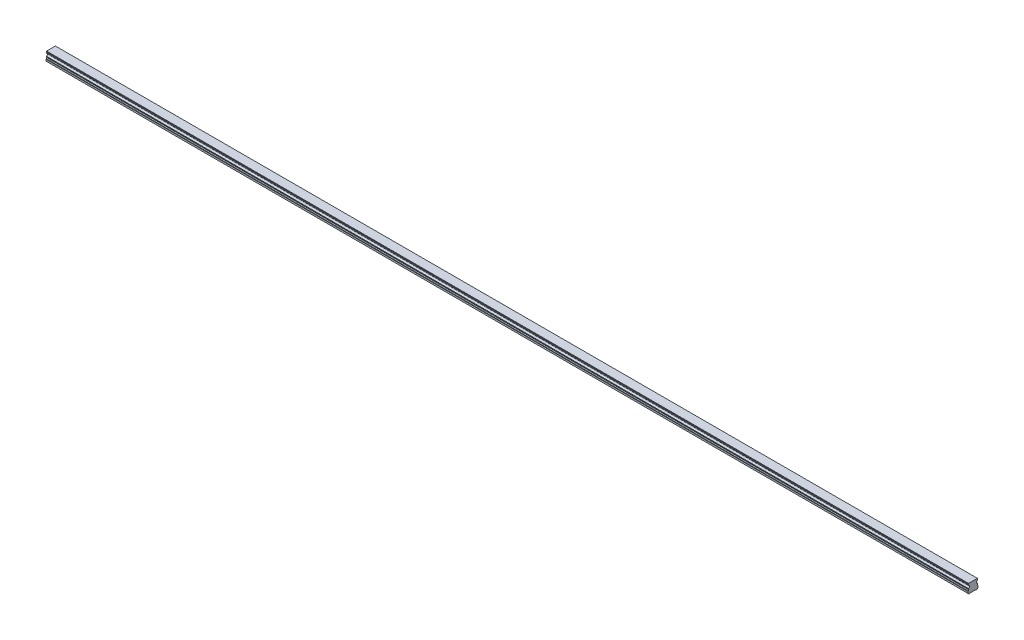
ISO-10303-21;
HEADER;
FILE_DESCRIPTION(('STEP AP214'),'2;1');
FILE_NAME('part.step','',(''),(''),'','','');
FILE_SCHEMA(('AUTOMOTIVE_DESIGN { 1 0 10303 214 1 1 1 1 }'));
ENDSEC;
DATA;
#1=APPLICATION_CONTEXT('core data for automotive mechanical design processes');
#2=APPLICATION_PROTOCOL_DEFINITION('international standard','automotive_design',2000,#1);
#3=PRODUCT_CONTEXT('',#1,'mechanical');
#4=PRODUCT('Part','Part','',(#3));
#5=PRODUCT_RELATED_PRODUCT_CATEGORY('part','',(#4));
#6=PRODUCT_DEFINITION_FORMATION('','',#4);
#7=PRODUCT_DEFINITION_CONTEXT('part definition',#1,'design');
#8=PRODUCT_DEFINITION('design','',#6,#7);
#9=PRODUCT_DEFINITION_SHAPE('','',#8);
#10=(LENGTH_UNIT() NAMED_UNIT(*) SI_UNIT(.MILLI.,.METRE.));
#11=(NAMED_UNIT(*) PLANE_ANGLE_UNIT() SI_UNIT($,.RADIAN.));
#12=(NAMED_UNIT(*) SI_UNIT($,.STERADIAN.) SOLID_ANGLE_UNIT());
#13=UNCERTAINTY_MEASURE_WITH_UNIT(LENGTH_MEASURE(1.E-05),#10,'distance_accuracy_value','');
#14=(GEOMETRIC_REPRESENTATION_CONTEXT(3) GLOBAL_UNCERTAINTY_ASSIGNED_CONTEXT((#13)) GLOBAL_UNIT_ASSIGNED_CONTEXT((#10,
#11,#12)) REPRESENTATION_CONTEXT('',''));
#15=CARTESIAN_POINT('',(0.,0.,0.));
#16=DIRECTION('',(0.,0.,1.));
#17=DIRECTION('',(1.,0.,0.));
#18=AXIS2_PLACEMENT_3D('',#15,#16,#17);
#19=CARTESIAN_POINT('',(1350.,0.399999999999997,0.));
#20=DIRECTION('',(0.,-1.,0.));
#21=DIRECTION('',(0.,0.,-1.));
#22=AXIS2_PLACEMENT_3D('',#19,#20,#21);
#23=CONICAL_SURFACE('',#22,2.90000000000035,0.785398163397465);
#24=CARTESIAN_POINT('',(1350.,0.800000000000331,0.));
#25=DIRECTION('',(0.,1.,0.));
#26=DIRECTION('',(0.,0.,1.));
#27=AXIS2_PLACEMENT_3D('',#24,#25,#26);
#28=CIRCLE('',#27,2.5);
#29=CARTESIAN_POINT('',(1350.,0.800000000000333,2.5));
#30=VERTEX_POINT('',#29);
#31=EDGE_CURVE('E11',#30,#30,#28,.F.);
#32=ORIENTED_EDGE('',*,*,#31,.F.);
#33=EDGE_LOOP('',(#32));
#34=FACE_BOUND('',#33,.T.);
#35=CARTESIAN_POINT('',(1350.,0.399999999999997,0.));
#36=DIRECTION('',(0.,1.,0.));
#37=DIRECTION('',(0.,0.,1.));
#38=AXIS2_PLACEMENT_3D('',#35,#36,#37);
#39=CIRCLE('',#38,2.90000000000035);
#40=CARTESIAN_POINT('',(1350.,0.399999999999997,2.90000000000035));
#41=VERTEX_POINT('',#40);
#42=EDGE_CURVE('E673',#41,#41,#39,.T.);
#43=ORIENTED_EDGE('',*,*,#42,.F.);
#44=EDGE_LOOP('',(#43));
#45=FACE_BOUND('',#44,.T.);
#46=ADVANCED_FACE('F39',(#34,#45),#23,.F.);
#47=CARTESIAN_POINT('',(1350.,7.,0.));
#48=DIRECTION('',(0.,-1.,0.));
#49=DIRECTION('',(0.,0.,-1.));
#50=AXIS2_PLACEMENT_3D('',#47,#48,#49);
#51=CYLINDRICAL_SURFACE('',#50,2.5);
#52=ORIENTED_EDGE('',*,*,#31,.T.);
#53=EDGE_LOOP('',(#52));
#54=FACE_BOUND('',#53,.T.);
#55=CARTESIAN_POINT('',(1350.,7.,0.));
#56=DIRECTION('',(0.,-1.,0.));
#57=DIRECTION('',(0.,0.,-1.));
#58=AXIS2_PLACEMENT_3D('',#55,#56,#57);
#59=CIRCLE('',#58,2.5);
#60=CARTESIAN_POINT('',(1350.,7.,-2.50000000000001));
#61=VERTEX_POINT('',#60);
#62=EDGE_CURVE('E49',#61,#61,#59,.T.);
#63=ORIENTED_EDGE('',*,*,#62,.F.);
#64=EDGE_LOOP('',(#63));
#65=FACE_BOUND('',#64,.T.);
#66=ADVANCED_FACE('F965',(#54,#65),#51,.F.);
#67=CARTESIAN_POINT('',(1350.,7.,0.));
#68=DIRECTION('',(0.,-1.,0.));
#69=DIRECTION('',(0.,0.,-1.));
#70=AXIS2_PLACEMENT_3D('',#67,#68,#69);
#71=PLANE('',#70);
#72=CARTESIAN_POINT('',(1350.,7.,0.));
#73=DIRECTION('',(0.,-1.,0.));
#74=DIRECTION('',(0.,0.,-1.));
#75=AXIS2_PLACEMENT_3D('',#72,#73,#74);
#76=CIRCLE('',#75,2.1);
#77=CARTESIAN_POINT('',(1350.,7.,-2.1));
#78=VERTEX_POINT('',#77);
#79=EDGE_CURVE('E42',#78,#78,#76,.T.);
#80=ORIENTED_EDGE('',*,*,#79,.F.);
#81=EDGE_LOOP('',(#80));
#82=FACE_BOUND('',#81,.T.);
#83=ORIENTED_EDGE('',*,*,#62,.T.);
#84=EDGE_LOOP('',(#83));
#85=FACE_BOUND('',#84,.T.);
#86=ADVANCED_FACE('F970',(#82,#85),#71,.T.);
#87=CARTESIAN_POINT('',(1290.,0.399999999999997,0.));
#88=DIRECTION('',(0.,-1.,0.));
#89=DIRECTION('',(0.,0.,-1.));
#90=AXIS2_PLACEMENT_3D('',#87,#88,#89);
#91=CONICAL_SURFACE('',#90,2.90000000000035,0.785398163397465);
#92=CARTESIAN_POINT('',(1290.,0.800000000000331,0.));
#93=DIRECTION('',(0.,1.,0.));
#94=DIRECTION('',(0.,0.,1.));
#95=AXIS2_PLACEMENT_3D('',#92,#93,#94);
#96=CIRCLE('',#95,2.5);
#97=CARTESIAN_POINT('',(1290.,0.800000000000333,2.5));
#98=VERTEX_POINT('',#97);
#99=EDGE_CURVE('E669',#98,#98,#96,.F.);
#100=ORIENTED_EDGE('',*,*,#99,.F.);
#101=EDGE_LOOP('',(#100));
#102=FACE_BOUND('',#101,.T.);
#103=CARTESIAN_POINT('',(1290.,0.399999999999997,0.));
#104=DIRECTION('',(0.,1.,0.));
#105=DIRECTION('',(0.,0.,1.));
#106=AXIS2_PLACEMENT_3D('',#103,#104,#105);
#107=CIRCLE('',#106,2.90000000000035);
#108=CARTESIAN_POINT('',(1290.,0.399999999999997,2.90000000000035));
#109=VERTEX_POINT('',#108);
#110=EDGE_CURVE('E661',#109,#109,#107,.T.);
#111=ORIENTED_EDGE('',*,*,#110,.F.);
#112=EDGE_LOOP('',(#111));
#113=FACE_BOUND('',#112,.T.);
#114=ADVANCED_FACE('F1285',(#102,#113),#91,.F.);
#115=CARTESIAN_POINT('',(1290.,7.,0.));
#116=DIRECTION('',(0.,-1.,0.));
#117=DIRECTION('',(0.,0.,-1.));
#118=AXIS2_PLACEMENT_3D('',#115,#116,#117);
#119=CYLINDRICAL_SURFACE('',#118,2.5);
#120=ORIENTED_EDGE('',*,*,#99,.T.);
#121=EDGE_LOOP('',(#120));
#122=FACE_BOUND('',#121,.T.);
#123=CARTESIAN_POINT('',(1290.,7.,0.));
#124=DIRECTION('',(0.,-1.,0.));
#125=DIRECTION('',(0.,0.,-1.));
#126=AXIS2_PLACEMENT_3D('',#123,#124,#125);
#127=CIRCLE('',#126,2.5);
#128=CARTESIAN_POINT('',(1290.,7.,-2.50000000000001));
#129=VERTEX_POINT('',#128);
#130=EDGE_CURVE('E665',#129,#129,#127,.T.);
#131=ORIENTED_EDGE('',*,*,#130,.F.);
#132=EDGE_LOOP('',(#131));
#133=FACE_BOUND('',#132,.T.);
#134=ADVANCED_FACE('F1281',(#122,#133),#119,.F.);
#135=CARTESIAN_POINT('',(1290.,7.,0.));
#136=DIRECTION('',(0.,-1.,0.));
#137=DIRECTION('',(0.,0.,-1.));
#138=AXIS2_PLACEMENT_3D('',#135,#136,#137);
#139=PLANE('',#138);
#140=CARTESIAN_POINT('',(1290.,7.,0.));
#141=DIRECTION('',(0.,-1.,0.));
#142=DIRECTION('',(0.,0.,-1.));
#143=AXIS2_PLACEMENT_3D('',#140,#141,#142);
#144=CIRCLE('',#143,2.1);
#145=CARTESIAN_POINT('',(1290.,7.,-2.1));
#146=VERTEX_POINT('',#145);
#147=EDGE_CURVE('E760',#146,#146,#144,.T.);
#148=ORIENTED_EDGE('',*,*,#147,.F.);
#149=EDGE_LOOP('',(#148));
#150=FACE_BOUND('',#149,.T.);
#151=ORIENTED_EDGE('',*,*,#130,.T.);
#152=EDGE_LOOP('',(#151));
#153=FACE_BOUND('',#152,.T.);
#154=ADVANCED_FACE('F1277',(#150,#153),#139,.T.);
#155=CARTESIAN_POINT('',(1230.,0.399999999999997,0.));
#156=DIRECTION('',(0.,-1.,0.));
#157=DIRECTION('',(0.,0.,-1.));
#158=AXIS2_PLACEMENT_3D('',#155,#156,#157);
#159=CONICAL_SURFACE('',#158,2.90000000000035,0.785398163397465);
#160=CARTESIAN_POINT('',(1230.,0.800000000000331,0.));
#161=DIRECTION('',(0.,1.,0.));
#162=DIRECTION('',(0.,0.,1.));
#163=AXIS2_PLACEMENT_3D('',#160,#161,#162);
#164=CIRCLE('',#163,2.5);
#165=CARTESIAN_POINT('',(1230.,0.800000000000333,2.5));
#166=VERTEX_POINT('',#165);
#167=EDGE_CURVE('E657',#166,#166,#164,.F.);
#168=ORIENTED_EDGE('',*,*,#167,.F.);
#169=EDGE_LOOP('',(#168));
#170=FACE_BOUND('',#169,.T.);
#171=CARTESIAN_POINT('',(1230.,0.399999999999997,0.));
#172=DIRECTION('',(0.,1.,0.));
#173=DIRECTION('',(0.,0.,1.));
#174=AXIS2_PLACEMENT_3D('',#171,#172,#173);
#175=CIRCLE('',#174,2.90000000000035);
#176=CARTESIAN_POINT('',(1230.,0.399999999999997,2.90000000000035));
#177=VERTEX_POINT('',#176);
#178=EDGE_CURVE('E649',#177,#177,#175,.T.);
#179=ORIENTED_EDGE('',*,*,#178,.F.);
#180=EDGE_LOOP('',(#179));
#181=FACE_BOUND('',#180,.T.);
#182=ADVANCED_FACE('F1273',(#170,#181),#159,.F.);
#183=CARTESIAN_POINT('',(1230.,7.,0.));
#184=DIRECTION('',(0.,-1.,0.));
#185=DIRECTION('',(0.,0.,-1.));
#186=AXIS2_PLACEMENT_3D('',#183,#184,#185);
#187=CYLINDRICAL_SURFACE('',#186,2.5);
#188=ORIENTED_EDGE('',*,*,#167,.T.);
#189=EDGE_LOOP('',(#188));
#190=FACE_BOUND('',#189,.T.);
#191=CARTESIAN_POINT('',(1230.,7.,0.));
#192=DIRECTION('',(0.,-1.,0.));
#193=DIRECTION('',(0.,0.,-1.));
#194=AXIS2_PLACEMENT_3D('',#191,#192,#193);
#195=CIRCLE('',#194,2.5);
#196=CARTESIAN_POINT('',(1230.,7.,-2.50000000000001));
#197=VERTEX_POINT('',#196);
#198=EDGE_CURVE('E653',#197,#197,#195,.T.);
#199=ORIENTED_EDGE('',*,*,#198,.F.);
#200=EDGE_LOOP('',(#199));
#201=FACE_BOUND('',#200,.T.);
#202=ADVANCED_FACE('F1269',(#190,#201),#187,.F.);
#203=CARTESIAN_POINT('',(1230.,7.,0.));
#204=DIRECTION('',(0.,-1.,0.));
#205=DIRECTION('',(0.,0.,-1.));
#206=AXIS2_PLACEMENT_3D('',#203,#204,#205);
#207=PLANE('',#206);
#208=CARTESIAN_POINT('',(1230.,7.,0.));
#209=DIRECTION('',(0.,-1.,0.));
#210=DIRECTION('',(0.,0.,-1.));
#211=AXIS2_PLACEMENT_3D('',#208,#209,#210);
#212=CIRCLE('',#211,2.1);
#213=CARTESIAN_POINT('',(1230.,7.,-2.1));
#214=VERTEX_POINT('',#213);
#215=EDGE_CURVE('E757',#214,#214,#212,.T.);
#216=ORIENTED_EDGE('',*,*,#215,.F.);
#217=EDGE_LOOP('',(#216));
#218=FACE_BOUND('',#217,.T.);
#219=ORIENTED_EDGE('',*,*,#198,.T.);
#220=EDGE_LOOP('',(#219));
#221=FACE_BOUND('',#220,.T.);
#222=ADVANCED_FACE('F1265',(#218,#221),#207,.T.);
#223=CARTESIAN_POINT('',(1170.,0.399999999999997,0.));
#224=DIRECTION('',(0.,-1.,0.));
#225=DIRECTION('',(0.,0.,-1.));
#226=AXIS2_PLACEMENT_3D('',#223,#224,#225);
#227=CONICAL_SURFACE('',#226,2.90000000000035,0.785398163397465);
#228=CARTESIAN_POINT('',(1170.,0.800000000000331,0.));
#229=DIRECTION('',(0.,1.,0.));
#230=DIRECTION('',(0.,0.,1.));
#231=AXIS2_PLACEMENT_3D('',#228,#229,#230);
#232=CIRCLE('',#231,2.5);
#233=CARTESIAN_POINT('',(1170.,0.800000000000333,2.5));
#234=VERTEX_POINT('',#233);
#235=EDGE_CURVE('E645',#234,#234,#232,.F.);
#236=ORIENTED_EDGE('',*,*,#235,.F.);
#237=EDGE_LOOP('',(#236));
#238=FACE_BOUND('',#237,.T.);
#239=CARTESIAN_POINT('',(1170.,0.399999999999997,0.));
#240=DIRECTION('',(0.,1.,0.));
#241=DIRECTION('',(0.,0.,1.));
#242=AXIS2_PLACEMENT_3D('',#239,#240,#241);
#243=CIRCLE('',#242,2.90000000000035);
#244=CARTESIAN_POINT('',(1170.,0.399999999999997,2.90000000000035));
#245=VERTEX_POINT('',#244);
#246=EDGE_CURVE('E637',#245,#245,#243,.T.);
#247=ORIENTED_EDGE('',*,*,#246,.F.);
#248=EDGE_LOOP('',(#247));
#249=FACE_BOUND('',#248,.T.);
#250=ADVANCED_FACE('F1261',(#238,#249),#227,.F.);
#251=CARTESIAN_POINT('',(1170.,7.,0.));
#252=DIRECTION('',(0.,-1.,0.));
#253=DIRECTION('',(0.,0.,-1.));
#254=AXIS2_PLACEMENT_3D('',#251,#252,#253);
#255=CYLINDRICAL_SURFACE('',#254,2.5);
#256=ORIENTED_EDGE('',*,*,#235,.T.);
#257=EDGE_LOOP('',(#256));
#258=FACE_BOUND('',#257,.T.);
#259=CARTESIAN_POINT('',(1170.,7.,0.));
#260=DIRECTION('',(0.,-1.,0.));
#261=DIRECTION('',(0.,0.,-1.));
#262=AXIS2_PLACEMENT_3D('',#259,#260,#261);
#263=CIRCLE('',#262,2.5);
#264=CARTESIAN_POINT('',(1170.,7.,-2.50000000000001));
#265=VERTEX_POINT('',#264);
#266=EDGE_CURVE('E641',#265,#265,#263,.T.);
#267=ORIENTED_EDGE('',*,*,#266,.F.);
#268=EDGE_LOOP('',(#267));
#269=FACE_BOUND('',#268,.T.);
#270=ADVANCED_FACE('F1257',(#258,#269),#255,.F.);
#271=CARTESIAN_POINT('',(1170.,7.,0.));
#272=DIRECTION('',(0.,-1.,0.));
#273=DIRECTION('',(0.,0.,-1.));
#274=AXIS2_PLACEMENT_3D('',#271,#272,#273);
#275=PLANE('',#274);
#276=CARTESIAN_POINT('',(1170.,7.,0.));
#277=DIRECTION('',(0.,-1.,0.));
#278=DIRECTION('',(0.,0.,-1.));
#279=AXIS2_PLACEMENT_3D('',#276,#277,#278);
#280=CIRCLE('',#279,2.1);
#281=CARTESIAN_POINT('',(1170.,7.,-2.1));
#282=VERTEX_POINT('',#281);
#283=EDGE_CURVE('E753',#282,#282,#280,.T.);
#284=ORIENTED_EDGE('',*,*,#283,.F.);
#285=EDGE_LOOP('',(#284));
#286=FACE_BOUND('',#285,.T.);
#287=ORIENTED_EDGE('',*,*,#266,.T.);
#288=EDGE_LOOP('',(#287));
#289=FACE_BOUND('',#288,.T.);
#290=ADVANCED_FACE('F1253',(#286,#289),#275,.T.);
#291=CARTESIAN_POINT('',(1110.,0.399999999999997,0.));
#292=DIRECTION('',(0.,-1.,0.));
#293=DIRECTION('',(0.,0.,-1.));
#294=AXIS2_PLACEMENT_3D('',#291,#292,#293);
#295=CONICAL_SURFACE('',#294,2.90000000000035,0.785398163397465);
#296=CARTESIAN_POINT('',(1110.,0.800000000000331,0.));
#297=DIRECTION('',(0.,1.,0.));
#298=DIRECTION('',(0.,0.,1.));
#299=AXIS2_PLACEMENT_3D('',#296,#297,#298);
#300=CIRCLE('',#299,2.5);
#301=CARTESIAN_POINT('',(1110.,0.800000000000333,2.5));
#302=VERTEX_POINT('',#301);
#303=EDGE_CURVE('E633',#302,#302,#300,.F.);
#304=ORIENTED_EDGE('',*,*,#303,.F.);
#305=EDGE_LOOP('',(#304));
#306=FACE_BOUND('',#305,.T.);
#307=CARTESIAN_POINT('',(1110.,0.399999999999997,0.));
#308=DIRECTION('',(0.,1.,0.));
#309=DIRECTION('',(0.,0.,1.));
#310=AXIS2_PLACEMENT_3D('',#307,#308,#309);
#311=CIRCLE('',#310,2.90000000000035);
#312=CARTESIAN_POINT('',(1110.,0.399999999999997,2.90000000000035));
#313=VERTEX_POINT('',#312);
#314=EDGE_CURVE('E625',#313,#313,#311,.T.);
#315=ORIENTED_EDGE('',*,*,#314,.F.);
#316=EDGE_LOOP('',(#315));
#317=FACE_BOUND('',#316,.T.);
#318=ADVANCED_FACE('F1249',(#306,#317),#295,.F.);
#319=CARTESIAN_POINT('',(1110.,7.,0.));
#320=DIRECTION('',(0.,-1.,0.));
#321=DIRECTION('',(0.,0.,-1.));
#322=AXIS2_PLACEMENT_3D('',#319,#320,#321);
#323=CYLINDRICAL_SURFACE('',#322,2.5);
#324=ORIENTED_EDGE('',*,*,#303,.T.);
#325=EDGE_LOOP('',(#324));
#326=FACE_BOUND('',#325,.T.);
#327=CARTESIAN_POINT('',(1110.,7.,0.));
#328=DIRECTION('',(0.,-1.,0.));
#329=DIRECTION('',(0.,0.,-1.));
#330=AXIS2_PLACEMENT_3D('',#327,#328,#329);
#331=CIRCLE('',#330,2.5);
#332=CARTESIAN_POINT('',(1110.,7.,-2.50000000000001));
#333=VERTEX_POINT('',#332);
#334=EDGE_CURVE('E629',#333,#333,#331,.T.);
#335=ORIENTED_EDGE('',*,*,#334,.F.);
#336=EDGE_LOOP('',(#335));
#337=FACE_BOUND('',#336,.T.);
#338=ADVANCED_FACE('F1245',(#326,#337),#323,.F.);
#339=CARTESIAN_POINT('',(1110.,7.,0.));
#340=DIRECTION('',(0.,-1.,0.));
#341=DIRECTION('',(0.,0.,-1.));
#342=AXIS2_PLACEMENT_3D('',#339,#340,#341);
#343=PLANE('',#342);
#344=CARTESIAN_POINT('',(1110.,7.,0.));
#345=DIRECTION('',(0.,-1.,0.));
#346=DIRECTION('',(0.,0.,-1.));
#347=AXIS2_PLACEMENT_3D('',#344,#345,#346);
#348=CIRCLE('',#347,2.1);
#349=CARTESIAN_POINT('',(1110.,7.,-2.1));
#350=VERTEX_POINT('',#349);
#351=EDGE_CURVE('E749',#350,#350,#348,.T.);
#352=ORIENTED_EDGE('',*,*,#351,.F.);
#353=EDGE_LOOP('',(#352));
#354=FACE_BOUND('',#353,.T.);
#355=ORIENTED_EDGE('',*,*,#334,.T.);
#356=EDGE_LOOP('',(#355));
#357=FACE_BOUND('',#356,.T.);
#358=ADVANCED_FACE('F1241',(#354,#357),#343,.T.);
#359=CARTESIAN_POINT('',(1050.,0.399999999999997,0.));
#360=DIRECTION('',(0.,-1.,0.));
#361=DIRECTION('',(0.,0.,-1.));
#362=AXIS2_PLACEMENT_3D('',#359,#360,#361);
#363=CONICAL_SURFACE('',#362,2.90000000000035,0.785398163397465);
#364=CARTESIAN_POINT('',(1050.,0.800000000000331,0.));
#365=DIRECTION('',(0.,1.,0.));
#366=DIRECTION('',(0.,0.,1.));
#367=AXIS2_PLACEMENT_3D('',#364,#365,#366);
#368=CIRCLE('',#367,2.5);
#369=CARTESIAN_POINT('',(1050.,0.800000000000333,2.5));
#370=VERTEX_POINT('',#369);
#371=EDGE_CURVE('E621',#370,#370,#368,.F.);
#372=ORIENTED_EDGE('',*,*,#371,.F.);
#373=EDGE_LOOP('',(#372));
#374=FACE_BOUND('',#373,.T.);
#375=CARTESIAN_POINT('',(1050.,0.399999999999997,0.));
#376=DIRECTION('',(0.,1.,0.));
#377=DIRECTION('',(0.,0.,1.));
#378=AXIS2_PLACEMENT_3D('',#375,#376,#377);
#379=CIRCLE('',#378,2.90000000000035);
#380=CARTESIAN_POINT('',(1050.,0.399999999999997,2.90000000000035));
#381=VERTEX_POINT('',#380);
#382=EDGE_CURVE('E613',#381,#381,#379,.T.);
#383=ORIENTED_EDGE('',*,*,#382,.F.);
#384=EDGE_LOOP('',(#383));
#385=FACE_BOUND('',#384,.T.);
#386=ADVANCED_FACE('F1237',(#374,#385),#363,.F.);
#387=CARTESIAN_POINT('',(1050.,7.,0.));
#388=DIRECTION('',(0.,-1.,0.));
#389=DIRECTION('',(0.,0.,-1.));
#390=AXIS2_PLACEMENT_3D('',#387,#388,#389);
#391=CYLINDRICAL_SURFACE('',#390,2.5);
#392=ORIENTED_EDGE('',*,*,#371,.T.);
#393=EDGE_LOOP('',(#392));
#394=FACE_BOUND('',#393,.T.);
#395=CARTESIAN_POINT('',(1050.,7.,0.));
#396=DIRECTION('',(0.,-1.,0.));
#397=DIRECTION('',(0.,0.,-1.));
#398=AXIS2_PLACEMENT_3D('',#395,#396,#397);
#399=CIRCLE('',#398,2.5);
#400=CARTESIAN_POINT('',(1050.,7.,-2.50000000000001));
#401=VERTEX_POINT('',#400);
#402=EDGE_CURVE('E617',#401,#401,#399,.T.);
#403=ORIENTED_EDGE('',*,*,#402,.F.);
#404=EDGE_LOOP('',(#403));
#405=FACE_BOUND('',#404,.T.);
#406=ADVANCED_FACE('F1233',(#394,#405),#391,.F.);
#407=CARTESIAN_POINT('',(1050.,7.,0.));
#408=DIRECTION('',(0.,-1.,0.));
#409=DIRECTION('',(0.,0.,-1.));
#410=AXIS2_PLACEMENT_3D('',#407,#408,#409);
#411=PLANE('',#410);
#412=CARTESIAN_POINT('',(1050.,7.,0.));
#413=DIRECTION('',(0.,-1.,0.));
#414=DIRECTION('',(0.,0.,-1.));
#415=AXIS2_PLACEMENT_3D('',#412,#413,#414);
#416=CIRCLE('',#415,2.1);
#417=CARTESIAN_POINT('',(1050.,7.,-2.1));
#418=VERTEX_POINT('',#417);
#419=EDGE_CURVE('E745',#418,#418,#416,.T.);
#420=ORIENTED_EDGE('',*,*,#419,.F.);
#421=EDGE_LOOP('',(#420));
#422=FACE_BOUND('',#421,.T.);
#423=ORIENTED_EDGE('',*,*,#402,.T.);
#424=EDGE_LOOP('',(#423));
#425=FACE_BOUND('',#424,.T.);
#426=ADVANCED_FACE('F1229',(#422,#425),#411,.T.);
#427=CARTESIAN_POINT('',(990.,0.399999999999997,0.));
#428=DIRECTION('',(0.,-1.,0.));
#429=DIRECTION('',(0.,0.,-1.));
#430=AXIS2_PLACEMENT_3D('',#427,#428,#429);
#431=CONICAL_SURFACE('',#430,2.90000000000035,0.785398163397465);
#432=CARTESIAN_POINT('',(990.,0.800000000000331,0.));
#433=DIRECTION('',(0.,1.,0.));
#434=DIRECTION('',(0.,0.,1.));
#435=AXIS2_PLACEMENT_3D('',#432,#433,#434);
#436=CIRCLE('',#435,2.5);
#437=CARTESIAN_POINT('',(990.,0.800000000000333,2.5));
#438=VERTEX_POINT('',#437);
#439=EDGE_CURVE('E609',#438,#438,#436,.F.);
#440=ORIENTED_EDGE('',*,*,#439,.F.);
#441=EDGE_LOOP('',(#440));
#442=FACE_BOUND('',#441,.T.);
#443=CARTESIAN_POINT('',(990.,0.399999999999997,0.));
#444=DIRECTION('',(0.,1.,0.));
#445=DIRECTION('',(0.,0.,1.));
#446=AXIS2_PLACEMENT_3D('',#443,#444,#445);
#447=CIRCLE('',#446,2.90000000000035);
#448=CARTESIAN_POINT('',(990.,0.399999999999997,2.90000000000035));
#449=VERTEX_POINT('',#448);
#450=EDGE_CURVE('E601',#449,#449,#447,.T.);
#451=ORIENTED_EDGE('',*,*,#450,.F.);
#452=EDGE_LOOP('',(#451));
#453=FACE_BOUND('',#452,.T.);
#454=ADVANCED_FACE('F1225',(#442,#453),#431,.F.);
#455=CARTESIAN_POINT('',(990.,7.,0.));
#456=DIRECTION('',(0.,-1.,0.));
#457=DIRECTION('',(0.,0.,-1.));
#458=AXIS2_PLACEMENT_3D('',#455,#456,#457);
#459=CYLINDRICAL_SURFACE('',#458,2.5);
#460=ORIENTED_EDGE('',*,*,#439,.T.);
#461=EDGE_LOOP('',(#460));
#462=FACE_BOUND('',#461,.T.);
#463=CARTESIAN_POINT('',(990.,7.,0.));
#464=DIRECTION('',(0.,-1.,0.));
#465=DIRECTION('',(0.,0.,-1.));
#466=AXIS2_PLACEMENT_3D('',#463,#464,#465);
#467=CIRCLE('',#466,2.5);
#468=CARTESIAN_POINT('',(990.,7.,-2.50000000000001));
#469=VERTEX_POINT('',#468);
#470=EDGE_CURVE('E605',#469,#469,#467,.T.);
#471=ORIENTED_EDGE('',*,*,#470,.F.);
#472=EDGE_LOOP('',(#471));
#473=FACE_BOUND('',#472,.T.);
#474=ADVANCED_FACE('F1221',(#462,#473),#459,.F.);
#475=CARTESIAN_POINT('',(990.,7.,0.));
#476=DIRECTION('',(0.,-1.,0.));
#477=DIRECTION('',(0.,0.,-1.));
#478=AXIS2_PLACEMENT_3D('',#475,#476,#477);
#479=PLANE('',#478);
#480=CARTESIAN_POINT('',(990.,7.,0.));
#481=DIRECTION('',(0.,-1.,0.));
#482=DIRECTION('',(0.,0.,-1.));
#483=AXIS2_PLACEMENT_3D('',#480,#481,#482);
#484=CIRCLE('',#483,2.1);
#485=CARTESIAN_POINT('',(990.,7.,-2.1));
#486=VERTEX_POINT('',#485);
#487=EDGE_CURVE('E741',#486,#486,#484,.T.);
#488=ORIENTED_EDGE('',*,*,#487,.F.);
#489=EDGE_LOOP('',(#488));
#490=FACE_BOUND('',#489,.T.);
#491=ORIENTED_EDGE('',*,*,#470,.T.);
#492=EDGE_LOOP('',(#491));
#493=FACE_BOUND('',#492,.T.);
#494=ADVANCED_FACE('F1217',(#490,#493),#479,.T.);
#495=CARTESIAN_POINT('',(930.,0.399999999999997,0.));
#496=DIRECTION('',(0.,-1.,0.));
#497=DIRECTION('',(0.,0.,-1.));
#498=AXIS2_PLACEMENT_3D('',#495,#496,#497);
#499=CONICAL_SURFACE('',#498,2.90000000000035,0.785398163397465);
#500=CARTESIAN_POINT('',(930.,0.800000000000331,0.));
#501=DIRECTION('',(0.,1.,0.));
#502=DIRECTION('',(0.,0.,1.));
#503=AXIS2_PLACEMENT_3D('',#500,#501,#502);
#504=CIRCLE('',#503,2.5);
#505=CARTESIAN_POINT('',(930.,0.800000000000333,2.5));
#506=VERTEX_POINT('',#505);
#507=EDGE_CURVE('E597',#506,#506,#504,.F.);
#508=ORIENTED_EDGE('',*,*,#507,.F.);
#509=EDGE_LOOP('',(#508));
#510=FACE_BOUND('',#509,.T.);
#511=CARTESIAN_POINT('',(930.,0.399999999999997,0.));
#512=DIRECTION('',(0.,1.,0.));
#513=DIRECTION('',(0.,0.,1.));
#514=AXIS2_PLACEMENT_3D('',#511,#512,#513);
#515=CIRCLE('',#514,2.90000000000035);
#516=CARTESIAN_POINT('',(930.,0.399999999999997,2.90000000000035));
#517=VERTEX_POINT('',#516);
#518=EDGE_CURVE('E589',#517,#517,#515,.T.);
#519=ORIENTED_EDGE('',*,*,#518,.F.);
#520=EDGE_LOOP('',(#519));
#521=FACE_BOUND('',#520,.T.);
#522=ADVANCED_FACE('F1213',(#510,#521),#499,.F.);
#523=CARTESIAN_POINT('',(930.,7.,0.));
#524=DIRECTION('',(0.,-1.,0.));
#525=DIRECTION('',(0.,0.,-1.));
#526=AXIS2_PLACEMENT_3D('',#523,#524,#525);
#527=CYLINDRICAL_SURFACE('',#526,2.5);
#528=ORIENTED_EDGE('',*,*,#507,.T.);
#529=EDGE_LOOP('',(#528));
#530=FACE_BOUND('',#529,.T.);
#531=CARTESIAN_POINT('',(930.,7.,0.));
#532=DIRECTION('',(0.,-1.,0.));
#533=DIRECTION('',(0.,0.,-1.));
#534=AXIS2_PLACEMENT_3D('',#531,#532,#533);
#535=CIRCLE('',#534,2.5);
#536=CARTESIAN_POINT('',(930.,7.,-2.50000000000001));
#537=VERTEX_POINT('',#536);
#538=EDGE_CURVE('E593',#537,#537,#535,.T.);
#539=ORIENTED_EDGE('',*,*,#538,.F.);
#540=EDGE_LOOP('',(#539));
#541=FACE_BOUND('',#540,.T.);
#542=ADVANCED_FACE('F1209',(#530,#541),#527,.F.);
#543=CARTESIAN_POINT('',(930.,7.,0.));
#544=DIRECTION('',(0.,-1.,0.));
#545=DIRECTION('',(0.,0.,-1.));
#546=AXIS2_PLACEMENT_3D('',#543,#544,#545);
#547=PLANE('',#546);
#548=CARTESIAN_POINT('',(930.,7.,0.));
#549=DIRECTION('',(0.,-1.,0.));
#550=DIRECTION('',(0.,0.,-1.));
#551=AXIS2_PLACEMENT_3D('',#548,#549,#550);
#552=CIRCLE('',#551,2.1);
#553=CARTESIAN_POINT('',(930.,7.,-2.1));
#554=VERTEX_POINT('',#553);
#555=EDGE_CURVE('E737',#554,#554,#552,.T.);
#556=ORIENTED_EDGE('',*,*,#555,.F.);
#557=EDGE_LOOP('',(#556));
#558=FACE_BOUND('',#557,.T.);
#559=ORIENTED_EDGE('',*,*,#538,.T.);
#560=EDGE_LOOP('',(#559));
#561=FACE_BOUND('',#560,.T.);
#562=ADVANCED_FACE('F1205',(#558,#561),#547,.T.);
#563=CARTESIAN_POINT('',(870.,0.399999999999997,0.));
#564=DIRECTION('',(0.,-1.,0.));
#565=DIRECTION('',(0.,0.,-1.));
#566=AXIS2_PLACEMENT_3D('',#563,#564,#565);
#567=CONICAL_SURFACE('',#566,2.90000000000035,0.785398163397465);
#568=CARTESIAN_POINT('',(870.,0.800000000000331,0.));
#569=DIRECTION('',(0.,1.,0.));
#570=DIRECTION('',(0.,0.,1.));
#571=AXIS2_PLACEMENT_3D('',#568,#569,#570);
#572=CIRCLE('',#571,2.5);
#573=CARTESIAN_POINT('',(870.,0.800000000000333,2.5));
#574=VERTEX_POINT('',#573);
#575=EDGE_CURVE('E585',#574,#574,#572,.F.);
#576=ORIENTED_EDGE('',*,*,#575,.F.);
#577=EDGE_LOOP('',(#576));
#578=FACE_BOUND('',#577,.T.);
#579=CARTESIAN_POINT('',(870.,0.399999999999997,0.));
#580=DIRECTION('',(0.,1.,0.));
#581=DIRECTION('',(0.,0.,1.));
#582=AXIS2_PLACEMENT_3D('',#579,#580,#581);
#583=CIRCLE('',#582,2.90000000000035);
#584=CARTESIAN_POINT('',(870.,0.399999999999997,2.90000000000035));
#585=VERTEX_POINT('',#584);
#586=EDGE_CURVE('E577',#585,#585,#583,.T.);
#587=ORIENTED_EDGE('',*,*,#586,.F.);
#588=EDGE_LOOP('',(#587));
#589=FACE_BOUND('',#588,.T.);
#590=ADVANCED_FACE('F1201',(#578,#589),#567,.F.);
#591=CARTESIAN_POINT('',(870.,7.,0.));
#592=DIRECTION('',(0.,-1.,0.));
#593=DIRECTION('',(0.,0.,-1.));
#594=AXIS2_PLACEMENT_3D('',#591,#592,#593);
#595=CYLINDRICAL_SURFACE('',#594,2.5);
#596=ORIENTED_EDGE('',*,*,#575,.T.);
#597=EDGE_LOOP('',(#596));
#598=FACE_BOUND('',#597,.T.);
#599=CARTESIAN_POINT('',(870.,7.,0.));
#600=DIRECTION('',(0.,-1.,0.));
#601=DIRECTION('',(0.,0.,-1.));
#602=AXIS2_PLACEMENT_3D('',#599,#600,#601);
#603=CIRCLE('',#602,2.5);
#604=CARTESIAN_POINT('',(870.,7.,-2.50000000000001));
#605=VERTEX_POINT('',#604);
#606=EDGE_CURVE('E581',#605,#605,#603,.T.);
#607=ORIENTED_EDGE('',*,*,#606,.F.);
#608=EDGE_LOOP('',(#607));
#609=FACE_BOUND('',#608,.T.);
#610=ADVANCED_FACE('F1197',(#598,#609),#595,.F.);
#611=CARTESIAN_POINT('',(870.,7.,0.));
#612=DIRECTION('',(0.,-1.,0.));
#613=DIRECTION('',(0.,0.,-1.));
#614=AXIS2_PLACEMENT_3D('',#611,#612,#613);
#615=PLANE('',#614);
#616=CARTESIAN_POINT('',(870.,7.,0.));
#617=DIRECTION('',(0.,-1.,0.));
#618=DIRECTION('',(0.,0.,-1.));
#619=AXIS2_PLACEMENT_3D('',#616,#617,#618);
#620=CIRCLE('',#619,2.1);
#621=CARTESIAN_POINT('',(870.,7.,-2.1));
#622=VERTEX_POINT('',#621);
#623=EDGE_CURVE('E733',#622,#622,#620,.T.);
#624=ORIENTED_EDGE('',*,*,#623,.F.);
#625=EDGE_LOOP('',(#624));
#626=FACE_BOUND('',#625,.T.);
#627=ORIENTED_EDGE('',*,*,#606,.T.);
#628=EDGE_LOOP('',(#627));
#629=FACE_BOUND('',#628,.T.);
#630=ADVANCED_FACE('F1193',(#626,#629),#615,.T.);
#631=CARTESIAN_POINT('',(810.,0.399999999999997,0.));
#632=DIRECTION('',(0.,-1.,0.));
#633=DIRECTION('',(0.,0.,-1.));
#634=AXIS2_PLACEMENT_3D('',#631,#632,#633);
#635=CONICAL_SURFACE('',#634,2.90000000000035,0.785398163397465);
#636=CARTESIAN_POINT('',(810.,0.800000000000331,0.));
#637=DIRECTION('',(0.,1.,0.));
#638=DIRECTION('',(0.,0.,1.));
#639=AXIS2_PLACEMENT_3D('',#636,#637,#638);
#640=CIRCLE('',#639,2.5);
#641=CARTESIAN_POINT('',(810.,0.800000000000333,2.5));
#642=VERTEX_POINT('',#641);
#643=EDGE_CURVE('E573',#642,#642,#640,.F.);
#644=ORIENTED_EDGE('',*,*,#643,.F.);
#645=EDGE_LOOP('',(#644));
#646=FACE_BOUND('',#645,.T.);
#647=CARTESIAN_POINT('',(810.,0.399999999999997,0.));
#648=DIRECTION('',(0.,1.,0.));
#649=DIRECTION('',(0.,0.,1.));
#650=AXIS2_PLACEMENT_3D('',#647,#648,#649);
#651=CIRCLE('',#650,2.90000000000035);
#652=CARTESIAN_POINT('',(810.,0.399999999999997,2.90000000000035));
#653=VERTEX_POINT('',#652);
#654=EDGE_CURVE('E565',#653,#653,#651,.T.);
#655=ORIENTED_EDGE('',*,*,#654,.F.);
#656=EDGE_LOOP('',(#655));
#657=FACE_BOUND('',#656,.T.);
#658=ADVANCED_FACE('F1189',(#646,#657),#635,.F.);
#659=CARTESIAN_POINT('',(810.,7.,0.));
#660=DIRECTION('',(0.,-1.,0.));
#661=DIRECTION('',(0.,0.,-1.));
#662=AXIS2_PLACEMENT_3D('',#659,#660,#661);
#663=CYLINDRICAL_SURFACE('',#662,2.5);
#664=ORIENTED_EDGE('',*,*,#643,.T.);
#665=EDGE_LOOP('',(#664));
#666=FACE_BOUND('',#665,.T.);
#667=CARTESIAN_POINT('',(810.,7.,0.));
#668=DIRECTION('',(0.,-1.,0.));
#669=DIRECTION('',(0.,0.,-1.));
#670=AXIS2_PLACEMENT_3D('',#667,#668,#669);
#671=CIRCLE('',#670,2.5);
#672=CARTESIAN_POINT('',(810.,7.,-2.50000000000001));
#673=VERTEX_POINT('',#672);
#674=EDGE_CURVE('E569',#673,#673,#671,.T.);
#675=ORIENTED_EDGE('',*,*,#674,.F.);
#676=EDGE_LOOP('',(#675));
#677=FACE_BOUND('',#676,.T.);
#678=ADVANCED_FACE('F1185',(#666,#677),#663,.F.);
#679=CARTESIAN_POINT('',(810.,7.,0.));
#680=DIRECTION('',(0.,-1.,0.));
#681=DIRECTION('',(0.,0.,-1.));
#682=AXIS2_PLACEMENT_3D('',#679,#680,#681);
#683=PLANE('',#682);
#684=CARTESIAN_POINT('',(810.,7.,0.));
#685=DIRECTION('',(0.,-1.,0.));
#686=DIRECTION('',(0.,0.,-1.));
#687=AXIS2_PLACEMENT_3D('',#684,#685,#686);
#688=CIRCLE('',#687,2.1);
#689=CARTESIAN_POINT('',(810.,7.,-2.1));
#690=VERTEX_POINT('',#689);
#691=EDGE_CURVE('E729',#690,#690,#688,.T.);
#692=ORIENTED_EDGE('',*,*,#691,.F.);
#693=EDGE_LOOP('',(#692));
#694=FACE_BOUND('',#693,.T.);
#695=ORIENTED_EDGE('',*,*,#674,.T.);
#696=EDGE_LOOP('',(#695));
#697=FACE_BOUND('',#696,.T.);
#698=ADVANCED_FACE('F1181',(#694,#697),#683,.T.);
#699=CARTESIAN_POINT('',(750.,0.399999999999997,0.));
#700=DIRECTION('',(0.,-1.,0.));
#701=DIRECTION('',(0.,0.,-1.));
#702=AXIS2_PLACEMENT_3D('',#699,#700,#701);
#703=CONICAL_SURFACE('',#702,2.90000000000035,0.785398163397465);
#704=CARTESIAN_POINT('',(750.,0.800000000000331,0.));
#705=DIRECTION('',(0.,1.,0.));
#706=DIRECTION('',(0.,0.,1.));
#707=AXIS2_PLACEMENT_3D('',#704,#705,#706);
#708=CIRCLE('',#707,2.5);
#709=CARTESIAN_POINT('',(750.,0.800000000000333,2.5));
#710=VERTEX_POINT('',#709);
#711=EDGE_CURVE('E561',#710,#710,#708,.F.);
#712=ORIENTED_EDGE('',*,*,#711,.F.);
#713=EDGE_LOOP('',(#712));
#714=FACE_BOUND('',#713,.T.);
#715=CARTESIAN_POINT('',(750.,0.399999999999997,0.));
#716=DIRECTION('',(0.,1.,0.));
#717=DIRECTION('',(0.,0.,1.));
#718=AXIS2_PLACEMENT_3D('',#715,#716,#717);
#719=CIRCLE('',#718,2.90000000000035);
#720=CARTESIAN_POINT('',(750.,0.399999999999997,2.90000000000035));
#721=VERTEX_POINT('',#720);
#722=EDGE_CURVE('E553',#721,#721,#719,.T.);
#723=ORIENTED_EDGE('',*,*,#722,.F.);
#724=EDGE_LOOP('',(#723));
#725=FACE_BOUND('',#724,.T.);
#726=ADVANCED_FACE('F1177',(#714,#725),#703,.F.);
#727=CARTESIAN_POINT('',(750.,7.,0.));
#728=DIRECTION('',(0.,-1.,0.));
#729=DIRECTION('',(0.,0.,-1.));
#730=AXIS2_PLACEMENT_3D('',#727,#728,#729);
#731=CYLINDRICAL_SURFACE('',#730,2.5);
#732=ORIENTED_EDGE('',*,*,#711,.T.);
#733=EDGE_LOOP('',(#732));
#734=FACE_BOUND('',#733,.T.);
#735=CARTESIAN_POINT('',(750.,7.,0.));
#736=DIRECTION('',(0.,-1.,0.));
#737=DIRECTION('',(0.,0.,-1.));
#738=AXIS2_PLACEMENT_3D('',#735,#736,#737);
#739=CIRCLE('',#738,2.5);
#740=CARTESIAN_POINT('',(750.,7.,-2.50000000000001));
#741=VERTEX_POINT('',#740);
#742=EDGE_CURVE('E557',#741,#741,#739,.T.);
#743=ORIENTED_EDGE('',*,*,#742,.F.);
#744=EDGE_LOOP('',(#743));
#745=FACE_BOUND('',#744,.T.);
#746=ADVANCED_FACE('F1173',(#734,#745),#731,.F.);
#747=CARTESIAN_POINT('',(750.,7.,0.));
#748=DIRECTION('',(0.,-1.,0.));
#749=DIRECTION('',(0.,0.,-1.));
#750=AXIS2_PLACEMENT_3D('',#747,#748,#749);
#751=PLANE('',#750);
#752=CARTESIAN_POINT('',(750.,7.,0.));
#753=DIRECTION('',(0.,-1.,0.));
#754=DIRECTION('',(0.,0.,-1.));
#755=AXIS2_PLACEMENT_3D('',#752,#753,#754);
#756=CIRCLE('',#755,2.1);
#757=CARTESIAN_POINT('',(750.,7.,-2.1));
#758=VERTEX_POINT('',#757);
#759=EDGE_CURVE('E725',#758,#758,#756,.T.);
#760=ORIENTED_EDGE('',*,*,#759,.F.);
#761=EDGE_LOOP('',(#760));
#762=FACE_BOUND('',#761,.T.);
#763=ORIENTED_EDGE('',*,*,#742,.T.);
#764=EDGE_LOOP('',(#763));
#765=FACE_BOUND('',#764,.T.);
#766=ADVANCED_FACE('F1169',(#762,#765),#751,.T.);
#767=CARTESIAN_POINT('',(690.,0.399999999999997,0.));
#768=DIRECTION('',(0.,-1.,0.));
#769=DIRECTION('',(0.,0.,-1.));
#770=AXIS2_PLACEMENT_3D('',#767,#768,#769);
#771=CONICAL_SURFACE('',#770,2.90000000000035,0.785398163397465);
#772=CARTESIAN_POINT('',(690.,0.800000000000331,0.));
#773=DIRECTION('',(0.,1.,0.));
#774=DIRECTION('',(0.,0.,1.));
#775=AXIS2_PLACEMENT_3D('',#772,#773,#774);
#776=CIRCLE('',#775,2.5);
#777=CARTESIAN_POINT('',(690.,0.800000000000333,2.5));
#778=VERTEX_POINT('',#777);
#779=EDGE_CURVE('E549',#778,#778,#776,.F.);
#780=ORIENTED_EDGE('',*,*,#779,.F.);
#781=EDGE_LOOP('',(#780));
#782=FACE_BOUND('',#781,.T.);
#783=CARTESIAN_POINT('',(690.,0.399999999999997,0.));
#784=DIRECTION('',(0.,1.,0.));
#785=DIRECTION('',(0.,0.,1.));
#786=AXIS2_PLACEMENT_3D('',#783,#784,#785);
#787=CIRCLE('',#786,2.90000000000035);
#788=CARTESIAN_POINT('',(690.,0.399999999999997,2.90000000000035));
#789=VERTEX_POINT('',#788);
#790=EDGE_CURVE('E541',#789,#789,#787,.T.);
#791=ORIENTED_EDGE('',*,*,#790,.F.);
#792=EDGE_LOOP('',(#791));
#793=FACE_BOUND('',#792,.T.);
#794=ADVANCED_FACE('F1165',(#782,#793),#771,.F.);
#795=CARTESIAN_POINT('',(690.,7.,0.));
#796=DIRECTION('',(0.,-1.,0.));
#797=DIRECTION('',(0.,0.,-1.));
#798=AXIS2_PLACEMENT_3D('',#795,#796,#797);
#799=CYLINDRICAL_SURFACE('',#798,2.5);
#800=ORIENTED_EDGE('',*,*,#779,.T.);
#801=EDGE_LOOP('',(#800));
#802=FACE_BOUND('',#801,.T.);
#803=CARTESIAN_POINT('',(690.,7.,0.));
#804=DIRECTION('',(0.,-1.,0.));
#805=DIRECTION('',(0.,0.,-1.));
#806=AXIS2_PLACEMENT_3D('',#803,#804,#805);
#807=CIRCLE('',#806,2.5);
#808=CARTESIAN_POINT('',(690.,7.,-2.50000000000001));
#809=VERTEX_POINT('',#808);
#810=EDGE_CURVE('E545',#809,#809,#807,.T.);
#811=ORIENTED_EDGE('',*,*,#810,.F.);
#812=EDGE_LOOP('',(#811));
#813=FACE_BOUND('',#812,.T.);
#814=ADVANCED_FACE('F1161',(#802,#813),#799,.F.);
#815=CARTESIAN_POINT('',(690.,7.,0.));
#816=DIRECTION('',(0.,-1.,0.));
#817=DIRECTION('',(0.,0.,-1.));
#818=AXIS2_PLACEMENT_3D('',#815,#816,#817);
#819=PLANE('',#818);
#820=CARTESIAN_POINT('',(690.,7.,0.));
#821=DIRECTION('',(0.,-1.,0.));
#822=DIRECTION('',(0.,0.,-1.));
#823=AXIS2_PLACEMENT_3D('',#820,#821,#822);
#824=CIRCLE('',#823,2.1);
#825=CARTESIAN_POINT('',(690.,7.,-2.1));
#826=VERTEX_POINT('',#825);
#827=EDGE_CURVE('E721',#826,#826,#824,.T.);
#828=ORIENTED_EDGE('',*,*,#827,.F.);
#829=EDGE_LOOP('',(#828));
#830=FACE_BOUND('',#829,.T.);
#831=ORIENTED_EDGE('',*,*,#810,.T.);
#832=EDGE_LOOP('',(#831));
#833=FACE_BOUND('',#832,.T.);
#834=ADVANCED_FACE('F1157',(#830,#833),#819,.T.);
#835=CARTESIAN_POINT('',(630.,0.399999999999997,0.));
#836=DIRECTION('',(0.,-1.,0.));
#837=DIRECTION('',(0.,0.,-1.));
#838=AXIS2_PLACEMENT_3D('',#835,#836,#837);
#839=CONICAL_SURFACE('',#838,2.90000000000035,0.785398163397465);
#840=CARTESIAN_POINT('',(630.,0.800000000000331,0.));
#841=DIRECTION('',(0.,1.,0.));
#842=DIRECTION('',(0.,0.,1.));
#843=AXIS2_PLACEMENT_3D('',#840,#841,#842);
#844=CIRCLE('',#843,2.5);
#845=CARTESIAN_POINT('',(630.,0.800000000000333,2.5));
#846=VERTEX_POINT('',#845);
#847=EDGE_CURVE('E537',#846,#846,#844,.F.);
#848=ORIENTED_EDGE('',*,*,#847,.F.);
#849=EDGE_LOOP('',(#848));
#850=FACE_BOUND('',#849,.T.);
#851=CARTESIAN_POINT('',(630.,0.399999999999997,0.));
#852=DIRECTION('',(0.,1.,0.));
#853=DIRECTION('',(0.,0.,1.));
#854=AXIS2_PLACEMENT_3D('',#851,#852,#853);
#855=CIRCLE('',#854,2.90000000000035);
#856=CARTESIAN_POINT('',(630.,0.399999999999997,2.90000000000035));
#857=VERTEX_POINT('',#856);
#858=EDGE_CURVE('E529',#857,#857,#855,.T.);
#859=ORIENTED_EDGE('',*,*,#858,.F.);
#860=EDGE_LOOP('',(#859));
#861=FACE_BOUND('',#860,.T.);
#862=ADVANCED_FACE('F1153',(#850,#861),#839,.F.);
#863=CARTESIAN_POINT('',(630.,7.,0.));
#864=DIRECTION('',(0.,-1.,0.));
#865=DIRECTION('',(0.,0.,-1.));
#866=AXIS2_PLACEMENT_3D('',#863,#864,#865);
#867=CYLINDRICAL_SURFACE('',#866,2.5);
#868=ORIENTED_EDGE('',*,*,#847,.T.);
#869=EDGE_LOOP('',(#868));
#870=FACE_BOUND('',#869,.T.);
#871=CARTESIAN_POINT('',(630.,7.,0.));
#872=DIRECTION('',(0.,-1.,0.));
#873=DIRECTION('',(0.,0.,-1.));
#874=AXIS2_PLACEMENT_3D('',#871,#872,#873);
#875=CIRCLE('',#874,2.5);
#876=CARTESIAN_POINT('',(630.,7.,-2.50000000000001));
#877=VERTEX_POINT('',#876);
#878=EDGE_CURVE('E533',#877,#877,#875,.T.);
#879=ORIENTED_EDGE('',*,*,#878,.F.);
#880=EDGE_LOOP('',(#879));
#881=FACE_BOUND('',#880,.T.);
#882=ADVANCED_FACE('F1149',(#870,#881),#867,.F.);
#883=CARTESIAN_POINT('',(630.,7.,0.));
#884=DIRECTION('',(0.,-1.,0.));
#885=DIRECTION('',(0.,0.,-1.));
#886=AXIS2_PLACEMENT_3D('',#883,#884,#885);
#887=PLANE('',#886);
#888=CARTESIAN_POINT('',(630.,7.,0.));
#889=DIRECTION('',(0.,-1.,0.));
#890=DIRECTION('',(0.,0.,-1.));
#891=AXIS2_PLACEMENT_3D('',#888,#889,#890);
#892=CIRCLE('',#891,2.1);
#893=CARTESIAN_POINT('',(630.,7.,-2.1));
#894=VERTEX_POINT('',#893);
#895=EDGE_CURVE('E717',#894,#894,#892,.T.);
#896=ORIENTED_EDGE('',*,*,#895,.F.);
#897=EDGE_LOOP('',(#896));
#898=FACE_BOUND('',#897,.T.);
#899=ORIENTED_EDGE('',*,*,#878,.T.);
#900=EDGE_LOOP('',(#899));
#901=FACE_BOUND('',#900,.T.);
#902=ADVANCED_FACE('F1145',(#898,#901),#887,.T.);
#903=CARTESIAN_POINT('',(570.,0.399999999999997,0.));
#904=DIRECTION('',(0.,-1.,0.));
#905=DIRECTION('',(0.,0.,-1.));
#906=AXIS2_PLACEMENT_3D('',#903,#904,#905);
#907=CONICAL_SURFACE('',#906,2.90000000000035,0.785398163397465);
#908=CARTESIAN_POINT('',(570.,0.800000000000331,0.));
#909=DIRECTION('',(0.,1.,0.));
#910=DIRECTION('',(0.,0.,1.));
#911=AXIS2_PLACEMENT_3D('',#908,#909,#910);
#912=CIRCLE('',#911,2.5);
#913=CARTESIAN_POINT('',(570.,0.800000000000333,2.5));
#914=VERTEX_POINT('',#913);
#915=EDGE_CURVE('E525',#914,#914,#912,.F.);
#916=ORIENTED_EDGE('',*,*,#915,.F.);
#917=EDGE_LOOP('',(#916));
#918=FACE_BOUND('',#917,.T.);
#919=CARTESIAN_POINT('',(570.,0.399999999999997,0.));
#920=DIRECTION('',(0.,1.,0.));
#921=DIRECTION('',(0.,0.,1.));
#922=AXIS2_PLACEMENT_3D('',#919,#920,#921);
#923=CIRCLE('',#922,2.90000000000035);
#924=CARTESIAN_POINT('',(570.,0.399999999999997,2.90000000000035));
#925=VERTEX_POINT('',#924);
#926=EDGE_CURVE('E517',#925,#925,#923,.T.);
#927=ORIENTED_EDGE('',*,*,#926,.F.);
#928=EDGE_LOOP('',(#927));
#929=FACE_BOUND('',#928,.T.);
#930=ADVANCED_FACE('F1141',(#918,#929),#907,.F.);
#931=CARTESIAN_POINT('',(570.,7.,0.));
#932=DIRECTION('',(0.,-1.,0.));
#933=DIRECTION('',(0.,0.,-1.));
#934=AXIS2_PLACEMENT_3D('',#931,#932,#933);
#935=CYLINDRICAL_SURFACE('',#934,2.5);
#936=ORIENTED_EDGE('',*,*,#915,.T.);
#937=EDGE_LOOP('',(#936));
#938=FACE_BOUND('',#937,.T.);
#939=CARTESIAN_POINT('',(570.,7.,0.));
#940=DIRECTION('',(0.,-1.,0.));
#941=DIRECTION('',(0.,0.,-1.));
#942=AXIS2_PLACEMENT_3D('',#939,#940,#941);
#943=CIRCLE('',#942,2.5);
#944=CARTESIAN_POINT('',(570.,7.,-2.50000000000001));
#945=VERTEX_POINT('',#944);
#946=EDGE_CURVE('E521',#945,#945,#943,.T.);
#947=ORIENTED_EDGE('',*,*,#946,.F.);
#948=EDGE_LOOP('',(#947));
#949=FACE_BOUND('',#948,.T.);
#950=ADVANCED_FACE('F1137',(#938,#949),#935,.F.);
#951=CARTESIAN_POINT('',(570.,7.,0.));
#952=DIRECTION('',(0.,-1.,0.));
#953=DIRECTION('',(0.,0.,-1.));
#954=AXIS2_PLACEMENT_3D('',#951,#952,#953);
#955=PLANE('',#954);
#956=CARTESIAN_POINT('',(570.,7.,0.));
#957=DIRECTION('',(0.,-1.,0.));
#958=DIRECTION('',(0.,0.,-1.));
#959=AXIS2_PLACEMENT_3D('',#956,#957,#958);
#960=CIRCLE('',#959,2.1);
#961=CARTESIAN_POINT('',(570.,7.,-2.1));
#962=VERTEX_POINT('',#961);
#963=EDGE_CURVE('E713',#962,#962,#960,.T.);
#964=ORIENTED_EDGE('',*,*,#963,.F.);
#965=EDGE_LOOP('',(#964));
#966=FACE_BOUND('',#965,.T.);
#967=ORIENTED_EDGE('',*,*,#946,.T.);
#968=EDGE_LOOP('',(#967));
#969=FACE_BOUND('',#968,.T.);
#970=ADVANCED_FACE('F1133',(#966,#969),#955,.T.);
#971=CARTESIAN_POINT('',(510.,0.399999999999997,0.));
#972=DIRECTION('',(0.,-1.,0.));
#973=DIRECTION('',(0.,0.,-1.));
#974=AXIS2_PLACEMENT_3D('',#971,#972,#973);
#975=CONICAL_SURFACE('',#974,2.90000000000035,0.785398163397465);
#976=CARTESIAN_POINT('',(510.,0.800000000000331,0.));
#977=DIRECTION('',(0.,1.,0.));
#978=DIRECTION('',(0.,0.,1.));
#979=AXIS2_PLACEMENT_3D('',#976,#977,#978);
#980=CIRCLE('',#979,2.5);
#981=CARTESIAN_POINT('',(510.,0.800000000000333,2.5));
#982=VERTEX_POINT('',#981);
#983=EDGE_CURVE('E513',#982,#982,#980,.F.);
#984=ORIENTED_EDGE('',*,*,#983,.F.);
#985=EDGE_LOOP('',(#984));
#986=FACE_BOUND('',#985,.T.);
#987=CARTESIAN_POINT('',(510.,0.399999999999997,0.));
#988=DIRECTION('',(0.,1.,0.));
#989=DIRECTION('',(0.,0.,1.));
#990=AXIS2_PLACEMENT_3D('',#987,#988,#989);
#991=CIRCLE('',#990,2.90000000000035);
#992=CARTESIAN_POINT('',(510.,0.399999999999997,2.90000000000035));
#993=VERTEX_POINT('',#992);
#994=EDGE_CURVE('E505',#993,#993,#991,.T.);
#995=ORIENTED_EDGE('',*,*,#994,.F.);
#996=EDGE_LOOP('',(#995));
#997=FACE_BOUND('',#996,.T.);
#998=ADVANCED_FACE('F1129',(#986,#997),#975,.F.);
#999=CARTESIAN_POINT('',(510.,7.,0.));
#1000=DIRECTION('',(0.,-1.,0.));
#1001=DIRECTION('',(0.,0.,-1.));
#1002=AXIS2_PLACEMENT_3D('',#999,#1000,#1001);
#1003=CYLINDRICAL_SURFACE('',#1002,2.5);
#1004=ORIENTED_EDGE('',*,*,#983,.T.);
#1005=EDGE_LOOP('',(#1004));
#1006=FACE_BOUND('',#1005,.T.);
#1007=CARTESIAN_POINT('',(510.,7.,0.));
#1008=DIRECTION('',(0.,-1.,0.));
#1009=DIRECTION('',(0.,0.,-1.));
#1010=AXIS2_PLACEMENT_3D('',#1007,#1008,#1009);
#1011=CIRCLE('',#1010,2.5);
#1012=CARTESIAN_POINT('',(510.,7.,-2.50000000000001));
#1013=VERTEX_POINT('',#1012);
#1014=EDGE_CURVE('E509',#1013,#1013,#1011,.T.);
#1015=ORIENTED_EDGE('',*,*,#1014,.F.);
#1016=EDGE_LOOP('',(#1015));
#1017=FACE_BOUND('',#1016,.T.);
#1018=ADVANCED_FACE('F1125',(#1006,#1017),#1003,.F.);
#1019=CARTESIAN_POINT('',(510.,7.,0.));
#1020=DIRECTION('',(0.,-1.,0.));
#1021=DIRECTION('',(0.,0.,-1.));
#1022=AXIS2_PLACEMENT_3D('',#1019,#1020,#1021);
#1023=PLANE('',#1022);
#1024=CARTESIAN_POINT('',(510.,7.,0.));
#1025=DIRECTION('',(0.,-1.,0.));
#1026=DIRECTION('',(0.,0.,-1.));
#1027=AXIS2_PLACEMENT_3D('',#1024,#1025,#1026);
#1028=CIRCLE('',#1027,2.1);
#1029=CARTESIAN_POINT('',(510.,7.,-2.1));
#1030=VERTEX_POINT('',#1029);
#1031=EDGE_CURVE('E709',#1030,#1030,#1028,.T.);
#1032=ORIENTED_EDGE('',*,*,#1031,.F.);
#1033=EDGE_LOOP('',(#1032));
#1034=FACE_BOUND('',#1033,.T.);
#1035=ORIENTED_EDGE('',*,*,#1014,.T.);
#1036=EDGE_LOOP('',(#1035));
#1037=FACE_BOUND('',#1036,.T.);
#1038=ADVANCED_FACE('F1121',(#1034,#1037),#1023,.T.);
#1039=CARTESIAN_POINT('',(450.,0.399999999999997,0.));
#1040=DIRECTION('',(0.,-1.,0.));
#1041=DIRECTION('',(0.,0.,-1.));
#1042=AXIS2_PLACEMENT_3D('',#1039,#1040,#1041);
#1043=CONICAL_SURFACE('',#1042,2.90000000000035,0.785398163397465);
#1044=CARTESIAN_POINT('',(450.,0.800000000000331,0.));
#1045=DIRECTION('',(0.,1.,0.));
#1046=DIRECTION('',(0.,0.,1.));
#1047=AXIS2_PLACEMENT_3D('',#1044,#1045,#1046);
#1048=CIRCLE('',#1047,2.5);
#1049=CARTESIAN_POINT('',(450.,0.800000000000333,2.5));
#1050=VERTEX_POINT('',#1049);
#1051=EDGE_CURVE('E501',#1050,#1050,#1048,.F.);
#1052=ORIENTED_EDGE('',*,*,#1051,.F.);
#1053=EDGE_LOOP('',(#1052));
#1054=FACE_BOUND('',#1053,.T.);
#1055=CARTESIAN_POINT('',(450.,0.399999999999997,0.));
#1056=DIRECTION('',(0.,1.,0.));
#1057=DIRECTION('',(0.,0.,1.));
#1058=AXIS2_PLACEMENT_3D('',#1055,#1056,#1057);
#1059=CIRCLE('',#1058,2.90000000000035);
#1060=CARTESIAN_POINT('',(450.,0.399999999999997,2.90000000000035));
#1061=VERTEX_POINT('',#1060);
#1062=EDGE_CURVE('E493',#1061,#1061,#1059,.T.);
#1063=ORIENTED_EDGE('',*,*,#1062,.F.);
#1064=EDGE_LOOP('',(#1063));
#1065=FACE_BOUND('',#1064,.T.);
#1066=ADVANCED_FACE('F1117',(#1054,#1065),#1043,.F.);
#1067=CARTESIAN_POINT('',(450.,7.,0.));
#1068=DIRECTION('',(0.,-1.,0.));
#1069=DIRECTION('',(0.,0.,-1.));
#1070=AXIS2_PLACEMENT_3D('',#1067,#1068,#1069);
#1071=CYLINDRICAL_SURFACE('',#1070,2.5);
#1072=ORIENTED_EDGE('',*,*,#1051,.T.);
#1073=EDGE_LOOP('',(#1072));
#1074=FACE_BOUND('',#1073,.T.);
#1075=CARTESIAN_POINT('',(450.,7.,0.));
#1076=DIRECTION('',(0.,-1.,0.));
#1077=DIRECTION('',(0.,0.,-1.));
#1078=AXIS2_PLACEMENT_3D('',#1075,#1076,#1077);
#1079=CIRCLE('',#1078,2.5);
#1080=CARTESIAN_POINT('',(450.,7.,-2.50000000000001));
#1081=VERTEX_POINT('',#1080);
#1082=EDGE_CURVE('E497',#1081,#1081,#1079,.T.);
#1083=ORIENTED_EDGE('',*,*,#1082,.F.);
#1084=EDGE_LOOP('',(#1083));
#1085=FACE_BOUND('',#1084,.T.);
#1086=ADVANCED_FACE('F1113',(#1074,#1085),#1071,.F.);
#1087=CARTESIAN_POINT('',(450.,7.,0.));
#1088=DIRECTION('',(0.,-1.,0.));
#1089=DIRECTION('',(0.,0.,-1.));
#1090=AXIS2_PLACEMENT_3D('',#1087,#1088,#1089);
#1091=PLANE('',#1090);
#1092=CARTESIAN_POINT('',(450.,7.,0.));
#1093=DIRECTION('',(0.,-1.,0.));
#1094=DIRECTION('',(0.,0.,-1.));
#1095=AXIS2_PLACEMENT_3D('',#1092,#1093,#1094);
#1096=CIRCLE('',#1095,2.1);
#1097=CARTESIAN_POINT('',(450.,7.,-2.1));
#1098=VERTEX_POINT('',#1097);
#1099=EDGE_CURVE('E705',#1098,#1098,#1096,.T.);
#1100=ORIENTED_EDGE('',*,*,#1099,.F.);
#1101=EDGE_LOOP('',(#1100));
#1102=FACE_BOUND('',#1101,.T.);
#1103=ORIENTED_EDGE('',*,*,#1082,.T.);
#1104=EDGE_LOOP('',(#1103));
#1105=FACE_BOUND('',#1104,.T.);
#1106=ADVANCED_FACE('F1109',(#1102,#1105),#1091,.T.);
#1107=CARTESIAN_POINT('',(390.,0.399999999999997,0.));
#1108=DIRECTION('',(0.,-1.,0.));
#1109=DIRECTION('',(0.,0.,-1.));
#1110=AXIS2_PLACEMENT_3D('',#1107,#1108,#1109);
#1111=CONICAL_SURFACE('',#1110,2.90000000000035,0.785398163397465);
#1112=CARTESIAN_POINT('',(390.,0.800000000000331,0.));
#1113=DIRECTION('',(0.,1.,0.));
#1114=DIRECTION('',(0.,0.,1.));
#1115=AXIS2_PLACEMENT_3D('',#1112,#1113,#1114);
#1116=CIRCLE('',#1115,2.5);
#1117=CARTESIAN_POINT('',(390.,0.800000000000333,2.5));
#1118=VERTEX_POINT('',#1117);
#1119=EDGE_CURVE('E489',#1118,#1118,#1116,.F.);
#1120=ORIENTED_EDGE('',*,*,#1119,.F.);
#1121=EDGE_LOOP('',(#1120));
#1122=FACE_BOUND('',#1121,.T.);
#1123=CARTESIAN_POINT('',(390.,0.399999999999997,0.));
#1124=DIRECTION('',(0.,1.,0.));
#1125=DIRECTION('',(0.,0.,1.));
#1126=AXIS2_PLACEMENT_3D('',#1123,#1124,#1125);
#1127=CIRCLE('',#1126,2.90000000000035);
#1128=CARTESIAN_POINT('',(390.,0.399999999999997,2.90000000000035));
#1129=VERTEX_POINT('',#1128);
#1130=EDGE_CURVE('E481',#1129,#1129,#1127,.T.);
#1131=ORIENTED_EDGE('',*,*,#1130,.F.);
#1132=EDGE_LOOP('',(#1131));
#1133=FACE_BOUND('',#1132,.T.);
#1134=ADVANCED_FACE('F1105',(#1122,#1133),#1111,.F.);
#1135=CARTESIAN_POINT('',(390.,7.,0.));
#1136=DIRECTION('',(0.,-1.,0.));
#1137=DIRECTION('',(0.,0.,-1.));
#1138=AXIS2_PLACEMENT_3D('',#1135,#1136,#1137);
#1139=CYLINDRICAL_SURFACE('',#1138,2.5);
#1140=ORIENTED_EDGE('',*,*,#1119,.T.);
#1141=EDGE_LOOP('',(#1140));
#1142=FACE_BOUND('',#1141,.T.);
#1143=CARTESIAN_POINT('',(390.,7.,0.));
#1144=DIRECTION('',(0.,-1.,0.));
#1145=DIRECTION('',(0.,0.,-1.));
#1146=AXIS2_PLACEMENT_3D('',#1143,#1144,#1145);
#1147=CIRCLE('',#1146,2.5);
#1148=CARTESIAN_POINT('',(390.,7.,-2.50000000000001));
#1149=VERTEX_POINT('',#1148);
#1150=EDGE_CURVE('E485',#1149,#1149,#1147,.T.);
#1151=ORIENTED_EDGE('',*,*,#1150,.F.);
#1152=EDGE_LOOP('',(#1151));
#1153=FACE_BOUND('',#1152,.T.);
#1154=ADVANCED_FACE('F1101',(#1142,#1153),#1139,.F.);
#1155=CARTESIAN_POINT('',(390.,7.,0.));
#1156=DIRECTION('',(0.,-1.,0.));
#1157=DIRECTION('',(0.,0.,-1.));
#1158=AXIS2_PLACEMENT_3D('',#1155,#1156,#1157);
#1159=PLANE('',#1158);
#1160=CARTESIAN_POINT('',(390.,7.,0.));
#1161=DIRECTION('',(0.,-1.,0.));
#1162=DIRECTION('',(0.,0.,-1.));
#1163=AXIS2_PLACEMENT_3D('',#1160,#1161,#1162);
#1164=CIRCLE('',#1163,2.1);
#1165=CARTESIAN_POINT('',(390.,7.,-2.1));
#1166=VERTEX_POINT('',#1165);
#1167=EDGE_CURVE('E701',#1166,#1166,#1164,.T.);
#1168=ORIENTED_EDGE('',*,*,#1167,.F.);
#1169=EDGE_LOOP('',(#1168));
#1170=FACE_BOUND('',#1169,.T.);
#1171=ORIENTED_EDGE('',*,*,#1150,.T.);
#1172=EDGE_LOOP('',(#1171));
#1173=FACE_BOUND('',#1172,.T.);
#1174=ADVANCED_FACE('F1097',(#1170,#1173),#1159,.T.);
#1175=CARTESIAN_POINT('',(330.,0.399999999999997,0.));
#1176=DIRECTION('',(0.,-1.,0.));
#1177=DIRECTION('',(0.,0.,-1.));
#1178=AXIS2_PLACEMENT_3D('',#1175,#1176,#1177);
#1179=CONICAL_SURFACE('',#1178,2.90000000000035,0.785398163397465);
#1180=CARTESIAN_POINT('',(330.,0.800000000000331,0.));
#1181=DIRECTION('',(0.,1.,0.));
#1182=DIRECTION('',(0.,0.,1.));
#1183=AXIS2_PLACEMENT_3D('',#1180,#1181,#1182);
#1184=CIRCLE('',#1183,2.5);
#1185=CARTESIAN_POINT('',(330.,0.800000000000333,2.5));
#1186=VERTEX_POINT('',#1185);
#1187=EDGE_CURVE('E477',#1186,#1186,#1184,.F.);
#1188=ORIENTED_EDGE('',*,*,#1187,.F.);
#1189=EDGE_LOOP('',(#1188));
#1190=FACE_BOUND('',#1189,.T.);
#1191=CARTESIAN_POINT('',(330.,0.399999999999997,0.));
#1192=DIRECTION('',(0.,1.,0.));
#1193=DIRECTION('',(0.,0.,1.));
#1194=AXIS2_PLACEMENT_3D('',#1191,#1192,#1193);
#1195=CIRCLE('',#1194,2.90000000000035);
#1196=CARTESIAN_POINT('',(330.,0.399999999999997,2.90000000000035));
#1197=VERTEX_POINT('',#1196);
#1198=EDGE_CURVE('E469',#1197,#1197,#1195,.T.);
#1199=ORIENTED_EDGE('',*,*,#1198,.F.);
#1200=EDGE_LOOP('',(#1199));
#1201=FACE_BOUND('',#1200,.T.);
#1202=ADVANCED_FACE('F1093',(#1190,#1201),#1179,.F.);
#1203=CARTESIAN_POINT('',(330.,7.,0.));
#1204=DIRECTION('',(0.,-1.,0.));
#1205=DIRECTION('',(0.,0.,-1.));
#1206=AXIS2_PLACEMENT_3D('',#1203,#1204,#1205);
#1207=CYLINDRICAL_SURFACE('',#1206,2.5);
#1208=ORIENTED_EDGE('',*,*,#1187,.T.);
#1209=EDGE_LOOP('',(#1208));
#1210=FACE_BOUND('',#1209,.T.);
#1211=CARTESIAN_POINT('',(330.,7.,0.));
#1212=DIRECTION('',(0.,-1.,0.));
#1213=DIRECTION('',(0.,0.,-1.));
#1214=AXIS2_PLACEMENT_3D('',#1211,#1212,#1213);
#1215=CIRCLE('',#1214,2.5);
#1216=CARTESIAN_POINT('',(330.,7.,-2.50000000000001));
#1217=VERTEX_POINT('',#1216);
#1218=EDGE_CURVE('E473',#1217,#1217,#1215,.T.);
#1219=ORIENTED_EDGE('',*,*,#1218,.F.);
#1220=EDGE_LOOP('',(#1219));
#1221=FACE_BOUND('',#1220,.T.);
#1222=ADVANCED_FACE('F1089',(#1210,#1221),#1207,.F.);
#1223=CARTESIAN_POINT('',(330.,7.,0.));
#1224=DIRECTION('',(0.,-1.,0.));
#1225=DIRECTION('',(0.,0.,-1.));
#1226=AXIS2_PLACEMENT_3D('',#1223,#1224,#1225);
#1227=PLANE('',#1226);
#1228=CARTESIAN_POINT('',(330.,7.,0.));
#1229=DIRECTION('',(0.,-1.,0.));
#1230=DIRECTION('',(0.,0.,-1.));
#1231=AXIS2_PLACEMENT_3D('',#1228,#1229,#1230);
#1232=CIRCLE('',#1231,2.1);
#1233=CARTESIAN_POINT('',(330.,7.,-2.1));
#1234=VERTEX_POINT('',#1233);
#1235=EDGE_CURVE('E697',#1234,#1234,#1232,.T.);
#1236=ORIENTED_EDGE('',*,*,#1235,.F.);
#1237=EDGE_LOOP('',(#1236));
#1238=FACE_BOUND('',#1237,.T.);
#1239=ORIENTED_EDGE('',*,*,#1218,.T.);
#1240=EDGE_LOOP('',(#1239));
#1241=FACE_BOUND('',#1240,.T.);
#1242=ADVANCED_FACE('F1085',(#1238,#1241),#1227,.T.);
#1243=CARTESIAN_POINT('',(270.,0.399999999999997,0.));
#1244=DIRECTION('',(0.,-1.,0.));
#1245=DIRECTION('',(0.,0.,-1.));
#1246=AXIS2_PLACEMENT_3D('',#1243,#1244,#1245);
#1247=CONICAL_SURFACE('',#1246,2.90000000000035,0.785398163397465);
#1248=CARTESIAN_POINT('',(270.,0.800000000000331,0.));
#1249=DIRECTION('',(0.,1.,0.));
#1250=DIRECTION('',(0.,0.,1.));
#1251=AXIS2_PLACEMENT_3D('',#1248,#1249,#1250);
#1252=CIRCLE('',#1251,2.5);
#1253=CARTESIAN_POINT('',(270.,0.800000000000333,2.5));
#1254=VERTEX_POINT('',#1253);
#1255=EDGE_CURVE('E465',#1254,#1254,#1252,.F.);
#1256=ORIENTED_EDGE('',*,*,#1255,.F.);
#1257=EDGE_LOOP('',(#1256));
#1258=FACE_BOUND('',#1257,.T.);
#1259=CARTESIAN_POINT('',(270.,0.399999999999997,0.));
#1260=DIRECTION('',(0.,1.,0.));
#1261=DIRECTION('',(0.,0.,1.));
#1262=AXIS2_PLACEMENT_3D('',#1259,#1260,#1261);
#1263=CIRCLE('',#1262,2.90000000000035);
#1264=CARTESIAN_POINT('',(270.,0.399999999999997,2.90000000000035));
#1265=VERTEX_POINT('',#1264);
#1266=EDGE_CURVE('E457',#1265,#1265,#1263,.T.);
#1267=ORIENTED_EDGE('',*,*,#1266,.F.);
#1268=EDGE_LOOP('',(#1267));
#1269=FACE_BOUND('',#1268,.T.);
#1270=ADVANCED_FACE('F1081',(#1258,#1269),#1247,.F.);
#1271=CARTESIAN_POINT('',(270.,7.,0.));
#1272=DIRECTION('',(0.,-1.,0.));
#1273=DIRECTION('',(0.,0.,-1.));
#1274=AXIS2_PLACEMENT_3D('',#1271,#1272,#1273);
#1275=CYLINDRICAL_SURFACE('',#1274,2.5);
#1276=ORIENTED_EDGE('',*,*,#1255,.T.);
#1277=EDGE_LOOP('',(#1276));
#1278=FACE_BOUND('',#1277,.T.);
#1279=CARTESIAN_POINT('',(270.,7.,0.));
#1280=DIRECTION('',(0.,-1.,0.));
#1281=DIRECTION('',(0.,0.,-1.));
#1282=AXIS2_PLACEMENT_3D('',#1279,#1280,#1281);
#1283=CIRCLE('',#1282,2.5);
#1284=CARTESIAN_POINT('',(270.,7.,-2.50000000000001));
#1285=VERTEX_POINT('',#1284);
#1286=EDGE_CURVE('E461',#1285,#1285,#1283,.T.);
#1287=ORIENTED_EDGE('',*,*,#1286,.F.);
#1288=EDGE_LOOP('',(#1287));
#1289=FACE_BOUND('',#1288,.T.);
#1290=ADVANCED_FACE('F1077',(#1278,#1289),#1275,.F.);
#1291=CARTESIAN_POINT('',(270.,7.,0.));
#1292=DIRECTION('',(0.,-1.,0.));
#1293=DIRECTION('',(0.,0.,-1.));
#1294=AXIS2_PLACEMENT_3D('',#1291,#1292,#1293);
#1295=PLANE('',#1294);
#1296=CARTESIAN_POINT('',(270.,7.,0.));
#1297=DIRECTION('',(0.,-1.,0.));
#1298=DIRECTION('',(0.,0.,-1.));
#1299=AXIS2_PLACEMENT_3D('',#1296,#1297,#1298);
#1300=CIRCLE('',#1299,2.1);
#1301=CARTESIAN_POINT('',(270.,7.,-2.1));
#1302=VERTEX_POINT('',#1301);
#1303=EDGE_CURVE('E693',#1302,#1302,#1300,.T.);
#1304=ORIENTED_EDGE('',*,*,#1303,.F.);
#1305=EDGE_LOOP('',(#1304));
#1306=FACE_BOUND('',#1305,.T.);
#1307=ORIENTED_EDGE('',*,*,#1286,.T.);
#1308=EDGE_LOOP('',(#1307));
#1309=FACE_BOUND('',#1308,.T.);
#1310=ADVANCED_FACE('F1073',(#1306,#1309),#1295,.T.);
#1311=CARTESIAN_POINT('',(210.,0.399999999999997,0.));
#1312=DIRECTION('',(0.,-1.,0.));
#1313=DIRECTION('',(0.,0.,-1.));
#1314=AXIS2_PLACEMENT_3D('',#1311,#1312,#1313);
#1315=CONICAL_SURFACE('',#1314,2.90000000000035,0.785398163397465);
#1316=CARTESIAN_POINT('',(210.,0.800000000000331,0.));
#1317=DIRECTION('',(0.,1.,0.));
#1318=DIRECTION('',(0.,0.,1.));
#1319=AXIS2_PLACEMENT_3D('',#1316,#1317,#1318);
#1320=CIRCLE('',#1319,2.5);
#1321=CARTESIAN_POINT('',(210.,0.800000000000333,2.5));
#1322=VERTEX_POINT('',#1321);
#1323=EDGE_CURVE('E453',#1322,#1322,#1320,.F.);
#1324=ORIENTED_EDGE('',*,*,#1323,.F.);
#1325=EDGE_LOOP('',(#1324));
#1326=FACE_BOUND('',#1325,.T.);
#1327=CARTESIAN_POINT('',(210.,0.399999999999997,0.));
#1328=DIRECTION('',(0.,1.,0.));
#1329=DIRECTION('',(0.,0.,1.));
#1330=AXIS2_PLACEMENT_3D('',#1327,#1328,#1329);
#1331=CIRCLE('',#1330,2.90000000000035);
#1332=CARTESIAN_POINT('',(210.,0.399999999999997,2.90000000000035));
#1333=VERTEX_POINT('',#1332);
#1334=EDGE_CURVE('E445',#1333,#1333,#1331,.T.);
#1335=ORIENTED_EDGE('',*,*,#1334,.F.);
#1336=EDGE_LOOP('',(#1335));
#1337=FACE_BOUND('',#1336,.T.);
#1338=ADVANCED_FACE('F1069',(#1326,#1337),#1315,.F.);
#1339=CARTESIAN_POINT('',(210.,7.,0.));
#1340=DIRECTION('',(0.,-1.,0.));
#1341=DIRECTION('',(0.,0.,-1.));
#1342=AXIS2_PLACEMENT_3D('',#1339,#1340,#1341);
#1343=CYLINDRICAL_SURFACE('',#1342,2.5);
#1344=ORIENTED_EDGE('',*,*,#1323,.T.);
#1345=EDGE_LOOP('',(#1344));
#1346=FACE_BOUND('',#1345,.T.);
#1347=CARTESIAN_POINT('',(210.,7.,0.));
#1348=DIRECTION('',(0.,-1.,0.));
#1349=DIRECTION('',(0.,0.,-1.));
#1350=AXIS2_PLACEMENT_3D('',#1347,#1348,#1349);
#1351=CIRCLE('',#1350,2.5);
#1352=CARTESIAN_POINT('',(210.,7.,-2.50000000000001));
#1353=VERTEX_POINT('',#1352);
#1354=EDGE_CURVE('E449',#1353,#1353,#1351,.T.);
#1355=ORIENTED_EDGE('',*,*,#1354,.F.);
#1356=EDGE_LOOP('',(#1355));
#1357=FACE_BOUND('',#1356,.T.);
#1358=ADVANCED_FACE('F1065',(#1346,#1357),#1343,.F.);
#1359=CARTESIAN_POINT('',(210.,7.,0.));
#1360=DIRECTION('',(0.,-1.,0.));
#1361=DIRECTION('',(0.,0.,-1.));
#1362=AXIS2_PLACEMENT_3D('',#1359,#1360,#1361);
#1363=PLANE('',#1362);
#1364=CARTESIAN_POINT('',(210.,7.,0.));
#1365=DIRECTION('',(0.,-1.,0.));
#1366=DIRECTION('',(0.,0.,-1.));
#1367=AXIS2_PLACEMENT_3D('',#1364,#1365,#1366);
#1368=CIRCLE('',#1367,2.1);
#1369=CARTESIAN_POINT('',(210.,7.,-2.1));
#1370=VERTEX_POINT('',#1369);
#1371=EDGE_CURVE('E689',#1370,#1370,#1368,.T.);
#1372=ORIENTED_EDGE('',*,*,#1371,.F.);
#1373=EDGE_LOOP('',(#1372));
#1374=FACE_BOUND('',#1373,.T.);
#1375=ORIENTED_EDGE('',*,*,#1354,.T.);
#1376=EDGE_LOOP('',(#1375));
#1377=FACE_BOUND('',#1376,.T.);
#1378=ADVANCED_FACE('F1061',(#1374,#1377),#1363,.T.);
#1379=CARTESIAN_POINT('',(150.,0.399999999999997,0.));
#1380=DIRECTION('',(0.,-1.,0.));
#1381=DIRECTION('',(0.,0.,-1.));
#1382=AXIS2_PLACEMENT_3D('',#1379,#1380,#1381);
#1383=CONICAL_SURFACE('',#1382,2.90000000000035,0.785398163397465);
#1384=CARTESIAN_POINT('',(150.,0.800000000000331,0.));
#1385=DIRECTION('',(0.,1.,0.));
#1386=DIRECTION('',(0.,0.,1.));
#1387=AXIS2_PLACEMENT_3D('',#1384,#1385,#1386);
#1388=CIRCLE('',#1387,2.5);
#1389=CARTESIAN_POINT('',(150.,0.800000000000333,2.5));
#1390=VERTEX_POINT('',#1389);
#1391=EDGE_CURVE('E441',#1390,#1390,#1388,.F.);
#1392=ORIENTED_EDGE('',*,*,#1391,.F.);
#1393=EDGE_LOOP('',(#1392));
#1394=FACE_BOUND('',#1393,.T.);
#1395=CARTESIAN_POINT('',(150.,0.399999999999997,0.));
#1396=DIRECTION('',(0.,1.,0.));
#1397=DIRECTION('',(0.,0.,1.));
#1398=AXIS2_PLACEMENT_3D('',#1395,#1396,#1397);
#1399=CIRCLE('',#1398,2.90000000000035);
#1400=CARTESIAN_POINT('',(150.,0.399999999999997,2.90000000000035));
#1401=VERTEX_POINT('',#1400);
#1402=EDGE_CURVE('E433',#1401,#1401,#1399,.T.);
#1403=ORIENTED_EDGE('',*,*,#1402,.F.);
#1404=EDGE_LOOP('',(#1403));
#1405=FACE_BOUND('',#1404,.T.);
#1406=ADVANCED_FACE('F1057',(#1394,#1405),#1383,.F.);
#1407=CARTESIAN_POINT('',(150.,7.,0.));
#1408=DIRECTION('',(0.,-1.,0.));
#1409=DIRECTION('',(0.,0.,-1.));
#1410=AXIS2_PLACEMENT_3D('',#1407,#1408,#1409);
#1411=CYLINDRICAL_SURFACE('',#1410,2.5);
#1412=ORIENTED_EDGE('',*,*,#1391,.T.);
#1413=EDGE_LOOP('',(#1412));
#1414=FACE_BOUND('',#1413,.T.);
#1415=CARTESIAN_POINT('',(150.,7.,0.));
#1416=DIRECTION('',(0.,-1.,0.));
#1417=DIRECTION('',(0.,0.,-1.));
#1418=AXIS2_PLACEMENT_3D('',#1415,#1416,#1417);
#1419=CIRCLE('',#1418,2.5);
#1420=CARTESIAN_POINT('',(150.,7.,-2.50000000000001));
#1421=VERTEX_POINT('',#1420);
#1422=EDGE_CURVE('E437',#1421,#1421,#1419,.T.);
#1423=ORIENTED_EDGE('',*,*,#1422,.F.);
#1424=EDGE_LOOP('',(#1423));
#1425=FACE_BOUND('',#1424,.T.);
#1426=ADVANCED_FACE('F1053',(#1414,#1425),#1411,.F.);
#1427=CARTESIAN_POINT('',(150.,7.,0.));
#1428=DIRECTION('',(0.,-1.,0.));
#1429=DIRECTION('',(0.,0.,-1.));
#1430=AXIS2_PLACEMENT_3D('',#1427,#1428,#1429);
#1431=PLANE('',#1430);
#1432=CARTESIAN_POINT('',(150.,7.,0.));
#1433=DIRECTION('',(0.,-1.,0.));
#1434=DIRECTION('',(0.,0.,-1.));
#1435=AXIS2_PLACEMENT_3D('',#1432,#1433,#1434);
#1436=CIRCLE('',#1435,2.1);
#1437=CARTESIAN_POINT('',(150.,7.,-2.1));
#1438=VERTEX_POINT('',#1437);
#1439=EDGE_CURVE('E684',#1438,#1438,#1436,.T.);
#1440=ORIENTED_EDGE('',*,*,#1439,.F.);
#1441=EDGE_LOOP('',(#1440));
#1442=FACE_BOUND('',#1441,.T.);
#1443=ORIENTED_EDGE('',*,*,#1422,.T.);
#1444=EDGE_LOOP('',(#1443));
#1445=FACE_BOUND('',#1444,.T.);
#1446=ADVANCED_FACE('F1043',(#1442,#1445),#1431,.T.);
#1447=CARTESIAN_POINT('',(1380.,14.,-6.59000000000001));
#1448=DIRECTION('',(0.,0.,1.));
#1449=DIRECTION('',(0.,-1.,0.));
#1450=AXIS2_PLACEMENT_3D('',#1447,#1448,#1449);
#1451=PLANE('',#1450);
#1452=DIRECTION('',(0.,1.,0.));
#1453=VECTOR('',#1452,1.);
#1454=CARTESIAN_POINT('',(0.,14.,-6.59000000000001));
#1455=LINE('',#1454,#1453);
#1456=CARTESIAN_POINT('',(0.,13.15,-6.59));
#1457=VERTEX_POINT('',#1456);
#1458=CARTESIAN_POINT('',(0.,14.,-6.59000000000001));
#1459=VERTEX_POINT('',#1458);
#1460=EDGE_CURVE('E255',#1457,#1459,#1455,.T.);
#1461=ORIENTED_EDGE('',*,*,#1460,.T.);
#1462=DIRECTION('',(-1.,0.,0.));
#1463=VECTOR('',#1462,1.);
#1464=CARTESIAN_POINT('',(1380.,14.,-6.59000000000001));
#1465=LINE('',#1464,#1463);
#1466=CARTESIAN_POINT('',(1380.,14.,-6.59000000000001));
#1467=VERTEX_POINT('',#1466);
#1468=EDGE_CURVE('E422',#1467,#1459,#1465,.T.);
#1469=ORIENTED_EDGE('',*,*,#1468,.F.);
#1470=DIRECTION('',(0.,1.,0.));
#1471=VECTOR('',#1470,1.);
#1472=CARTESIAN_POINT('',(1380.,14.,-6.59000000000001));
#1473=LINE('',#1472,#1471);
#1474=CARTESIAN_POINT('',(1380.,13.15,-6.59));
#1475=VERTEX_POINT('',#1474);
#1476=EDGE_CURVE('E332',#1475,#1467,#1473,.T.);
#1477=ORIENTED_EDGE('',*,*,#1476,.F.);
#1478=DIRECTION('',(-1.,0.,0.));
#1479=VECTOR('',#1478,1.);
#1480=CARTESIAN_POINT('',(1380.,13.15,-6.59));
#1481=LINE('',#1480,#1479);
#1482=EDGE_CURVE('E251',#1475,#1457,#1481,.T.);
#1483=ORIENTED_EDGE('',*,*,#1482,.T.);
#1484=EDGE_LOOP('',(#1461,#1469,#1477,#1483));
#1485=FACE_BOUND('',#1484,.T.);
#1486=ADVANCED_FACE('F1040',(#1485),#1451,.F.);
#1487=CARTESIAN_POINT('',(1380.,14.,-6.59000000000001));
#1488=DIRECTION('',(0.,-1.,0.));
#1489=DIRECTION('',(0.,0.,-1.));
#1490=AXIS2_PLACEMENT_3D('',#1487,#1488,#1489);
#1491=PLANE('',#1490);
#1492=DIRECTION('',(0.,0.,1.));
#1493=VECTOR('',#1492,1.);
#1494=CARTESIAN_POINT('',(0.,14.,-6.59000000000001));
#1495=LINE('',#1494,#1493);
#1496=CARTESIAN_POINT('',(0.,14.,6.59));
#1497=VERTEX_POINT('',#1496);
#1498=EDGE_CURVE('E259',#1459,#1497,#1495,.T.);
#1499=ORIENTED_EDGE('',*,*,#1498,.T.);
#1500=DIRECTION('',(-1.,0.,0.));
#1501=VECTOR('',#1500,1.);
#1502=CARTESIAN_POINT('',(1380.,14.,6.59));
#1503=LINE('',#1502,#1501);
#1504=CARTESIAN_POINT('',(1380.,14.,6.59));
#1505=VERTEX_POINT('',#1504);
#1506=EDGE_CURVE('E418',#1505,#1497,#1503,.T.);
#1507=ORIENTED_EDGE('',*,*,#1506,.F.);
#1508=DIRECTION('',(0.,0.,1.));
#1509=VECTOR('',#1508,1.);
#1510=CARTESIAN_POINT('',(1380.,14.,-6.59000000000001));
#1511=LINE('',#1510,#1509);
#1512=EDGE_CURVE('E157',#1467,#1505,#1511,.T.);
#1513=ORIENTED_EDGE('',*,*,#1512,.F.);
#1514=ORIENTED_EDGE('',*,*,#1468,.T.);
#1515=EDGE_LOOP('',(#1499,#1507,#1513,#1514));
#1516=FACE_BOUND('',#1515,.T.);
#1517=ADVANCED_FACE('F1036',(#1516),#1491,.F.);
#1518=CARTESIAN_POINT('',(1380.,14.,6.59));
#1519=DIRECTION('',(0.,0.,-1.));
#1520=DIRECTION('',(0.,1.,0.));
#1521=AXIS2_PLACEMENT_3D('',#1518,#1519,#1520);
#1522=PLANE('',#1521);
#1523=DIRECTION('',(0.,-1.,0.));
#1524=VECTOR('',#1523,1.);
#1525=CARTESIAN_POINT('',(0.,14.,6.59));
#1526=LINE('',#1525,#1524);
#1527=CARTESIAN_POINT('',(0.,13.15,6.59));
#1528=VERTEX_POINT('',#1527);
#1529=EDGE_CURVE('E263',#1497,#1528,#1526,.T.);
#1530=ORIENTED_EDGE('',*,*,#1529,.T.);
#1531=DIRECTION('',(-1.,0.,0.));
#1532=VECTOR('',#1531,1.);
#1533=CARTESIAN_POINT('',(1380.,13.15,6.59));
#1534=LINE('',#1533,#1532);
#1535=CARTESIAN_POINT('',(1380.,13.15,6.59));
#1536=VERTEX_POINT('',#1535);
#1537=EDGE_CURVE('E414',#1536,#1528,#1534,.T.);
#1538=ORIENTED_EDGE('',*,*,#1537,.F.);
#1539=DIRECTION('',(0.,-1.,0.));
#1540=VECTOR('',#1539,1.);
#1541=CARTESIAN_POINT('',(1380.,14.,6.59));
#1542=LINE('',#1541,#1540);
#1543=EDGE_CURVE('E805',#1505,#1536,#1542,.T.);
#1544=ORIENTED_EDGE('',*,*,#1543,.F.);
#1545=ORIENTED_EDGE('',*,*,#1506,.T.);
#1546=EDGE_LOOP('',(#1530,#1538,#1544,#1545));
#1547=FACE_BOUND('',#1546,.T.);
#1548=ADVANCED_FACE('F1032',(#1547),#1522,.F.);
#1549=CARTESIAN_POINT('',(1380.,13.15,6.59));
#1550=DIRECTION('',(0.,-0.422618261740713,-0.906307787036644));
#1551=DIRECTION('',(0.,0.906307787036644,-0.422618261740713));
#1552=AXIS2_PLACEMENT_3D('',#1549,#1550,#1551);
#1553=PLANE('',#1552);
#1554=DIRECTION('',(0.,-0.906307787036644,0.422618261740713));
#1555=VECTOR('',#1554,1.);
#1556=CARTESIAN_POINT('',(0.,13.15,6.59));
#1557=LINE('',#1556,#1555);
#1558=CARTESIAN_POINT('',(0.,12.3565324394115,6.96));
#1559=VERTEX_POINT('',#1558);
#1560=EDGE_CURVE('E266',#1528,#1559,#1557,.T.);
#1561=ORIENTED_EDGE('',*,*,#1560,.T.);
#1562=DIRECTION('',(-1.,0.,0.));
#1563=VECTOR('',#1562,1.);
#1564=CARTESIAN_POINT('',(1380.,12.3565324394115,6.96));
#1565=LINE('',#1564,#1563);
#1566=CARTESIAN_POINT('',(1380.,12.3565324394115,6.96));
#1567=VERTEX_POINT('',#1566);
#1568=EDGE_CURVE('E410',#1567,#1559,#1565,.T.);
#1569=ORIENTED_EDGE('',*,*,#1568,.F.);
#1570=DIRECTION('',(0.,-0.906307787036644,0.422618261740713));
#1571=VECTOR('',#1570,1.);
#1572=CARTESIAN_POINT('',(1380.,13.15,6.59));
#1573=LINE('',#1572,#1571);
#1574=EDGE_CURVE('E808',#1536,#1567,#1573,.T.);
#1575=ORIENTED_EDGE('',*,*,#1574,.F.);
#1576=ORIENTED_EDGE('',*,*,#1537,.T.);
#1577=EDGE_LOOP('',(#1561,#1569,#1575,#1576));
#1578=FACE_BOUND('',#1577,.T.);
#1579=ADVANCED_FACE('F1028',(#1578),#1553,.F.);
#1580=CARTESIAN_POINT('',(1380.,12.3565324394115,6.96));
#1581=DIRECTION('',(0.,0.,-1.));
#1582=DIRECTION('',(0.,1.,0.));
#1583=AXIS2_PLACEMENT_3D('',#1580,#1581,#1582);
#1584=PLANE('',#1583);
#1585=DIRECTION('',(0.,-1.,0.));
#1586=VECTOR('',#1585,1.);
#1587=CARTESIAN_POINT('',(0.,12.3565324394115,6.96));
#1588=LINE('',#1587,#1586);
#1589=CARTESIAN_POINT('',(0.,11.4351744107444,6.96));
#1590=VERTEX_POINT('',#1589);
#1591=EDGE_CURVE('E269',#1559,#1590,#1588,.T.);
#1592=ORIENTED_EDGE('',*,*,#1591,.T.);
#1593=DIRECTION('',(-1.,0.,0.));
#1594=VECTOR('',#1593,1.);
#1595=CARTESIAN_POINT('',(1380.,11.4351744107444,6.96));
#1596=LINE('',#1595,#1594);
#1597=CARTESIAN_POINT('',(1380.,11.4351744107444,6.96));
#1598=VERTEX_POINT('',#1597);
#1599=EDGE_CURVE('E406',#1598,#1590,#1596,.T.);
#1600=ORIENTED_EDGE('',*,*,#1599,.F.);
#1601=DIRECTION('',(0.,-1.,0.));
#1602=VECTOR('',#1601,1.);
#1603=CARTESIAN_POINT('',(1380.,12.3565324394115,6.96));
#1604=LINE('',#1603,#1602);
#1605=EDGE_CURVE('E811',#1567,#1598,#1604,.T.);
#1606=ORIENTED_EDGE('',*,*,#1605,.F.);
#1607=ORIENTED_EDGE('',*,*,#1568,.T.);
#1608=EDGE_LOOP('',(#1592,#1600,#1606,#1607));
#1609=FACE_BOUND('',#1608,.T.);
#1610=ADVANCED_FACE('F1024',(#1609),#1584,.F.);
#1611=CARTESIAN_POINT('',(1380.,9.5,7.2));
#1612=DIRECTION('',(-1.,0.,0.));
#1613=DIRECTION('',(0.,0.,1.));
#1614=AXIS2_PLACEMENT_3D('',#1611,#1612,#1613);
#1615=CYLINDRICAL_SURFACE('',#1614,1.95);
#1616=CARTESIAN_POINT('',(0.,9.5,7.2));
#1617=DIRECTION('',(-1.,0.,0.));
#1618=DIRECTION('',(0.,0.,-1.));
#1619=AXIS2_PLACEMENT_3D('',#1616,#1617,#1618);
#1620=CIRCLE('',#1619,1.95);
#1621=CARTESIAN_POINT('',(0.,7.56482558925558,6.96));
#1622=VERTEX_POINT('',#1621);
#1623=EDGE_CURVE('E272',#1590,#1622,#1620,.T.);
#1624=ORIENTED_EDGE('',*,*,#1623,.T.);
#1625=DIRECTION('',(-1.,0.,0.));
#1626=VECTOR('',#1625,1.);
#1627=CARTESIAN_POINT('',(1380.,7.56482558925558,6.96));
#1628=LINE('',#1627,#1626);
#1629=CARTESIAN_POINT('',(1380.,7.56482558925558,6.96));
#1630=VERTEX_POINT('',#1629);
#1631=EDGE_CURVE('E402',#1630,#1622,#1628,.T.);
#1632=ORIENTED_EDGE('',*,*,#1631,.F.);
#1633=CARTESIAN_POINT('',(1380.,9.5,7.2));
#1634=DIRECTION('',(-1.,0.,0.));
#1635=DIRECTION('',(0.,0.,-1.));
#1636=AXIS2_PLACEMENT_3D('',#1633,#1634,#1635);
#1637=CIRCLE('',#1636,1.95);
#1638=EDGE_CURVE('E814',#1598,#1630,#1637,.T.);
#1639=ORIENTED_EDGE('',*,*,#1638,.F.);
#1640=ORIENTED_EDGE('',*,*,#1599,.T.);
#1641=EDGE_LOOP('',(#1624,#1632,#1639,#1640));
#1642=FACE_BOUND('',#1641,.T.);
#1643=ADVANCED_FACE('F1020',(#1642),#1615,.F.);
#1644=CARTESIAN_POINT('',(1380.,7.56482558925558,6.96));
#1645=DIRECTION('',(0.,0.,-1.));
#1646=DIRECTION('',(0.,1.,0.));
#1647=AXIS2_PLACEMENT_3D('',#1644,#1645,#1646);
#1648=PLANE('',#1647);
#1649=DIRECTION('',(0.,-1.,0.));
#1650=VECTOR('',#1649,1.);
#1651=CARTESIAN_POINT('',(0.,7.56482558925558,6.96));
#1652=LINE('',#1651,#1650);
#1653=CARTESIAN_POINT('',(0.,6.64346756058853,6.96));
#1654=VERTEX_POINT('',#1653);
#1655=EDGE_CURVE('E275',#1622,#1654,#1652,.T.);
#1656=ORIENTED_EDGE('',*,*,#1655,.T.);
#1657=DIRECTION('',(-1.,0.,0.));
#1658=VECTOR('',#1657,1.);
#1659=CARTESIAN_POINT('',(1380.,6.64346756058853,6.96));
#1660=LINE('',#1659,#1658);
#1661=CARTESIAN_POINT('',(1380.,6.64346756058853,6.96));
#1662=VERTEX_POINT('',#1661);
#1663=EDGE_CURVE('E398',#1662,#1654,#1660,.T.);
#1664=ORIENTED_EDGE('',*,*,#1663,.F.);
#1665=DIRECTION('',(0.,-1.,0.));
#1666=VECTOR('',#1665,1.);
#1667=CARTESIAN_POINT('',(1380.,7.56482558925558,6.96));
#1668=LINE('',#1667,#1666);
#1669=EDGE_CURVE('E817',#1630,#1662,#1668,.T.);
#1670=ORIENTED_EDGE('',*,*,#1669,.F.);
#1671=ORIENTED_EDGE('',*,*,#1631,.T.);
#1672=EDGE_LOOP('',(#1656,#1664,#1670,#1671));
#1673=FACE_BOUND('',#1672,.T.);
#1674=ADVANCED_FACE('F1016',(#1673),#1648,.F.);
#1675=CARTESIAN_POINT('',(1380.,6.64346756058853,6.96));
#1676=DIRECTION('',(0.,0.422618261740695,-0.906307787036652));
#1677=DIRECTION('',(0.,0.906307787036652,0.422618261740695));
#1678=AXIS2_PLACEMENT_3D('',#1675,#1676,#1677);
#1679=PLANE('',#1678);
#1680=DIRECTION('',(0.,-0.906307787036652,-0.422618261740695));
#1681=VECTOR('',#1680,1.);
#1682=CARTESIAN_POINT('',(0.,6.64346756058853,6.96));
#1683=LINE('',#1682,#1681);
#1684=CARTESIAN_POINT('',(0.,5.85,6.59000000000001));
#1685=VERTEX_POINT('',#1684);
#1686=EDGE_CURVE('E278',#1654,#1685,#1683,.T.);
#1687=ORIENTED_EDGE('',*,*,#1686,.T.);
#1688=DIRECTION('',(-1.,0.,0.));
#1689=VECTOR('',#1688,1.);
#1690=CARTESIAN_POINT('',(1380.,5.85,6.59000000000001));
#1691=LINE('',#1690,#1689);
#1692=CARTESIAN_POINT('',(1380.,5.85,6.59000000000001));
#1693=VERTEX_POINT('',#1692);
#1694=EDGE_CURVE('E394',#1693,#1685,#1691,.T.);
#1695=ORIENTED_EDGE('',*,*,#1694,.F.);
#1696=DIRECTION('',(0.,-0.906307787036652,-0.422618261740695));
#1697=VECTOR('',#1696,1.);
#1698=CARTESIAN_POINT('',(1380.,6.64346756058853,6.96));
#1699=LINE('',#1698,#1697);
#1700=EDGE_CURVE('E820',#1662,#1693,#1699,.T.);
#1701=ORIENTED_EDGE('',*,*,#1700,.F.);
#1702=ORIENTED_EDGE('',*,*,#1663,.T.);
#1703=EDGE_LOOP('',(#1687,#1695,#1701,#1702));
#1704=FACE_BOUND('',#1703,.T.);
#1705=ADVANCED_FACE('F1012',(#1704),#1679,.F.);
#1706=CARTESIAN_POINT('',(1380.,5.85,6.59000000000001));
#1707=DIRECTION('',(0.,-0.25881904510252,-0.965925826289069));
#1708=DIRECTION('',(0.,0.965925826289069,-0.25881904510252));
#1709=AXIS2_PLACEMENT_3D('',#1706,#1707,#1708);
#1710=PLANE('',#1709);
#1711=DIRECTION('',(0.,-0.965925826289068,0.25881904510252));
#1712=VECTOR('',#1711,1.);
#1713=CARTESIAN_POINT('',(0.,5.85,6.59000000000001));
#1714=LINE('',#1713,#1712);
#1715=CARTESIAN_POINT('',(0.,4.2,7.03211616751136));
#1716=VERTEX_POINT('',#1715);
#1717=EDGE_CURVE('E281',#1685,#1716,#1714,.T.);
#1718=ORIENTED_EDGE('',*,*,#1717,.T.);
#1719=DIRECTION('',(-1.,0.,0.));
#1720=VECTOR('',#1719,1.);
#1721=CARTESIAN_POINT('',(1380.,4.2,7.03211616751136));
#1722=LINE('',#1721,#1720);
#1723=CARTESIAN_POINT('',(1380.,4.2,7.03211616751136));
#1724=VERTEX_POINT('',#1723);
#1725=EDGE_CURVE('E390',#1724,#1716,#1722,.T.);
#1726=ORIENTED_EDGE('',*,*,#1725,.F.);
#1727=DIRECTION('',(0.,-0.965925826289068,0.25881904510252));
#1728=VECTOR('',#1727,1.);
#1729=CARTESIAN_POINT('',(1380.,5.85,6.59000000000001));
#1730=LINE('',#1729,#1728);
#1731=EDGE_CURVE('E823',#1693,#1724,#1730,.T.);
#1732=ORIENTED_EDGE('',*,*,#1731,.F.);
#1733=ORIENTED_EDGE('',*,*,#1694,.T.);
#1734=EDGE_LOOP('',(#1718,#1726,#1732,#1733));
#1735=FACE_BOUND('',#1734,.T.);
#1736=ADVANCED_FACE('F1008',(#1735),#1710,.F.);
#1737=CARTESIAN_POINT('',(1380.,4.2,7.03211616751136));
#1738=DIRECTION('',(0.,-0.866025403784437,-0.500000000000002));
#1739=DIRECTION('',(0.,0.500000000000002,-0.866025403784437));
#1740=AXIS2_PLACEMENT_3D('',#1737,#1738,#1739);
#1741=PLANE('',#1740);
#1742=DIRECTION('',(0.,-0.500000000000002,0.866025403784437));
#1743=VECTOR('',#1742,1.);
#1744=CARTESIAN_POINT('',(0.,4.2,7.03211616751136));
#1745=LINE('',#1744,#1743);
#1746=CARTESIAN_POINT('',(0.,3.92986714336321,7.5));
#1747=VERTEX_POINT('',#1746);
#1748=EDGE_CURVE('E284',#1716,#1747,#1745,.T.);
#1749=ORIENTED_EDGE('',*,*,#1748,.T.);
#1750=DIRECTION('',(-1.,0.,0.));
#1751=VECTOR('',#1750,1.);
#1752=CARTESIAN_POINT('',(1380.,3.92986714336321,7.5));
#1753=LINE('',#1752,#1751);
#1754=CARTESIAN_POINT('',(1380.,3.92986714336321,7.5));
#1755=VERTEX_POINT('',#1754);
#1756=EDGE_CURVE('E386',#1755,#1747,#1753,.T.);
#1757=ORIENTED_EDGE('',*,*,#1756,.F.);
#1758=DIRECTION('',(0.,-0.500000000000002,0.866025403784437));
#1759=VECTOR('',#1758,1.);
#1760=CARTESIAN_POINT('',(1380.,4.2,7.03211616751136));
#1761=LINE('',#1760,#1759);
#1762=EDGE_CURVE('E826',#1724,#1755,#1761,.T.);
#1763=ORIENTED_EDGE('',*,*,#1762,.F.);
#1764=ORIENTED_EDGE('',*,*,#1725,.T.);
#1765=EDGE_LOOP('',(#1749,#1757,#1763,#1764));
#1766=FACE_BOUND('',#1765,.T.);
#1767=ADVANCED_FACE('F1004',(#1766),#1741,.F.);
#1768=CARTESIAN_POINT('',(1380.,3.92986714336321,7.5));
#1769=DIRECTION('',(0.,0.,-1.));
#1770=DIRECTION('',(0.,1.,0.));
#1771=AXIS2_PLACEMENT_3D('',#1768,#1769,#1770);
#1772=PLANE('',#1771);
#1773=DIRECTION('',(0.,-1.,0.));
#1774=VECTOR('',#1773,1.);
#1775=CARTESIAN_POINT('',(0.,3.92986714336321,7.5));
#1776=LINE('',#1775,#1774);
#1777=CARTESIAN_POINT('',(0.,1.4,7.5));
#1778=VERTEX_POINT('',#1777);
#1779=EDGE_CURVE('E287',#1747,#1778,#1776,.T.);
#1780=ORIENTED_EDGE('',*,*,#1779,.T.);
#1781=DIRECTION('',(-1.,0.,0.));
#1782=VECTOR('',#1781,1.);
#1783=CARTESIAN_POINT('',(1380.,1.4,7.5));
#1784=LINE('',#1783,#1782);
#1785=CARTESIAN_POINT('',(1380.,1.4,7.5));
#1786=VERTEX_POINT('',#1785);
#1787=EDGE_CURVE('E382',#1786,#1778,#1784,.T.);
#1788=ORIENTED_EDGE('',*,*,#1787,.F.);
#1789=DIRECTION('',(0.,-1.,0.));
#1790=VECTOR('',#1789,1.);
#1791=CARTESIAN_POINT('',(1380.,3.92986714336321,7.5));
#1792=LINE('',#1791,#1790);
#1793=EDGE_CURVE('E829',#1755,#1786,#1792,.T.);
#1794=ORIENTED_EDGE('',*,*,#1793,.F.);
#1795=ORIENTED_EDGE('',*,*,#1756,.T.);
#1796=EDGE_LOOP('',(#1780,#1788,#1794,#1795));
#1797=FACE_BOUND('',#1796,.T.);
#1798=ADVANCED_FACE('F1000',(#1797),#1772,.F.);
#1799=CARTESIAN_POINT('',(1380.,1.4,7.5));
#1800=DIRECTION('',(0.,0.70710678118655,-0.707106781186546));
#1801=DIRECTION('',(0.,0.707106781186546,0.70710678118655));
#1802=AXIS2_PLACEMENT_3D('',#1799,#1800,#1801);
#1803=PLANE('',#1802);
#1804=DIRECTION('',(0.,-0.707106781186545,-0.70710678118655));
#1805=VECTOR('',#1804,1.);
#1806=CARTESIAN_POINT('',(0.,1.4,7.5));
#1807=LINE('',#1806,#1805);
#1808=CARTESIAN_POINT('',(0.,0.,6.1));
#1809=VERTEX_POINT('',#1808);
#1810=EDGE_CURVE('E290',#1778,#1809,#1807,.T.);
#1811=ORIENTED_EDGE('',*,*,#1810,.T.);
#1812=DIRECTION('',(-1.,0.,0.));
#1813=VECTOR('',#1812,1.);
#1814=CARTESIAN_POINT('',(1380.,0.,6.1));
#1815=LINE('',#1814,#1813);
#1816=CARTESIAN_POINT('',(1380.,0.,6.1));
#1817=VERTEX_POINT('',#1816);
#1818=EDGE_CURVE('E378',#1817,#1809,#1815,.T.);
#1819=ORIENTED_EDGE('',*,*,#1818,.F.);
#1820=DIRECTION('',(0.,-0.707106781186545,-0.70710678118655));
#1821=VECTOR('',#1820,1.);
#1822=CARTESIAN_POINT('',(1380.,1.4,7.5));
#1823=LINE('',#1822,#1821);
#1824=EDGE_CURVE('E832',#1786,#1817,#1823,.T.);
#1825=ORIENTED_EDGE('',*,*,#1824,.F.);
#1826=ORIENTED_EDGE('',*,*,#1787,.T.);
#1827=EDGE_LOOP('',(#1811,#1819,#1825,#1826));
#1828=FACE_BOUND('',#1827,.T.);
#1829=ADVANCED_FACE('F996',(#1828),#1803,.F.);
#1830=CARTESIAN_POINT('',(1380.,0.,6.1));
#1831=DIRECTION('',(0.,1.,0.));
#1832=DIRECTION('',(0.,0.,1.));
#1833=AXIS2_PLACEMENT_3D('',#1830,#1831,#1832);
#1834=PLANE('',#1833);
#1835=DIRECTION('',(0.,0.,-1.));
#1836=VECTOR('',#1835,1.);
#1837=CARTESIAN_POINT('',(0.,0.,6.1));
#1838=LINE('',#1837,#1836);
#1839=CARTESIAN_POINT('',(0.,0.,3.65));
#1840=VERTEX_POINT('',#1839);
#1841=EDGE_CURVE('E293',#1809,#1840,#1838,.T.);
#1842=ORIENTED_EDGE('',*,*,#1841,.T.);
#1843=DIRECTION('',(-1.,0.,0.));
#1844=VECTOR('',#1843,1.);
#1845=CARTESIAN_POINT('',(1380.,0.,3.65));
#1846=LINE('',#1845,#1844);
#1847=CARTESIAN_POINT('',(1380.,0.,3.65));
#1848=VERTEX_POINT('',#1847);
#1849=EDGE_CURVE('E374',#1848,#1840,#1846,.T.);
#1850=ORIENTED_EDGE('',*,*,#1849,.F.);
#1851=DIRECTION('',(0.,0.,-1.));
#1852=VECTOR('',#1851,1.);
#1853=CARTESIAN_POINT('',(1380.,0.,6.1));
#1854=LINE('',#1853,#1852);
#1855=EDGE_CURVE('E835',#1817,#1848,#1854,.T.);
#1856=ORIENTED_EDGE('',*,*,#1855,.F.);
#1857=ORIENTED_EDGE('',*,*,#1818,.T.);
#1858=EDGE_LOOP('',(#1842,#1850,#1856,#1857));
#1859=FACE_BOUND('',#1858,.T.);
#1860=ADVANCED_FACE('F988',(#1859),#1834,.F.);
#1861=CARTESIAN_POINT('',(1380.,0.,3.65));
#1862=DIRECTION('',(0.,0.707106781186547,0.707106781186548));
#1863=DIRECTION('',(0.,-0.707106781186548,0.707106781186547));
#1864=AXIS2_PLACEMENT_3D('',#1861,#1862,#1863);
#1865=PLANE('',#1864);
#1866=DIRECTION('',(0.,0.707106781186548,-0.707106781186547));
#1867=VECTOR('',#1866,1.);
#1868=CARTESIAN_POINT('',(0.,0.,3.65));
#1869=LINE('',#1868,#1867);
#1870=CARTESIAN_POINT('',(0.,0.399999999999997,3.25));
#1871=VERTEX_POINT('',#1870);
#1872=EDGE_CURVE('E296',#1840,#1871,#1869,.T.);
#1873=ORIENTED_EDGE('',*,*,#1872,.T.);
#1874=DIRECTION('',(-1.,0.,0.));
#1875=VECTOR('',#1874,1.);
#1876=CARTESIAN_POINT('',(1380.,0.399999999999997,3.25));
#1877=LINE('',#1876,#1875);
#1878=CARTESIAN_POINT('',(1380.,0.399999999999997,3.25));
#1879=VERTEX_POINT('',#1878);
#1880=EDGE_CURVE('E370',#1879,#1871,#1877,.T.);
#1881=ORIENTED_EDGE('',*,*,#1880,.F.);
#1882=DIRECTION('',(0.,0.707106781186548,-0.707106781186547));
#1883=VECTOR('',#1882,1.);
#1884=CARTESIAN_POINT('',(1380.,0.,3.65));
#1885=LINE('',#1884,#1883);
#1886=EDGE_CURVE('E837',#1848,#1879,#1885,.T.);
#1887=ORIENTED_EDGE('',*,*,#1886,.F.);
#1888=ORIENTED_EDGE('',*,*,#1849,.T.);
#1889=EDGE_LOOP('',(#1873,#1881,#1887,#1888));
#1890=FACE_BOUND('',#1889,.T.);
#1891=ADVANCED_FACE('F979',(#1890),#1865,.F.);
#1892=CARTESIAN_POINT('',(1380.,0.399999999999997,3.25));
#1893=DIRECTION('',(0.,1.,0.));
#1894=DIRECTION('',(0.,0.,1.));
#1895=AXIS2_PLACEMENT_3D('',#1892,#1893,#1894);
#1896=PLANE('',#1895);
#1897=CARTESIAN_POINT('',(90.,0.399999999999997,0.));
#1898=DIRECTION('',(0.,1.,0.));
#1899=DIRECTION('',(0.,0.,1.));
#1900=AXIS2_PLACEMENT_3D('',#1897,#1898,#1899);
#1901=CIRCLE('',#1900,2.90000000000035);
#1902=CARTESIAN_POINT('',(90.,0.399999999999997,2.90000000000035));
#1903=VERTEX_POINT('',#1902);
#1904=EDGE_CURVE('E768',#1903,#1903,#1901,.T.);
#1905=ORIENTED_EDGE('',*,*,#1904,.T.);
#1906=EDGE_LOOP('',(#1905));
#1907=FACE_BOUND('',#1906,.T.);
#1908=CARTESIAN_POINT('',(30.,0.399999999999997,0.));
#1909=DIRECTION('',(0.,1.,0.));
#1910=DIRECTION('',(0.,0.,1.));
#1911=AXIS2_PLACEMENT_3D('',#1908,#1909,#1910);
#1912=CIRCLE('',#1911,2.90000000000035);
#1913=CARTESIAN_POINT('',(30.,0.399999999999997,2.90000000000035));
#1914=VERTEX_POINT('',#1913);
#1915=EDGE_CURVE('E425',#1914,#1914,#1912,.T.);
#1916=ORIENTED_EDGE('',*,*,#1915,.T.);
#1917=EDGE_LOOP('',(#1916));
#1918=FACE_BOUND('',#1917,.T.);
#1919=DIRECTION('',(0.,0.,-1.));
#1920=VECTOR('',#1919,1.);
#1921=CARTESIAN_POINT('',(0.,0.399999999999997,3.25));
#1922=LINE('',#1921,#1920);
#1923=CARTESIAN_POINT('',(0.,0.399999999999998,-3.25));
#1924=VERTEX_POINT('',#1923);
#1925=EDGE_CURVE('E299',#1871,#1924,#1922,.T.);
#1926=ORIENTED_EDGE('',*,*,#1925,.T.);
#1927=DIRECTION('',(-1.,0.,0.));
#1928=VECTOR('',#1927,1.);
#1929=CARTESIAN_POINT('',(1380.,0.399999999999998,-3.25));
#1930=LINE('',#1929,#1928);
#1931=CARTESIAN_POINT('',(1380.,0.399999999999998,-3.25));
#1932=VERTEX_POINT('',#1931);
#1933=EDGE_CURVE('E366',#1932,#1924,#1930,.T.);
#1934=ORIENTED_EDGE('',*,*,#1933,.F.);
#1935=DIRECTION('',(0.,0.,-1.));
#1936=VECTOR('',#1935,1.);
#1937=CARTESIAN_POINT('',(1380.,0.399999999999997,3.25));
#1938=LINE('',#1937,#1936);
#1939=EDGE_CURVE('E840',#1879,#1932,#1938,.T.);
#1940=ORIENTED_EDGE('',*,*,#1939,.F.);
#1941=ORIENTED_EDGE('',*,*,#1880,.T.);
#1942=EDGE_LOOP('',(#1926,#1934,#1940,#1941));
#1943=FACE_BOUND('',#1942,.T.);
#1944=ORIENTED_EDGE('',*,*,#1402,.T.);
#1945=EDGE_LOOP('',(#1944));
#1946=FACE_BOUND('',#1945,.T.);
#1947=ORIENTED_EDGE('',*,*,#1334,.T.);
#1948=EDGE_LOOP('',(#1947));
#1949=FACE_BOUND('',#1948,.T.);
#1950=ORIENTED_EDGE('',*,*,#1266,.T.);
#1951=EDGE_LOOP('',(#1950));
#1952=FACE_BOUND('',#1951,.T.);
#1953=ORIENTED_EDGE('',*,*,#1198,.T.);
#1954=EDGE_LOOP('',(#1953));
#1955=FACE_BOUND('',#1954,.T.);
#1956=ORIENTED_EDGE('',*,*,#1130,.T.);
#1957=EDGE_LOOP('',(#1956));
#1958=FACE_BOUND('',#1957,.T.);
#1959=ORIENTED_EDGE('',*,*,#1062,.T.);
#1960=EDGE_LOOP('',(#1959));
#1961=FACE_BOUND('',#1960,.T.);
#1962=ORIENTED_EDGE('',*,*,#994,.T.);
#1963=EDGE_LOOP('',(#1962));
#1964=FACE_BOUND('',#1963,.T.);
#1965=ORIENTED_EDGE('',*,*,#926,.T.);
#1966=EDGE_LOOP('',(#1965));
#1967=FACE_BOUND('',#1966,.T.);
#1968=ORIENTED_EDGE('',*,*,#858,.T.);
#1969=EDGE_LOOP('',(#1968));
#1970=FACE_BOUND('',#1969,.T.);
#1971=ORIENTED_EDGE('',*,*,#790,.T.);
#1972=EDGE_LOOP('',(#1971));
#1973=FACE_BOUND('',#1972,.T.);
#1974=ORIENTED_EDGE('',*,*,#722,.T.);
#1975=EDGE_LOOP('',(#1974));
#1976=FACE_BOUND('',#1975,.T.);
#1977=ORIENTED_EDGE('',*,*,#654,.T.);
#1978=EDGE_LOOP('',(#1977));
#1979=FACE_BOUND('',#1978,.T.);
#1980=ORIENTED_EDGE('',*,*,#586,.T.);
#1981=EDGE_LOOP('',(#1980));
#1982=FACE_BOUND('',#1981,.T.);
#1983=ORIENTED_EDGE('',*,*,#518,.T.);
#1984=EDGE_LOOP('',(#1983));
#1985=FACE_BOUND('',#1984,.T.);
#1986=ORIENTED_EDGE('',*,*,#450,.T.);
#1987=EDGE_LOOP('',(#1986));
#1988=FACE_BOUND('',#1987,.T.);
#1989=ORIENTED_EDGE('',*,*,#382,.T.);
#1990=EDGE_LOOP('',(#1989));
#1991=FACE_BOUND('',#1990,.T.);
#1992=ORIENTED_EDGE('',*,*,#314,.T.);
#1993=EDGE_LOOP('',(#1992));
#1994=FACE_BOUND('',#1993,.T.);
#1995=ORIENTED_EDGE('',*,*,#246,.T.);
#1996=EDGE_LOOP('',(#1995));
#1997=FACE_BOUND('',#1996,.T.);
#1998=ORIENTED_EDGE('',*,*,#178,.T.);
#1999=EDGE_LOOP('',(#1998));
#2000=FACE_BOUND('',#1999,.T.);
#2001=ORIENTED_EDGE('',*,*,#110,.T.);
#2002=EDGE_LOOP('',(#2001));
#2003=FACE_BOUND('',#2002,.T.);
#2004=ORIENTED_EDGE('',*,*,#42,.T.);
#2005=EDGE_LOOP('',(#2004));
#2006=FACE_BOUND('',#2005,.T.);
#2007=ADVANCED_FACE('F976',(#1907,#1918,#1943,#1946,#1949,#1952,#1955,#1958,#1961,#1964,#1967,
#1970,#1973,#1976,#1979,#1982,#1985,#1988,#1991,#1994,#1997,#2000,#2003,#2006),#1896,.F.);
#2008=CARTESIAN_POINT('',(1380.,0.399999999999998,-3.25));
#2009=DIRECTION('',(0.,0.707106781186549,-0.707106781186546));
#2010=DIRECTION('',(0.,0.707106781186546,0.707106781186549));
#2011=AXIS2_PLACEMENT_3D('',#2008,#2009,#2010);
#2012=PLANE('',#2011);
#2013=DIRECTION('',(0.,-0.707106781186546,-0.707106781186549));
#2014=VECTOR('',#2013,1.);
#2015=CARTESIAN_POINT('',(0.,0.399999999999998,-3.25));
#2016=LINE('',#2015,#2014);
#2017=CARTESIAN_POINT('',(0.,0.,-3.65));
#2018=VERTEX_POINT('',#2017);
#2019=EDGE_CURVE('E302',#1924,#2018,#2016,.T.);
#2020=ORIENTED_EDGE('',*,*,#2019,.T.);
#2021=DIRECTION('',(-1.,0.,0.));
#2022=VECTOR('',#2021,1.);
#2023=CARTESIAN_POINT('',(1380.,0.,-3.65));
#2024=LINE('',#2023,#2022);
#2025=CARTESIAN_POINT('',(1380.,0.,-3.65));
#2026=VERTEX_POINT('',#2025);
#2027=EDGE_CURVE('E362',#2026,#2018,#2024,.T.);
#2028=ORIENTED_EDGE('',*,*,#2027,.F.);
#2029=DIRECTION('',(0.,-0.707106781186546,-0.707106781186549));
#2030=VECTOR('',#2029,1.);
#2031=CARTESIAN_POINT('',(1380.,0.399999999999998,-3.25));
#2032=LINE('',#2031,#2030);
#2033=EDGE_CURVE('E843',#1932,#2026,#2032,.T.);
#2034=ORIENTED_EDGE('',*,*,#2033,.F.);
#2035=ORIENTED_EDGE('',*,*,#1933,.T.);
#2036=EDGE_LOOP('',(#2020,#2028,#2034,#2035));
#2037=FACE_BOUND('',#2036,.T.);
#2038=ADVANCED_FACE('F978',(#2037),#2012,.F.);
#2039=CARTESIAN_POINT('',(1380.,0.,-3.65));
#2040=DIRECTION('',(0.,1.,0.));
#2041=DIRECTION('',(0.,0.,1.));
#2042=AXIS2_PLACEMENT_3D('',#2039,#2040,#2041);
#2043=PLANE('',#2042);
#2044=DIRECTION('',(0.,0.,-1.));
#2045=VECTOR('',#2044,1.);
#2046=CARTESIAN_POINT('',(0.,0.,-3.65));
#2047=LINE('',#2046,#2045);
#2048=CARTESIAN_POINT('',(0.,0.,-6.1));
#2049=VERTEX_POINT('',#2048);
#2050=EDGE_CURVE('E305',#2018,#2049,#2047,.T.);
#2051=ORIENTED_EDGE('',*,*,#2050,.T.);
#2052=DIRECTION('',(-1.,0.,0.));
#2053=VECTOR('',#2052,1.);
#2054=CARTESIAN_POINT('',(1380.,0.,-6.1));
#2055=LINE('',#2054,#2053);
#2056=CARTESIAN_POINT('',(1380.,0.,-6.1));
#2057=VERTEX_POINT('',#2056);
#2058=EDGE_CURVE('E358',#2057,#2049,#2055,.T.);
#2059=ORIENTED_EDGE('',*,*,#2058,.F.);
#2060=DIRECTION('',(0.,0.,-1.));
#2061=VECTOR('',#2060,1.);
#2062=CARTESIAN_POINT('',(1380.,0.,-3.65));
#2063=LINE('',#2062,#2061);
#2064=EDGE_CURVE('E846',#2026,#2057,#2063,.T.);
#2065=ORIENTED_EDGE('',*,*,#2064,.F.);
#2066=ORIENTED_EDGE('',*,*,#2027,.T.);
#2067=EDGE_LOOP('',(#2051,#2059,#2065,#2066));
#2068=FACE_BOUND('',#2067,.T.);
#2069=ADVANCED_FACE('F985',(#2068),#2043,.F.);
#2070=CARTESIAN_POINT('',(1380.,0.,-6.1));
#2071=DIRECTION('',(0.,0.707106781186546,0.707106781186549));
#2072=DIRECTION('',(0.,-0.707106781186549,0.707106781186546));
#2073=AXIS2_PLACEMENT_3D('',#2070,#2071,#2072);
#2074=PLANE('',#2073);
#2075=DIRECTION('',(0.,0.707106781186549,-0.707106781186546));
#2076=VECTOR('',#2075,1.);
#2077=CARTESIAN_POINT('',(0.,0.,-6.1));
#2078=LINE('',#2077,#2076);
#2079=CARTESIAN_POINT('',(0.,1.4,-7.5));
#2080=VERTEX_POINT('',#2079);
#2081=EDGE_CURVE('E308',#2049,#2080,#2078,.T.);
#2082=ORIENTED_EDGE('',*,*,#2081,.T.);
#2083=DIRECTION('',(-1.,0.,0.));
#2084=VECTOR('',#2083,1.);
#2085=CARTESIAN_POINT('',(1380.,1.4,-7.5));
#2086=LINE('',#2085,#2084);
#2087=CARTESIAN_POINT('',(1380.,1.4,-7.5));
#2088=VERTEX_POINT('',#2087);
#2089=EDGE_CURVE('E354',#2088,#2080,#2086,.T.);
#2090=ORIENTED_EDGE('',*,*,#2089,.F.);
#2091=DIRECTION('',(0.,0.707106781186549,-0.707106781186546));
#2092=VECTOR('',#2091,1.);
#2093=CARTESIAN_POINT('',(1380.,0.,-6.1));
#2094=LINE('',#2093,#2092);
#2095=EDGE_CURVE('E849',#2057,#2088,#2094,.T.);
#2096=ORIENTED_EDGE('',*,*,#2095,.F.);
#2097=ORIENTED_EDGE('',*,*,#2058,.T.);
#2098=EDGE_LOOP('',(#2082,#2090,#2096,#2097));
#2099=FACE_BOUND('',#2098,.T.);
#2100=ADVANCED_FACE('F1537',(#2099),#2074,.F.);
#2101=CARTESIAN_POINT('',(1380.,1.4,-7.5));
#2102=DIRECTION('',(0.,0.,1.));
#2103=DIRECTION('',(0.,-1.,0.));
#2104=AXIS2_PLACEMENT_3D('',#2101,#2102,#2103);
#2105=PLANE('',#2104);
#2106=DIRECTION('',(0.,1.,0.));
#2107=VECTOR('',#2106,1.);
#2108=CARTESIAN_POINT('',(0.,1.4,-7.5));
#2109=LINE('',#2108,#2107);
#2110=CARTESIAN_POINT('',(0.,3.92986714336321,-7.5));
#2111=VERTEX_POINT('',#2110);
#2112=EDGE_CURVE('E311',#2080,#2111,#2109,.T.);
#2113=ORIENTED_EDGE('',*,*,#2112,.T.);
#2114=DIRECTION('',(-1.,0.,0.));
#2115=VECTOR('',#2114,1.);
#2116=CARTESIAN_POINT('',(1380.,3.92986714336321,-7.5));
#2117=LINE('',#2116,#2115);
#2118=CARTESIAN_POINT('',(1380.,3.92986714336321,-7.5));
#2119=VERTEX_POINT('',#2118);
#2120=EDGE_CURVE('E350',#2119,#2111,#2117,.T.);
#2121=ORIENTED_EDGE('',*,*,#2120,.F.);
#2122=DIRECTION('',(0.,1.,0.));
#2123=VECTOR('',#2122,1.);
#2124=CARTESIAN_POINT('',(1380.,1.4,-7.5));
#2125=LINE('',#2124,#2123);
#2126=EDGE_CURVE('E852',#2088,#2119,#2125,.T.);
#2127=ORIENTED_EDGE('',*,*,#2126,.F.);
#2128=ORIENTED_EDGE('',*,*,#2089,.T.);
#2129=EDGE_LOOP('',(#2113,#2121,#2127,#2128));
#2130=FACE_BOUND('',#2129,.T.);
#2131=ADVANCED_FACE('F1545',(#2130),#2105,.F.);
#2132=CARTESIAN_POINT('',(1380.,3.92986714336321,-7.5));
#2133=DIRECTION('',(0.,-0.866025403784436,0.500000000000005));
#2134=DIRECTION('',(0.,-0.500000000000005,-0.866025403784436));
#2135=AXIS2_PLACEMENT_3D('',#2132,#2133,#2134);
#2136=PLANE('',#2135);
#2137=DIRECTION('',(0.,0.500000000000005,0.866025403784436));
#2138=VECTOR('',#2137,1.);
#2139=CARTESIAN_POINT('',(0.,3.92986714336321,-7.5));
#2140=LINE('',#2139,#2138);
#2141=CARTESIAN_POINT('',(0.,4.2,-7.03211616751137));
#2142=VERTEX_POINT('',#2141);
#2143=EDGE_CURVE('E314',#2111,#2142,#2140,.T.);
#2144=ORIENTED_EDGE('',*,*,#2143,.T.);
#2145=DIRECTION('',(-1.,0.,0.));
#2146=VECTOR('',#2145,1.);
#2147=CARTESIAN_POINT('',(1380.,4.2,-7.03211616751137));
#2148=LINE('',#2147,#2146);
#2149=CARTESIAN_POINT('',(1380.,4.2,-7.03211616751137));
#2150=VERTEX_POINT('',#2149);
#2151=EDGE_CURVE('E346',#2150,#2142,#2148,.T.);
#2152=ORIENTED_EDGE('',*,*,#2151,.F.);
#2153=DIRECTION('',(0.,0.500000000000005,0.866025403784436));
#2154=VECTOR('',#2153,1.);
#2155=CARTESIAN_POINT('',(1380.,3.92986714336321,-7.5));
#2156=LINE('',#2155,#2154);
#2157=EDGE_CURVE('E855',#2119,#2150,#2156,.T.);
#2158=ORIENTED_EDGE('',*,*,#2157,.F.);
#2159=ORIENTED_EDGE('',*,*,#2120,.T.);
#2160=EDGE_LOOP('',(#2144,#2152,#2158,#2159));
#2161=FACE_BOUND('',#2160,.T.);
#2162=ADVANCED_FACE('F1554',(#2161),#2136,.F.);
#2163=CARTESIAN_POINT('',(1380.,4.2,-7.03211616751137));
#2164=DIRECTION('',(0.,-0.258819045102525,0.965925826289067));
#2165=DIRECTION('',(0.,-0.965925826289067,-0.258819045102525));
#2166=AXIS2_PLACEMENT_3D('',#2163,#2164,#2165);
#2167=PLANE('',#2166);
#2168=DIRECTION('',(0.,0.965925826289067,0.258819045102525));
#2169=VECTOR('',#2168,1.);
#2170=CARTESIAN_POINT('',(0.,4.2,-7.03211616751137));
#2171=LINE('',#2170,#2169);
#2172=CARTESIAN_POINT('',(0.,5.85,-6.59000000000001));
#2173=VERTEX_POINT('',#2172);
#2174=EDGE_CURVE('E317',#2142,#2173,#2171,.T.);
#2175=ORIENTED_EDGE('',*,*,#2174,.T.);
#2176=DIRECTION('',(-1.,0.,0.));
#2177=VECTOR('',#2176,1.);
#2178=CARTESIAN_POINT('',(1380.,5.85,-6.59000000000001));
#2179=LINE('',#2178,#2177);
#2180=CARTESIAN_POINT('',(1380.,5.85,-6.59000000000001));
#2181=VERTEX_POINT('',#2180);
#2182=EDGE_CURVE('E343',#2181,#2173,#2179,.T.);
#2183=ORIENTED_EDGE('',*,*,#2182,.F.);
#2184=DIRECTION('',(0.,0.965925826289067,0.258819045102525));
#2185=VECTOR('',#2184,1.);
#2186=CARTESIAN_POINT('',(1380.,4.2,-7.03211616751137));
#2187=LINE('',#2186,#2185);
#2188=EDGE_CURVE('E858',#2150,#2181,#2187,.T.);
#2189=ORIENTED_EDGE('',*,*,#2188,.F.);
#2190=ORIENTED_EDGE('',*,*,#2151,.T.);
#2191=EDGE_LOOP('',(#2175,#2183,#2189,#2190));
#2192=FACE_BOUND('',#2191,.T.);
#2193=ADVANCED_FACE('F1563',(#2192),#2167,.F.);
#2194=CARTESIAN_POINT('',(1380.,5.85,-6.59000000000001));
#2195=DIRECTION('',(0.,0.422618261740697,0.906307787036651));
#2196=DIRECTION('',(0.,-0.906307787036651,0.422618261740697));
#2197=AXIS2_PLACEMENT_3D('',#2194,#2195,#2196);
#2198=PLANE('',#2197);
#2199=DIRECTION('',(0.,0.906307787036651,-0.422618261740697));
#2200=VECTOR('',#2199,1.);
#2201=CARTESIAN_POINT('',(0.,5.85,-6.59000000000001));
#2202=LINE('',#2201,#2200);
#2203=CARTESIAN_POINT('',(0.,6.64346756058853,-6.96));
#2204=VERTEX_POINT('',#2203);
#2205=EDGE_CURVE('E320',#2173,#2204,#2202,.T.);
#2206=ORIENTED_EDGE('',*,*,#2205,.T.);
#2207=DIRECTION('',(-1.,0.,0.));
#2208=VECTOR('',#2207,1.);
#2209=CARTESIAN_POINT('',(1380.,6.64346756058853,-6.96));
#2210=LINE('',#2209,#2208);
#2211=CARTESIAN_POINT('',(1380.,6.64346756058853,-6.96));
#2212=VERTEX_POINT('',#2211);
#2213=EDGE_CURVE('E339',#2212,#2204,#2210,.T.);
#2214=ORIENTED_EDGE('',*,*,#2213,.F.);
#2215=DIRECTION('',(0.,0.906307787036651,-0.422618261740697));
#2216=VECTOR('',#2215,1.);
#2217=CARTESIAN_POINT('',(1380.,5.85,-6.59000000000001));
#2218=LINE('',#2217,#2216);
#2219=EDGE_CURVE('E861',#2181,#2212,#2218,.T.);
#2220=ORIENTED_EDGE('',*,*,#2219,.F.);
#2221=ORIENTED_EDGE('',*,*,#2182,.T.);
#2222=EDGE_LOOP('',(#2206,#2214,#2220,#2221));
#2223=FACE_BOUND('',#2222,.T.);
#2224=ADVANCED_FACE('F1572',(#2223),#2198,.F.);
#2225=CARTESIAN_POINT('',(1380.,6.64346756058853,-6.96));
#2226=DIRECTION('',(0.,0.,1.));
#2227=DIRECTION('',(0.,-1.,0.));
#2228=AXIS2_PLACEMENT_3D('',#2225,#2226,#2227);
#2229=PLANE('',#2228);
#2230=DIRECTION('',(0.,1.,0.));
#2231=VECTOR('',#2230,1.);
#2232=CARTESIAN_POINT('',(0.,6.64346756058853,-6.96));
#2233=LINE('',#2232,#2231);
#2234=CARTESIAN_POINT('',(0.,7.56482558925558,-6.96));
#2235=VERTEX_POINT('',#2234);
#2236=EDGE_CURVE('E323',#2204,#2235,#2233,.T.);
#2237=ORIENTED_EDGE('',*,*,#2236,.T.);
#2238=DIRECTION('',(-1.,0.,0.));
#2239=VECTOR('',#2238,1.);
#2240=CARTESIAN_POINT('',(1380.,7.56482558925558,-6.96));
#2241=LINE('',#2240,#2239);
#2242=CARTESIAN_POINT('',(1380.,7.56482558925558,-6.96));
#2243=VERTEX_POINT('',#2242);
#2244=EDGE_CURVE('E242',#2243,#2235,#2241,.T.);
#2245=ORIENTED_EDGE('',*,*,#2244,.F.);
#2246=DIRECTION('',(0.,1.,0.));
#2247=VECTOR('',#2246,1.);
#2248=CARTESIAN_POINT('',(1380.,6.64346756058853,-6.96));
#2249=LINE('',#2248,#2247);
#2250=EDGE_CURVE('E231',#2212,#2243,#2249,.T.);
#2251=ORIENTED_EDGE('',*,*,#2250,.F.);
#2252=ORIENTED_EDGE('',*,*,#2213,.T.);
#2253=EDGE_LOOP('',(#2237,#2245,#2251,#2252));
#2254=FACE_BOUND('',#2253,.T.);
#2255=ADVANCED_FACE('F1581',(#2254),#2229,.F.);
#2256=CARTESIAN_POINT('',(1380.,9.5,-7.2));
#2257=DIRECTION('',(-1.,0.,0.));
#2258=DIRECTION('',(0.,0.,1.));
#2259=AXIS2_PLACEMENT_3D('',#2256,#2257,#2258);
#2260=CYLINDRICAL_SURFACE('',#2259,1.95);
#2261=CARTESIAN_POINT('',(0.,9.5,-7.2));
#2262=DIRECTION('',(-1.,0.,0.));
#2263=DIRECTION('',(0.,0.,-1.));
#2264=AXIS2_PLACEMENT_3D('',#2261,#2262,#2263);
#2265=CIRCLE('',#2264,1.95);
#2266=CARTESIAN_POINT('',(0.,11.4351744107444,-6.96));
#2267=VERTEX_POINT('',#2266);
#2268=EDGE_CURVE('E240',#2235,#2267,#2265,.T.);
#2269=ORIENTED_EDGE('',*,*,#2268,.T.);
#2270=DIRECTION('',(-1.,0.,0.));
#2271=VECTOR('',#2270,1.);
#2272=CARTESIAN_POINT('',(1380.,11.4351744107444,-6.96));
#2273=LINE('',#2272,#2271);
#2274=CARTESIAN_POINT('',(1380.,11.4351744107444,-6.96));
#2275=VERTEX_POINT('',#2274);
#2276=EDGE_CURVE('E237',#2275,#2267,#2273,.T.);
#2277=ORIENTED_EDGE('',*,*,#2276,.F.);
#2278=CARTESIAN_POINT('',(1380.,9.5,-7.2));
#2279=DIRECTION('',(-1.,0.,0.));
#2280=DIRECTION('',(0.,0.,-1.));
#2281=AXIS2_PLACEMENT_3D('',#2278,#2279,#2280);
#2282=CIRCLE('',#2281,1.95);
#2283=EDGE_CURVE('E225',#2243,#2275,#2282,.T.);
#2284=ORIENTED_EDGE('',*,*,#2283,.F.);
#2285=ORIENTED_EDGE('',*,*,#2244,.T.);
#2286=EDGE_LOOP('',(#2269,#2277,#2284,#2285));
#2287=FACE_BOUND('',#2286,.T.);
#2288=ADVANCED_FACE('F238',(#2287),#2260,.F.);
#2289=CARTESIAN_POINT('',(1380.,12.3565324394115,-6.96));
#2290=DIRECTION('',(0.,0.,1.));
#2291=DIRECTION('',(0.,-1.,0.));
#2292=AXIS2_PLACEMENT_3D('',#2289,#2290,#2291);
#2293=PLANE('',#2292);
#2294=DIRECTION('',(0.,1.,0.));
#2295=VECTOR('',#2294,1.);
#2296=CARTESIAN_POINT('',(0.,12.3565324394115,-6.96));
#2297=LINE('',#2296,#2295);
#2298=CARTESIAN_POINT('',(0.,12.3565324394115,-6.96));
#2299=VERTEX_POINT('',#2298);
#2300=EDGE_CURVE('E142',#2267,#2299,#2297,.T.);
#2301=ORIENTED_EDGE('',*,*,#2300,.T.);
#2302=DIRECTION('',(-1.,0.,0.));
#2303=VECTOR('',#2302,1.);
#2304=CARTESIAN_POINT('',(1380.,12.3565324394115,-6.96));
#2305=LINE('',#2304,#2303);
#2306=CARTESIAN_POINT('',(1380.,12.3565324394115,-6.96));
#2307=VERTEX_POINT('',#2306);
#2308=EDGE_CURVE('E243',#2307,#2299,#2305,.T.);
#2309=ORIENTED_EDGE('',*,*,#2308,.F.);
#2310=DIRECTION('',(0.,1.,0.));
#2311=VECTOR('',#2310,1.);
#2312=CARTESIAN_POINT('',(1380.,12.3565324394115,-6.96));
#2313=LINE('',#2312,#2311);
#2314=EDGE_CURVE('E229',#2275,#2307,#2313,.T.);
#2315=ORIENTED_EDGE('',*,*,#2314,.F.);
#2316=ORIENTED_EDGE('',*,*,#2276,.T.);
#2317=EDGE_LOOP('',(#2301,#2309,#2315,#2316));
#2318=FACE_BOUND('',#2317,.T.);
#2319=ADVANCED_FACE('F245',(#2318),#2293,.F.);
#2320=CARTESIAN_POINT('',(1380.,13.15,-6.59));
#2321=DIRECTION('',(0.,-0.422618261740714,0.906307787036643));
#2322=DIRECTION('',(0.,-0.906307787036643,-0.422618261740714));
#2323=AXIS2_PLACEMENT_3D('',#2320,#2321,#2322);
#2324=PLANE('',#2323);
#2325=DIRECTION('',(0.,0.906307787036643,0.422618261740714));
#2326=VECTOR('',#2325,1.);
#2327=CARTESIAN_POINT('',(0.,13.15,-6.59));
#2328=LINE('',#2327,#2326);
#2329=EDGE_CURVE('E148',#2299,#1457,#2328,.T.);
#2330=ORIENTED_EDGE('',*,*,#2329,.T.);
#2331=ORIENTED_EDGE('',*,*,#1482,.F.);
#2332=DIRECTION('',(0.,0.906307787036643,0.422618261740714));
#2333=VECTOR('',#2332,1.);
#2334=CARTESIAN_POINT('',(1380.,13.15,-6.59));
#2335=LINE('',#2334,#2333);
#2336=EDGE_CURVE('E58',#2307,#1475,#2335,.T.);
#2337=ORIENTED_EDGE('',*,*,#2336,.F.);
#2338=ORIENTED_EDGE('',*,*,#2308,.T.);
#2339=EDGE_LOOP('',(#2330,#2331,#2337,#2338));
#2340=FACE_BOUND('',#2339,.T.);
#2341=ADVANCED_FACE('F1605',(#2340),#2324,.F.);
#2342=CARTESIAN_POINT('',(1380.,9.5,-7.2));
#2343=DIRECTION('',(1.,0.,0.));
#2344=DIRECTION('',(0.,0.,-1.));
#2345=AXIS2_PLACEMENT_3D('',#2342,#2343,#2344);
#2346=PLANE('',#2345);
#2347=ORIENTED_EDGE('',*,*,#1476,.T.);
#2348=ORIENTED_EDGE('',*,*,#1512,.T.);
#2349=ORIENTED_EDGE('',*,*,#1543,.T.);
#2350=ORIENTED_EDGE('',*,*,#1574,.T.);
#2351=ORIENTED_EDGE('',*,*,#1605,.T.);
#2352=ORIENTED_EDGE('',*,*,#1638,.T.);
#2353=ORIENTED_EDGE('',*,*,#1669,.T.);
#2354=ORIENTED_EDGE('',*,*,#1700,.T.);
#2355=ORIENTED_EDGE('',*,*,#1731,.T.);
#2356=ORIENTED_EDGE('',*,*,#1762,.T.);
#2357=ORIENTED_EDGE('',*,*,#1793,.T.);
#2358=ORIENTED_EDGE('',*,*,#1824,.T.);
#2359=ORIENTED_EDGE('',*,*,#1855,.T.);
#2360=ORIENTED_EDGE('',*,*,#1886,.T.);
#2361=ORIENTED_EDGE('',*,*,#1939,.T.);
#2362=ORIENTED_EDGE('',*,*,#2033,.T.);
#2363=ORIENTED_EDGE('',*,*,#2064,.T.);
#2364=ORIENTED_EDGE('',*,*,#2095,.T.);
#2365=ORIENTED_EDGE('',*,*,#2126,.T.);
#2366=ORIENTED_EDGE('',*,*,#2157,.T.);
#2367=ORIENTED_EDGE('',*,*,#2188,.T.);
#2368=ORIENTED_EDGE('',*,*,#2219,.T.);
#2369=ORIENTED_EDGE('',*,*,#2250,.T.);
#2370=ORIENTED_EDGE('',*,*,#2283,.T.);
#2371=ORIENTED_EDGE('',*,*,#2314,.T.);
#2372=ORIENTED_EDGE('',*,*,#2336,.T.);
#2373=EDGE_LOOP('',(#2347,#2348,#2349,#2350,#2351,#2352,#2353,#2354,#2355,#2356,#2357,#2358,
#2359,#2360,#2361,#2362,#2363,#2364,#2365,#2366,#2367,#2368,#2369,#2370,#2371,#2372));
#2374=FACE_BOUND('',#2373,.T.);
#2375=ADVANCED_FACE('F227',(#2374),#2346,.T.);
#2376=CARTESIAN_POINT('',(0.,9.5,-7.2));
#2377=DIRECTION('',(1.,0.,0.));
#2378=DIRECTION('',(0.,0.,-1.));
#2379=AXIS2_PLACEMENT_3D('',#2376,#2377,#2378);
#2380=PLANE('',#2379);
#2381=ORIENTED_EDGE('',*,*,#1460,.F.);
#2382=ORIENTED_EDGE('',*,*,#2329,.F.);
#2383=ORIENTED_EDGE('',*,*,#2300,.F.);
#2384=ORIENTED_EDGE('',*,*,#2268,.F.);
#2385=ORIENTED_EDGE('',*,*,#2236,.F.);
#2386=ORIENTED_EDGE('',*,*,#2205,.F.);
#2387=ORIENTED_EDGE('',*,*,#2174,.F.);
#2388=ORIENTED_EDGE('',*,*,#2143,.F.);
#2389=ORIENTED_EDGE('',*,*,#2112,.F.);
#2390=ORIENTED_EDGE('',*,*,#2081,.F.);
#2391=ORIENTED_EDGE('',*,*,#2050,.F.);
#2392=ORIENTED_EDGE('',*,*,#2019,.F.);
#2393=ORIENTED_EDGE('',*,*,#1925,.F.);
#2394=ORIENTED_EDGE('',*,*,#1872,.F.);
#2395=ORIENTED_EDGE('',*,*,#1841,.F.);
#2396=ORIENTED_EDGE('',*,*,#1810,.F.);
#2397=ORIENTED_EDGE('',*,*,#1779,.F.);
#2398=ORIENTED_EDGE('',*,*,#1748,.F.);
#2399=ORIENTED_EDGE('',*,*,#1717,.F.);
#2400=ORIENTED_EDGE('',*,*,#1686,.F.);
#2401=ORIENTED_EDGE('',*,*,#1655,.F.);
#2402=ORIENTED_EDGE('',*,*,#1623,.F.);
#2403=ORIENTED_EDGE('',*,*,#1591,.F.);
#2404=ORIENTED_EDGE('',*,*,#1560,.F.);
#2405=ORIENTED_EDGE('',*,*,#1529,.F.);
#2406=ORIENTED_EDGE('',*,*,#1498,.F.);
#2407=EDGE_LOOP('',(#2381,#2382,#2383,#2384,#2385,#2386,#2387,#2388,#2389,#2390,#2391,#2392,
#2393,#2394,#2395,#2396,#2397,#2398,#2399,#2400,#2401,#2402,#2403,#2404,#2405,#2406));
#2408=FACE_BOUND('',#2407,.T.);
#2409=ADVANCED_FACE('F1620',(#2408),#2380,.F.);
#2410=CARTESIAN_POINT('',(30.,7.,0.));
#2411=DIRECTION('',(0.,-1.,0.));
#2412=DIRECTION('',(0.,0.,-1.));
#2413=AXIS2_PLACEMENT_3D('',#2410,#2411,#2412);
#2414=CYLINDRICAL_SURFACE('',#2413,2.5);
#2415=CARTESIAN_POINT('',(30.,0.800000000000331,0.));
#2416=DIRECTION('',(0.,1.,0.));
#2417=DIRECTION('',(0.,0.,1.));
#2418=AXIS2_PLACEMENT_3D('',#2415,#2416,#2417);
#2419=CIRCLE('',#2418,2.5);
#2420=CARTESIAN_POINT('',(30.,0.800000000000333,2.5));
#2421=VERTEX_POINT('',#2420);
#2422=EDGE_CURVE('E429',#2421,#2421,#2419,.F.);
#2423=ORIENTED_EDGE('',*,*,#2422,.T.);
#2424=EDGE_LOOP('',(#2423));
#2425=FACE_BOUND('',#2424,.T.);
#2426=CARTESIAN_POINT('',(30.,7.,0.));
#2427=DIRECTION('',(0.,-1.,0.));
#2428=DIRECTION('',(0.,0.,-1.));
#2429=AXIS2_PLACEMENT_3D('',#2426,#2427,#2428);
#2430=CIRCLE('',#2429,2.5);
#2431=CARTESIAN_POINT('',(30.,7.,-2.50000000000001));
#2432=VERTEX_POINT('',#2431);
#2433=EDGE_CURVE('E260',#2432,#2432,#2430,.T.);
#2434=ORIENTED_EDGE('',*,*,#2433,.F.);
#2435=EDGE_LOOP('',(#2434));
#2436=FACE_BOUND('',#2435,.T.);
#2437=ADVANCED_FACE('F1628',(#2425,#2436),#2414,.F.);
#2438=CARTESIAN_POINT('',(30.,7.,0.));
#2439=DIRECTION('',(0.,-1.,0.));
#2440=DIRECTION('',(0.,0.,-1.));
#2441=AXIS2_PLACEMENT_3D('',#2438,#2439,#2440);
#2442=PLANE('',#2441);
#2443=CARTESIAN_POINT('',(30.,7.,0.));
#2444=DIRECTION('',(0.,-1.,0.));
#2445=DIRECTION('',(0.,0.,-1.));
#2446=AXIS2_PLACEMENT_3D('',#2443,#2444,#2445);
#2447=CIRCLE('',#2446,2.1);
#2448=CARTESIAN_POINT('',(30.,7.,-2.1));
#2449=VERTEX_POINT('',#2448);
#2450=EDGE_CURVE('E794',#2449,#2449,#2447,.T.);
#2451=ORIENTED_EDGE('',*,*,#2450,.F.);
#2452=EDGE_LOOP('',(#2451));
#2453=FACE_BOUND('',#2452,.T.);
#2454=ORIENTED_EDGE('',*,*,#2433,.T.);
#2455=EDGE_LOOP('',(#2454));
#2456=FACE_BOUND('',#2455,.T.);
#2457=ADVANCED_FACE('F1638',(#2453,#2456),#2442,.T.);
#2458=CARTESIAN_POINT('',(30.,9.5,0.));
#2459=DIRECTION('',(0.,-1.,0.));
#2460=DIRECTION('',(0.,0.,-1.));
#2461=AXIS2_PLACEMENT_3D('',#2458,#2459,#2460);
#2462=CYLINDRICAL_SURFACE('',#2461,2.1);
#2463=ORIENTED_EDGE('',*,*,#2450,.T.);
#2464=EDGE_LOOP('',(#2463));
#2465=FACE_BOUND('',#2464,.T.);
#2466=CARTESIAN_POINT('',(30.,9.5,0.));
#2467=DIRECTION('',(0.,-1.,0.));
#2468=DIRECTION('',(0.,0.,-1.));
#2469=AXIS2_PLACEMENT_3D('',#2466,#2467,#2468);
#2470=CIRCLE('',#2469,2.1);
#2471=CARTESIAN_POINT('',(30.,9.5,-2.1));
#2472=VERTEX_POINT('',#2471);
#2473=EDGE_CURVE('E790',#2472,#2472,#2470,.T.);
#2474=ORIENTED_EDGE('',*,*,#2473,.F.);
#2475=EDGE_LOOP('',(#2474));
#2476=FACE_BOUND('',#2475,.T.);
#2477=ADVANCED_FACE('F1648',(#2465,#2476),#2462,.F.);
#2478=CARTESIAN_POINT('',(30.,9.5,0.));
#2479=DIRECTION('',(0.,-1.,0.));
#2480=DIRECTION('',(0.,0.,-1.));
#2481=AXIS2_PLACEMENT_3D('',#2478,#2479,#2480);
#2482=CONICAL_SURFACE('',#2481,2.1,1.0471975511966);
#2483=CARTESIAN_POINT('',(30.,10.7124355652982,0.));
#2484=VERTEX_POINT('',#2483);
#2485=VERTEX_LOOP('',#2484);
#2486=FACE_BOUND('',#2485,.T.);
#2487=ORIENTED_EDGE('',*,*,#2473,.T.);
#2488=EDGE_LOOP('',(#2487));
#2489=FACE_BOUND('',#2488,.T.);
#2490=ADVANCED_FACE('F1049',(#2486,#2489),#2482,.F.);
#2491=CARTESIAN_POINT('',(30.,0.399999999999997,0.));
#2492=DIRECTION('',(0.,-1.,0.));
#2493=DIRECTION('',(0.,0.,-1.));
#2494=AXIS2_PLACEMENT_3D('',#2491,#2492,#2493);
#2495=CONICAL_SURFACE('',#2494,2.90000000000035,0.785398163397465);
#2496=ORIENTED_EDGE('',*,*,#2422,.F.);
#2497=EDGE_LOOP('',(#2496));
#2498=FACE_BOUND('',#2497,.T.);
#2499=ORIENTED_EDGE('',*,*,#1915,.F.);
#2500=EDGE_LOOP('',(#2499));
#2501=FACE_BOUND('',#2500,.T.);
#2502=ADVANCED_FACE('F1045',(#2498,#2501),#2495,.F.);
#2503=CARTESIAN_POINT('',(90.,7.,0.));
#2504=DIRECTION('',(0.,-1.,0.));
#2505=DIRECTION('',(0.,0.,-1.));
#2506=AXIS2_PLACEMENT_3D('',#2503,#2504,#2505);
#2507=PLANE('',#2506);
#2508=CARTESIAN_POINT('',(90.,7.,0.));
#2509=DIRECTION('',(0.,-1.,0.));
#2510=DIRECTION('',(0.,0.,-1.));
#2511=AXIS2_PLACEMENT_3D('',#2508,#2509,#2510);
#2512=CIRCLE('',#2511,2.1);
#2513=CARTESIAN_POINT('',(90.,7.,-2.1));
#2514=VERTEX_POINT('',#2513);
#2515=EDGE_CURVE('E680',#2514,#2514,#2512,.T.);
#2516=ORIENTED_EDGE('',*,*,#2515,.F.);
#2517=EDGE_LOOP('',(#2516));
#2518=FACE_BOUND('',#2517,.T.);
#2519=CARTESIAN_POINT('',(90.,7.,0.));
#2520=DIRECTION('',(0.,-1.,0.));
#2521=DIRECTION('',(0.,0.,-1.));
#2522=AXIS2_PLACEMENT_3D('',#2519,#2520,#2521);
#2523=CIRCLE('',#2522,2.5);
#2524=CARTESIAN_POINT('',(90.,7.,-2.50000000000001));
#2525=VERTEX_POINT('',#2524);
#2526=EDGE_CURVE('E781',#2525,#2525,#2523,.T.);
#2527=ORIENTED_EDGE('',*,*,#2526,.T.);
#2528=EDGE_LOOP('',(#2527));
#2529=FACE_BOUND('',#2528,.T.);
#2530=ADVANCED_FACE('F1048',(#2518,#2529),#2507,.T.);
#2531=CARTESIAN_POINT('',(90.,7.,0.));
#2532=DIRECTION('',(0.,-1.,0.));
#2533=DIRECTION('',(0.,0.,-1.));
#2534=AXIS2_PLACEMENT_3D('',#2531,#2532,#2533);
#2535=CYLINDRICAL_SURFACE('',#2534,2.5);
#2536=CARTESIAN_POINT('',(90.,0.800000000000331,0.));
#2537=DIRECTION('',(0.,1.,0.));
#2538=DIRECTION('',(0.,0.,1.));
#2539=AXIS2_PLACEMENT_3D('',#2536,#2537,#2538);
#2540=CIRCLE('',#2539,2.5);
#2541=CARTESIAN_POINT('',(90.,0.800000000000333,2.5));
#2542=VERTEX_POINT('',#2541);
#2543=EDGE_CURVE('E774',#2542,#2542,#2540,.F.);
#2544=ORIENTED_EDGE('',*,*,#2543,.T.);
#2545=EDGE_LOOP('',(#2544));
#2546=FACE_BOUND('',#2545,.T.);
#2547=ORIENTED_EDGE('',*,*,#2526,.F.);
#2548=EDGE_LOOP('',(#2547));
#2549=FACE_BOUND('',#2548,.T.);
#2550=ADVANCED_FACE('F1676',(#2546,#2549),#2535,.F.);
#2551=CARTESIAN_POINT('',(90.,0.399999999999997,0.));
#2552=DIRECTION('',(0.,-1.,0.));
#2553=DIRECTION('',(0.,0.,-1.));
#2554=AXIS2_PLACEMENT_3D('',#2551,#2552,#2553);
#2555=CONICAL_SURFACE('',#2554,2.90000000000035,0.785398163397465);
#2556=ORIENTED_EDGE('',*,*,#2543,.F.);
#2557=EDGE_LOOP('',(#2556));
#2558=FACE_BOUND('',#2557,.T.);
#2559=ORIENTED_EDGE('',*,*,#1904,.F.);
#2560=EDGE_LOOP('',(#2559));
#2561=FACE_BOUND('',#2560,.T.);
#2562=ADVANCED_FACE('F1685',(#2558,#2561),#2555,.F.);
#2563=CARTESIAN_POINT('',(90.,9.5,0.));
#2564=DIRECTION('',(0.,-1.,0.));
#2565=DIRECTION('',(0.,0.,-1.));
#2566=AXIS2_PLACEMENT_3D('',#2563,#2564,#2565);
#2567=CYLINDRICAL_SURFACE('',#2566,2.1);
#2568=ORIENTED_EDGE('',*,*,#2515,.T.);
#2569=EDGE_LOOP('',(#2568));
#2570=FACE_BOUND('',#2569,.T.);
#2571=CARTESIAN_POINT('',(90.,9.5,0.));
#2572=DIRECTION('',(0.,-1.,0.));
#2573=DIRECTION('',(0.,0.,-1.));
#2574=AXIS2_PLACEMENT_3D('',#2571,#2572,#2573);
#2575=CIRCLE('',#2574,2.1);
#2576=CARTESIAN_POINT('',(90.,9.5,-2.1));
#2577=VERTEX_POINT('',#2576);
#2578=EDGE_CURVE('E685',#2577,#2577,#2575,.T.);
#2579=ORIENTED_EDGE('',*,*,#2578,.F.);
#2580=EDGE_LOOP('',(#2579));
#2581=FACE_BOUND('',#2580,.T.);
#2582=ADVANCED_FACE('F1694',(#2570,#2581),#2567,.F.);
#2583=CARTESIAN_POINT('',(60.,9.5,0.));
#2584=DIRECTION('',(0.,-1.,0.));
#2585=DIRECTION('',(0.,0.,-1.));
#2586=AXIS2_PLACEMENT_3D('',#2583,#2584,#2585);
#2587=PLANE('',#2586);
#2588=ORIENTED_EDGE('',*,*,#2578,.T.);
#2589=EDGE_LOOP('',(#2588));
#2590=FACE_BOUND('',#2589,.T.);
#2591=ADVANCED_FACE('F1703',(#2590),#2587,.T.);
#2592=CARTESIAN_POINT('',(150.,9.5,0.));
#2593=DIRECTION('',(0.,-1.,0.));
#2594=DIRECTION('',(0.,0.,-1.));
#2595=AXIS2_PLACEMENT_3D('',#2592,#2593,#2594);
#2596=CYLINDRICAL_SURFACE('',#2595,2.1);
#2597=ORIENTED_EDGE('',*,*,#1439,.T.);
#2598=EDGE_LOOP('',(#2597));
#2599=FACE_BOUND('',#2598,.T.);
#2600=CARTESIAN_POINT('',(150.,9.5,0.));
#2601=DIRECTION('',(0.,-1.,0.));
#2602=DIRECTION('',(0.,0.,-1.));
#2603=AXIS2_PLACEMENT_3D('',#2600,#2601,#2602);
#2604=CIRCLE('',#2603,2.1);
#2605=CARTESIAN_POINT('',(150.,9.5,-2.1));
#2606=VERTEX_POINT('',#2605);
#2607=EDGE_CURVE('E878',#2606,#2606,#2604,.T.);
#2608=ORIENTED_EDGE('',*,*,#2607,.F.);
#2609=EDGE_LOOP('',(#2608));
#2610=FACE_BOUND('',#2609,.T.);
#2611=ADVANCED_FACE('F1712',(#2599,#2610),#2596,.F.);
#2612=CARTESIAN_POINT('',(120.,9.5,0.));
#2613=DIRECTION('',(0.,-1.,0.));
#2614=DIRECTION('',(0.,0.,-1.));
#2615=AXIS2_PLACEMENT_3D('',#2612,#2613,#2614);
#2616=PLANE('',#2615);
#2617=ORIENTED_EDGE('',*,*,#2607,.T.);
#2618=EDGE_LOOP('',(#2617));
#2619=FACE_BOUND('',#2618,.T.);
#2620=ADVANCED_FACE('F1721',(#2619),#2616,.T.);
#2621=CARTESIAN_POINT('',(210.,9.5,0.));
#2622=DIRECTION('',(0.,-1.,0.));
#2623=DIRECTION('',(0.,0.,-1.));
#2624=AXIS2_PLACEMENT_3D('',#2621,#2622,#2623);
#2625=CYLINDRICAL_SURFACE('',#2624,2.1);
#2626=ORIENTED_EDGE('',*,*,#1371,.T.);
#2627=EDGE_LOOP('',(#2626));
#2628=FACE_BOUND('',#2627,.T.);
#2629=CARTESIAN_POINT('',(210.,9.5,0.));
#2630=DIRECTION('',(0.,-1.,0.));
#2631=DIRECTION('',(0.,0.,-1.));
#2632=AXIS2_PLACEMENT_3D('',#2629,#2630,#2631);
#2633=CIRCLE('',#2632,2.1);
#2634=CARTESIAN_POINT('',(210.,9.5,-2.1));
#2635=VERTEX_POINT('',#2634);
#2636=EDGE_CURVE('E880',#2635,#2635,#2633,.T.);
#2637=ORIENTED_EDGE('',*,*,#2636,.F.);
#2638=EDGE_LOOP('',(#2637));
#2639=FACE_BOUND('',#2638,.T.);
#2640=ADVANCED_FACE('F1730',(#2628,#2639),#2625,.F.);
#2641=CARTESIAN_POINT('',(180.,9.5,0.));
#2642=DIRECTION('',(0.,-1.,0.));
#2643=DIRECTION('',(0.,0.,-1.));
#2644=AXIS2_PLACEMENT_3D('',#2641,#2642,#2643);
#2645=PLANE('',#2644);
#2646=ORIENTED_EDGE('',*,*,#2636,.T.);
#2647=EDGE_LOOP('',(#2646));
#2648=FACE_BOUND('',#2647,.T.);
#2649=ADVANCED_FACE('F1739',(#2648),#2645,.T.);
#2650=CARTESIAN_POINT('',(270.,9.5,0.));
#2651=DIRECTION('',(0.,-1.,0.));
#2652=DIRECTION('',(0.,0.,-1.));
#2653=AXIS2_PLACEMENT_3D('',#2650,#2651,#2652);
#2654=CYLINDRICAL_SURFACE('',#2653,2.1);
#2655=ORIENTED_EDGE('',*,*,#1303,.T.);
#2656=EDGE_LOOP('',(#2655));
#2657=FACE_BOUND('',#2656,.T.);
#2658=CARTESIAN_POINT('',(270.,9.5,0.));
#2659=DIRECTION('',(0.,-1.,0.));
#2660=DIRECTION('',(0.,0.,-1.));
#2661=AXIS2_PLACEMENT_3D('',#2658,#2659,#2660);
#2662=CIRCLE('',#2661,2.1);
#2663=CARTESIAN_POINT('',(270.,9.5,-2.1));
#2664=VERTEX_POINT('',#2663);
#2665=EDGE_CURVE('E909',#2664,#2664,#2662,.T.);
#2666=ORIENTED_EDGE('',*,*,#2665,.F.);
#2667=EDGE_LOOP('',(#2666));
#2668=FACE_BOUND('',#2667,.T.);
#2669=ADVANCED_FACE('F1748',(#2657,#2668),#2654,.F.);
#2670=CARTESIAN_POINT('',(240.,9.5,0.));
#2671=DIRECTION('',(0.,-1.,0.));
#2672=DIRECTION('',(0.,0.,-1.));
#2673=AXIS2_PLACEMENT_3D('',#2670,#2671,#2672);
#2674=PLANE('',#2673);
#2675=ORIENTED_EDGE('',*,*,#2665,.T.);
#2676=EDGE_LOOP('',(#2675));
#2677=FACE_BOUND('',#2676,.T.);
#2678=ADVANCED_FACE('F1756',(#2677),#2674,.T.);
#2679=CARTESIAN_POINT('',(330.,9.5,0.));
#2680=DIRECTION('',(0.,-1.,0.));
#2681=DIRECTION('',(0.,0.,-1.));
#2682=AXIS2_PLACEMENT_3D('',#2679,#2680,#2681);
#2683=CYLINDRICAL_SURFACE('',#2682,2.1);
#2684=ORIENTED_EDGE('',*,*,#1235,.T.);
#2685=EDGE_LOOP('',(#2684));
#2686=FACE_BOUND('',#2685,.T.);
#2687=CARTESIAN_POINT('',(330.,9.5,0.));
#2688=DIRECTION('',(0.,-1.,0.));
#2689=DIRECTION('',(0.,0.,-1.));
#2690=AXIS2_PLACEMENT_3D('',#2687,#2688,#2689);
#2691=CIRCLE('',#2690,2.1);
#2692=CARTESIAN_POINT('',(330.,9.5,-2.1));
#2693=VERTEX_POINT('',#2692);
#2694=EDGE_CURVE('E875',#2693,#2693,#2691,.T.);
#2695=ORIENTED_EDGE('',*,*,#2694,.F.);
#2696=EDGE_LOOP('',(#2695));
#2697=FACE_BOUND('',#2696,.T.);
#2698=ADVANCED_FACE('F1765',(#2686,#2697),#2683,.F.);
#2699=CARTESIAN_POINT('',(300.,9.5,0.));
#2700=DIRECTION('',(0.,-1.,0.));
#2701=DIRECTION('',(0.,0.,-1.));
#2702=AXIS2_PLACEMENT_3D('',#2699,#2700,#2701);
#2703=PLANE('',#2702);
#2704=ORIENTED_EDGE('',*,*,#2694,.T.);
#2705=EDGE_LOOP('',(#2704));
#2706=FACE_BOUND('',#2705,.T.);
#2707=ADVANCED_FACE('F1774',(#2706),#2703,.T.);
#2708=CARTESIAN_POINT('',(390.,9.5,0.));
#2709=DIRECTION('',(0.,-1.,0.));
#2710=DIRECTION('',(0.,0.,-1.));
#2711=AXIS2_PLACEMENT_3D('',#2708,#2709,#2710);
#2712=CYLINDRICAL_SURFACE('',#2711,2.1);
#2713=ORIENTED_EDGE('',*,*,#1167,.T.);
#2714=EDGE_LOOP('',(#2713));
#2715=FACE_BOUND('',#2714,.T.);
#2716=CARTESIAN_POINT('',(390.,9.5,0.));
#2717=DIRECTION('',(0.,-1.,0.));
#2718=DIRECTION('',(0.,0.,-1.));
#2719=AXIS2_PLACEMENT_3D('',#2716,#2717,#2718);
#2720=CIRCLE('',#2719,2.1);
#2721=CARTESIAN_POINT('',(390.,9.5,-2.1));
#2722=VERTEX_POINT('',#2721);
#2723=EDGE_CURVE('E873',#2722,#2722,#2720,.T.);
#2724=ORIENTED_EDGE('',*,*,#2723,.F.);
#2725=EDGE_LOOP('',(#2724));
#2726=FACE_BOUND('',#2725,.T.);
#2727=ADVANCED_FACE('F1783',(#2715,#2726),#2712,.F.);
#2728=CARTESIAN_POINT('',(360.,9.5,0.));
#2729=DIRECTION('',(0.,-1.,0.));
#2730=DIRECTION('',(0.,0.,-1.));
#2731=AXIS2_PLACEMENT_3D('',#2728,#2729,#2730);
#2732=PLANE('',#2731);
#2733=ORIENTED_EDGE('',*,*,#2723,.T.);
#2734=EDGE_LOOP('',(#2733));
#2735=FACE_BOUND('',#2734,.T.);
#2736=ADVANCED_FACE('F1792',(#2735),#2732,.T.);
#2737=CARTESIAN_POINT('',(450.,9.5,0.));
#2738=DIRECTION('',(0.,-1.,0.));
#2739=DIRECTION('',(0.,0.,-1.));
#2740=AXIS2_PLACEMENT_3D('',#2737,#2738,#2739);
#2741=CYLINDRICAL_SURFACE('',#2740,2.1);
#2742=ORIENTED_EDGE('',*,*,#1099,.T.);
#2743=EDGE_LOOP('',(#2742));
#2744=FACE_BOUND('',#2743,.T.);
#2745=CARTESIAN_POINT('',(450.,9.5,0.));
#2746=DIRECTION('',(0.,-1.,0.));
#2747=DIRECTION('',(0.,0.,-1.));
#2748=AXIS2_PLACEMENT_3D('',#2745,#2746,#2747);
#2749=CIRCLE('',#2748,2.1);
#2750=CARTESIAN_POINT('',(450.,9.5,-2.1));
#2751=VERTEX_POINT('',#2750);
#2752=EDGE_CURVE('E864',#2751,#2751,#2749,.T.);
#2753=ORIENTED_EDGE('',*,*,#2752,.F.);
#2754=EDGE_LOOP('',(#2753));
#2755=FACE_BOUND('',#2754,.T.);
#2756=ADVANCED_FACE('F1801',(#2744,#2755),#2741,.F.);
#2757=CARTESIAN_POINT('',(420.,9.5,0.));
#2758=DIRECTION('',(0.,-1.,0.));
#2759=DIRECTION('',(0.,0.,-1.));
#2760=AXIS2_PLACEMENT_3D('',#2757,#2758,#2759);
#2761=PLANE('',#2760);
#2762=ORIENTED_EDGE('',*,*,#2752,.T.);
#2763=EDGE_LOOP('',(#2762));
#2764=FACE_BOUND('',#2763,.T.);
#2765=ADVANCED_FACE('F1810',(#2764),#2761,.T.);
#2766=CARTESIAN_POINT('',(510.,9.5,0.));
#2767=DIRECTION('',(0.,-1.,0.));
#2768=DIRECTION('',(0.,0.,-1.));
#2769=AXIS2_PLACEMENT_3D('',#2766,#2767,#2768);
#2770=CYLINDRICAL_SURFACE('',#2769,2.1);
#2771=ORIENTED_EDGE('',*,*,#1031,.T.);
#2772=EDGE_LOOP('',(#2771));
#2773=FACE_BOUND('',#2772,.T.);
#2774=CARTESIAN_POINT('',(510.,9.5,0.));
#2775=DIRECTION('',(0.,-1.,0.));
#2776=DIRECTION('',(0.,0.,-1.));
#2777=AXIS2_PLACEMENT_3D('',#2774,#2775,#2776);
#2778=CIRCLE('',#2777,2.1);
#2779=CARTESIAN_POINT('',(510.,9.5,-2.1));
#2780=VERTEX_POINT('',#2779);
#2781=EDGE_CURVE('E922',#2780,#2780,#2778,.T.);
#2782=ORIENTED_EDGE('',*,*,#2781,.F.);
#2783=EDGE_LOOP('',(#2782));
#2784=FACE_BOUND('',#2783,.T.);
#2785=ADVANCED_FACE('F1819',(#2773,#2784),#2770,.F.);
#2786=CARTESIAN_POINT('',(480.,9.5,0.));
#2787=DIRECTION('',(0.,-1.,0.));
#2788=DIRECTION('',(0.,0.,-1.));
#2789=AXIS2_PLACEMENT_3D('',#2786,#2787,#2788);
#2790=PLANE('',#2789);
#2791=ORIENTED_EDGE('',*,*,#2781,.T.);
#2792=EDGE_LOOP('',(#2791));
#2793=FACE_BOUND('',#2792,.T.);
#2794=ADVANCED_FACE('F1828',(#2793),#2790,.T.);
#2795=CARTESIAN_POINT('',(570.,9.5,0.));
#2796=DIRECTION('',(0.,-1.,0.));
#2797=DIRECTION('',(0.,0.,-1.));
#2798=AXIS2_PLACEMENT_3D('',#2795,#2796,#2797);
#2799=CYLINDRICAL_SURFACE('',#2798,2.1);
#2800=ORIENTED_EDGE('',*,*,#963,.T.);
#2801=EDGE_LOOP('',(#2800));
#2802=FACE_BOUND('',#2801,.T.);
#2803=CARTESIAN_POINT('',(570.,9.5,0.));
#2804=DIRECTION('',(0.,-1.,0.));
#2805=DIRECTION('',(0.,0.,-1.));
#2806=AXIS2_PLACEMENT_3D('',#2803,#2804,#2805);
#2807=CIRCLE('',#2806,2.1);
#2808=CARTESIAN_POINT('',(570.,9.5,-2.1));
#2809=VERTEX_POINT('',#2808);
#2810=EDGE_CURVE('E906',#2809,#2809,#2807,.T.);
#2811=ORIENTED_EDGE('',*,*,#2810,.F.);
#2812=EDGE_LOOP('',(#2811));
#2813=FACE_BOUND('',#2812,.T.);
#2814=ADVANCED_FACE('F1837',(#2802,#2813),#2799,.F.);
#2815=CARTESIAN_POINT('',(540.,9.5,0.));
#2816=DIRECTION('',(0.,-1.,0.));
#2817=DIRECTION('',(0.,0.,-1.));
#2818=AXIS2_PLACEMENT_3D('',#2815,#2816,#2817);
#2819=PLANE('',#2818);
#2820=ORIENTED_EDGE('',*,*,#2810,.T.);
#2821=EDGE_LOOP('',(#2820));
#2822=FACE_BOUND('',#2821,.T.);
#2823=ADVANCED_FACE('F1846',(#2822),#2819,.T.);
#2824=CARTESIAN_POINT('',(630.,9.5,0.));
#2825=DIRECTION('',(0.,-1.,0.));
#2826=DIRECTION('',(0.,0.,-1.));
#2827=AXIS2_PLACEMENT_3D('',#2824,#2825,#2826);
#2828=CYLINDRICAL_SURFACE('',#2827,2.1);
#2829=ORIENTED_EDGE('',*,*,#895,.T.);
#2830=EDGE_LOOP('',(#2829));
#2831=FACE_BOUND('',#2830,.T.);
#2832=CARTESIAN_POINT('',(630.,9.5,0.));
#2833=DIRECTION('',(0.,-1.,0.));
#2834=DIRECTION('',(0.,0.,-1.));
#2835=AXIS2_PLACEMENT_3D('',#2832,#2833,#2834);
#2836=CIRCLE('',#2835,2.1);
#2837=CARTESIAN_POINT('',(630.,9.5,-2.1));
#2838=VERTEX_POINT('',#2837);
#2839=EDGE_CURVE('E904',#2838,#2838,#2836,.T.);
#2840=ORIENTED_EDGE('',*,*,#2839,.F.);
#2841=EDGE_LOOP('',(#2840));
#2842=FACE_BOUND('',#2841,.T.);
#2843=ADVANCED_FACE('F1855',(#2831,#2842),#2828,.F.);
#2844=CARTESIAN_POINT('',(600.,9.5,0.));
#2845=DIRECTION('',(0.,-1.,0.));
#2846=DIRECTION('',(0.,0.,-1.));
#2847=AXIS2_PLACEMENT_3D('',#2844,#2845,#2846);
#2848=PLANE('',#2847);
#2849=ORIENTED_EDGE('',*,*,#2839,.T.);
#2850=EDGE_LOOP('',(#2849));
#2851=FACE_BOUND('',#2850,.T.);
#2852=ADVANCED_FACE('F1864',(#2851),#2848,.T.);
#2853=CARTESIAN_POINT('',(690.,9.5,0.));
#2854=DIRECTION('',(0.,-1.,0.));
#2855=DIRECTION('',(0.,0.,-1.));
#2856=AXIS2_PLACEMENT_3D('',#2853,#2854,#2855);
#2857=CYLINDRICAL_SURFACE('',#2856,2.1);
#2858=ORIENTED_EDGE('',*,*,#827,.T.);
#2859=EDGE_LOOP('',(#2858));
#2860=FACE_BOUND('',#2859,.T.);
#2861=CARTESIAN_POINT('',(690.,9.5,0.));
#2862=DIRECTION('',(0.,-1.,0.));
#2863=DIRECTION('',(0.,0.,-1.));
#2864=AXIS2_PLACEMENT_3D('',#2861,#2862,#2863);
#2865=CIRCLE('',#2864,2.1);
#2866=CARTESIAN_POINT('',(690.,9.5,-2.1));
#2867=VERTEX_POINT('',#2866);
#2868=EDGE_CURVE('E896',#2867,#2867,#2865,.T.);
#2869=ORIENTED_EDGE('',*,*,#2868,.F.);
#2870=EDGE_LOOP('',(#2869));
#2871=FACE_BOUND('',#2870,.T.);
#2872=ADVANCED_FACE('F1873',(#2860,#2871),#2857,.F.);
#2873=CARTESIAN_POINT('',(660.,9.5,0.));
#2874=DIRECTION('',(0.,-1.,0.));
#2875=DIRECTION('',(0.,0.,-1.));
#2876=AXIS2_PLACEMENT_3D('',#2873,#2874,#2875);
#2877=PLANE('',#2876);
#2878=ORIENTED_EDGE('',*,*,#2868,.T.);
#2879=EDGE_LOOP('',(#2878));
#2880=FACE_BOUND('',#2879,.T.);
#2881=ADVANCED_FACE('F1882',(#2880),#2877,.T.);
#2882=CARTESIAN_POINT('',(750.,9.5,0.));
#2883=DIRECTION('',(0.,-1.,0.));
#2884=DIRECTION('',(0.,0.,-1.));
#2885=AXIS2_PLACEMENT_3D('',#2882,#2883,#2884);
#2886=CYLINDRICAL_SURFACE('',#2885,2.1);
#2887=ORIENTED_EDGE('',*,*,#759,.T.);
#2888=EDGE_LOOP('',(#2887));
#2889=FACE_BOUND('',#2888,.T.);
#2890=CARTESIAN_POINT('',(750.,9.5,0.));
#2891=DIRECTION('',(0.,-1.,0.));
#2892=DIRECTION('',(0.,0.,-1.));
#2893=AXIS2_PLACEMENT_3D('',#2890,#2891,#2892);
#2894=CIRCLE('',#2893,2.1);
#2895=CARTESIAN_POINT('',(750.,9.5,-2.1));
#2896=VERTEX_POINT('',#2895);
#2897=EDGE_CURVE('E893',#2896,#2896,#2894,.T.);
#2898=ORIENTED_EDGE('',*,*,#2897,.F.);
#2899=EDGE_LOOP('',(#2898));
#2900=FACE_BOUND('',#2899,.T.);
#2901=ADVANCED_FACE('F1891',(#2889,#2900),#2886,.F.);
#2902=CARTESIAN_POINT('',(720.,9.5,0.));
#2903=DIRECTION('',(0.,-1.,0.));
#2904=DIRECTION('',(0.,0.,-1.));
#2905=AXIS2_PLACEMENT_3D('',#2902,#2903,#2904);
#2906=PLANE('',#2905);
#2907=ORIENTED_EDGE('',*,*,#2897,.T.);
#2908=EDGE_LOOP('',(#2907));
#2909=FACE_BOUND('',#2908,.T.);
#2910=ADVANCED_FACE('F1900',(#2909),#2906,.T.);
#2911=CARTESIAN_POINT('',(810.,9.5,0.));
#2912=DIRECTION('',(0.,-1.,0.));
#2913=DIRECTION('',(0.,0.,-1.));
#2914=AXIS2_PLACEMENT_3D('',#2911,#2912,#2913);
#2915=CYLINDRICAL_SURFACE('',#2914,2.1);
#2916=ORIENTED_EDGE('',*,*,#691,.T.);
#2917=EDGE_LOOP('',(#2916));
#2918=FACE_BOUND('',#2917,.T.);
#2919=CARTESIAN_POINT('',(810.,9.5,0.));
#2920=DIRECTION('',(0.,-1.,0.));
#2921=DIRECTION('',(0.,0.,-1.));
#2922=AXIS2_PLACEMENT_3D('',#2919,#2920,#2921);
#2923=CIRCLE('',#2922,2.1);
#2924=CARTESIAN_POINT('',(810.,9.5,-2.1));
#2925=VERTEX_POINT('',#2924);
#2926=EDGE_CURVE('E869',#2925,#2925,#2923,.T.);
#2927=ORIENTED_EDGE('',*,*,#2926,.F.);
#2928=EDGE_LOOP('',(#2927));
#2929=FACE_BOUND('',#2928,.T.);
#2930=ADVANCED_FACE('F1909',(#2918,#2929),#2915,.F.);
#2931=CARTESIAN_POINT('',(780.,9.5,0.));
#2932=DIRECTION('',(0.,-1.,0.));
#2933=DIRECTION('',(0.,0.,-1.));
#2934=AXIS2_PLACEMENT_3D('',#2931,#2932,#2933);
#2935=PLANE('',#2934);
#2936=ORIENTED_EDGE('',*,*,#2926,.T.);
#2937=EDGE_LOOP('',(#2936));
#2938=FACE_BOUND('',#2937,.T.);
#2939=ADVANCED_FACE('F1918',(#2938),#2935,.T.);
#2940=CARTESIAN_POINT('',(870.,9.5,0.));
#2941=DIRECTION('',(0.,-1.,0.));
#2942=DIRECTION('',(0.,0.,-1.));
#2943=AXIS2_PLACEMENT_3D('',#2940,#2941,#2942);
#2944=CYLINDRICAL_SURFACE('',#2943,2.1);
#2945=ORIENTED_EDGE('',*,*,#623,.T.);
#2946=EDGE_LOOP('',(#2945));
#2947=FACE_BOUND('',#2946,.T.);
#2948=CARTESIAN_POINT('',(870.,9.5,0.));
#2949=DIRECTION('',(0.,-1.,0.));
#2950=DIRECTION('',(0.,0.,-1.));
#2951=AXIS2_PLACEMENT_3D('',#2948,#2949,#2950);
#2952=CIRCLE('',#2951,2.1);
#2953=CARTESIAN_POINT('',(870.,9.5,-2.1));
#2954=VERTEX_POINT('',#2953);
#2955=EDGE_CURVE('E867',#2954,#2954,#2952,.T.);
#2956=ORIENTED_EDGE('',*,*,#2955,.F.);
#2957=EDGE_LOOP('',(#2956));
#2958=FACE_BOUND('',#2957,.T.);
#2959=ADVANCED_FACE('F1927',(#2947,#2958),#2944,.F.);
#2960=CARTESIAN_POINT('',(840.,9.5,0.));
#2961=DIRECTION('',(0.,-1.,0.));
#2962=DIRECTION('',(0.,0.,-1.));
#2963=AXIS2_PLACEMENT_3D('',#2960,#2961,#2962);
#2964=PLANE('',#2963);
#2965=ORIENTED_EDGE('',*,*,#2955,.T.);
#2966=EDGE_LOOP('',(#2965));
#2967=FACE_BOUND('',#2966,.T.);
#2968=ADVANCED_FACE('F1936',(#2967),#2964,.T.);
#2969=CARTESIAN_POINT('',(930.,9.5,0.));
#2970=DIRECTION('',(0.,-1.,0.));
#2971=DIRECTION('',(0.,0.,-1.));
#2972=AXIS2_PLACEMENT_3D('',#2969,#2970,#2971);
#2973=CYLINDRICAL_SURFACE('',#2972,2.1);
#2974=ORIENTED_EDGE('',*,*,#555,.T.);
#2975=EDGE_LOOP('',(#2974));
#2976=FACE_BOUND('',#2975,.T.);
#2977=CARTESIAN_POINT('',(930.,9.5,0.));
#2978=DIRECTION('',(0.,-1.,0.));
#2979=DIRECTION('',(0.,0.,-1.));
#2980=AXIS2_PLACEMENT_3D('',#2977,#2978,#2979);
#2981=CIRCLE('',#2980,2.1);
#2982=CARTESIAN_POINT('',(930.,9.5,-2.1));
#2983=VERTEX_POINT('',#2982);
#2984=EDGE_CURVE('E870',#2983,#2983,#2981,.T.);
#2985=ORIENTED_EDGE('',*,*,#2984,.F.);
#2986=EDGE_LOOP('',(#2985));
#2987=FACE_BOUND('',#2986,.T.);
#2988=ADVANCED_FACE('F1945',(#2976,#2987),#2973,.F.);
#2989=CARTESIAN_POINT('',(900.,9.5,0.));
#2990=DIRECTION('',(0.,-1.,0.));
#2991=DIRECTION('',(0.,0.,-1.));
#2992=AXIS2_PLACEMENT_3D('',#2989,#2990,#2991);
#2993=PLANE('',#2992);
#2994=ORIENTED_EDGE('',*,*,#2984,.T.);
#2995=EDGE_LOOP('',(#2994));
#2996=FACE_BOUND('',#2995,.T.);
#2997=ADVANCED_FACE('F1954',(#2996),#2993,.T.);
#2998=CARTESIAN_POINT('',(990.,9.5,0.));
#2999=DIRECTION('',(0.,-1.,0.));
#3000=DIRECTION('',(0.,0.,-1.));
#3001=AXIS2_PLACEMENT_3D('',#2998,#2999,#3000);
#3002=CYLINDRICAL_SURFACE('',#3001,2.1);
#3003=ORIENTED_EDGE('',*,*,#487,.T.);
#3004=EDGE_LOOP('',(#3003));
#3005=FACE_BOUND('',#3004,.T.);
#3006=CARTESIAN_POINT('',(990.,9.5,0.));
#3007=DIRECTION('',(0.,-1.,0.));
#3008=DIRECTION('',(0.,0.,-1.));
#3009=AXIS2_PLACEMENT_3D('',#3006,#3007,#3008);
#3010=CIRCLE('',#3009,2.1);
#3011=CARTESIAN_POINT('',(990.,9.5,-2.1));
#3012=VERTEX_POINT('',#3011);
#3013=EDGE_CURVE('E937',#3012,#3012,#3010,.T.);
#3014=ORIENTED_EDGE('',*,*,#3013,.F.);
#3015=EDGE_LOOP('',(#3014));
#3016=FACE_BOUND('',#3015,.T.);
#3017=ADVANCED_FACE('F1963',(#3005,#3016),#3002,.F.);
#3018=CARTESIAN_POINT('',(960.,9.5,0.));
#3019=DIRECTION('',(0.,-1.,0.));
#3020=DIRECTION('',(0.,0.,-1.));
#3021=AXIS2_PLACEMENT_3D('',#3018,#3019,#3020);
#3022=PLANE('',#3021);
#3023=ORIENTED_EDGE('',*,*,#3013,.T.);
#3024=EDGE_LOOP('',(#3023));
#3025=FACE_BOUND('',#3024,.T.);
#3026=ADVANCED_FACE('F1972',(#3025),#3022,.T.);
#3027=CARTESIAN_POINT('',(1050.,9.5,0.));
#3028=DIRECTION('',(0.,-1.,0.));
#3029=DIRECTION('',(0.,0.,-1.));
#3030=AXIS2_PLACEMENT_3D('',#3027,#3028,#3029);
#3031=CYLINDRICAL_SURFACE('',#3030,2.1);
#3032=ORIENTED_EDGE('',*,*,#419,.T.);
#3033=EDGE_LOOP('',(#3032));
#3034=FACE_BOUND('',#3033,.T.);
#3035=CARTESIAN_POINT('',(1050.,9.5,0.));
#3036=DIRECTION('',(0.,-1.,0.));
#3037=DIRECTION('',(0.,0.,-1.));
#3038=AXIS2_PLACEMENT_3D('',#3035,#3036,#3037);
#3039=CIRCLE('',#3038,2.1);
#3040=CARTESIAN_POINT('',(1050.,9.5,-2.1));
#3041=VERTEX_POINT('',#3040);
#3042=EDGE_CURVE('E889',#3041,#3041,#3039,.T.);
#3043=ORIENTED_EDGE('',*,*,#3042,.F.);
#3044=EDGE_LOOP('',(#3043));
#3045=FACE_BOUND('',#3044,.T.);
#3046=ADVANCED_FACE('F1981',(#3034,#3045),#3031,.F.);
#3047=CARTESIAN_POINT('',(1020.,9.5,0.));
#3048=DIRECTION('',(0.,-1.,0.));
#3049=DIRECTION('',(0.,0.,-1.));
#3050=AXIS2_PLACEMENT_3D('',#3047,#3048,#3049);
#3051=PLANE('',#3050);
#3052=ORIENTED_EDGE('',*,*,#3042,.T.);
#3053=EDGE_LOOP('',(#3052));
#3054=FACE_BOUND('',#3053,.T.);
#3055=ADVANCED_FACE('F1990',(#3054),#3051,.T.);
#3056=CARTESIAN_POINT('',(1110.,9.5,0.));
#3057=DIRECTION('',(0.,-1.,0.));
#3058=DIRECTION('',(0.,0.,-1.));
#3059=AXIS2_PLACEMENT_3D('',#3056,#3057,#3058);
#3060=CYLINDRICAL_SURFACE('',#3059,2.1);
#3061=ORIENTED_EDGE('',*,*,#351,.T.);
#3062=EDGE_LOOP('',(#3061));
#3063=FACE_BOUND('',#3062,.T.);
#3064=CARTESIAN_POINT('',(1110.,9.5,0.));
#3065=DIRECTION('',(0.,-1.,0.));
#3066=DIRECTION('',(0.,0.,-1.));
#3067=AXIS2_PLACEMENT_3D('',#3064,#3065,#3066);
#3068=CIRCLE('',#3067,2.1);
#3069=CARTESIAN_POINT('',(1110.,9.5,-2.1));
#3070=VERTEX_POINT('',#3069);
#3071=EDGE_CURVE('E887',#3070,#3070,#3068,.T.);
#3072=ORIENTED_EDGE('',*,*,#3071,.F.);
#3073=EDGE_LOOP('',(#3072));
#3074=FACE_BOUND('',#3073,.T.);
#3075=ADVANCED_FACE('F1999',(#3063,#3074),#3060,.F.);
#3076=CARTESIAN_POINT('',(1080.,9.5,0.));
#3077=DIRECTION('',(0.,-1.,0.));
#3078=DIRECTION('',(0.,0.,-1.));
#3079=AXIS2_PLACEMENT_3D('',#3076,#3077,#3078);
#3080=PLANE('',#3079);
#3081=ORIENTED_EDGE('',*,*,#3071,.T.);
#3082=EDGE_LOOP('',(#3081));
#3083=FACE_BOUND('',#3082,.T.);
#3084=ADVANCED_FACE('F2008',(#3083),#3080,.T.);
#3085=CARTESIAN_POINT('',(1170.,9.5,0.));
#3086=DIRECTION('',(0.,-1.,0.));
#3087=DIRECTION('',(0.,0.,-1.));
#3088=AXIS2_PLACEMENT_3D('',#3085,#3086,#3087);
#3089=CYLINDRICAL_SURFACE('',#3088,2.1);
#3090=ORIENTED_EDGE('',*,*,#283,.T.);
#3091=EDGE_LOOP('',(#3090));
#3092=FACE_BOUND('',#3091,.T.);
#3093=CARTESIAN_POINT('',(1170.,9.5,0.));
#3094=DIRECTION('',(0.,-1.,0.));
#3095=DIRECTION('',(0.,0.,-1.));
#3096=AXIS2_PLACEMENT_3D('',#3093,#3094,#3095);
#3097=CIRCLE('',#3096,2.1);
#3098=CARTESIAN_POINT('',(1170.,9.5,-2.1));
#3099=VERTEX_POINT('',#3098);
#3100=EDGE_CURVE('E890',#3099,#3099,#3097,.T.);
#3101=ORIENTED_EDGE('',*,*,#3100,.F.);
#3102=EDGE_LOOP('',(#3101));
#3103=FACE_BOUND('',#3102,.T.);
#3104=ADVANCED_FACE('F960',(#3092,#3103),#3089,.F.);
#3105=CARTESIAN_POINT('',(1140.,9.5,0.));
#3106=DIRECTION('',(0.,-1.,0.));
#3107=DIRECTION('',(0.,0.,-1.));
#3108=AXIS2_PLACEMENT_3D('',#3105,#3106,#3107);
#3109=PLANE('',#3108);
#3110=ORIENTED_EDGE('',*,*,#3100,.T.);
#3111=EDGE_LOOP('',(#3110));
#3112=FACE_BOUND('',#3111,.T.);
#3113=ADVANCED_FACE('F951',(#3112),#3109,.T.);
#3114=CARTESIAN_POINT('',(1230.,9.5,0.));
#3115=DIRECTION('',(0.,-1.,0.));
#3116=DIRECTION('',(0.,0.,-1.));
#3117=AXIS2_PLACEMENT_3D('',#3114,#3115,#3116);
#3118=CYLINDRICAL_SURFACE('',#3117,2.1);
#3119=ORIENTED_EDGE('',*,*,#215,.T.);
#3120=EDGE_LOOP('',(#3119));
#3121=FACE_BOUND('',#3120,.T.);
#3122=CARTESIAN_POINT('',(1230.,9.5,0.));
#3123=DIRECTION('',(0.,-1.,0.));
#3124=DIRECTION('',(0.,0.,-1.));
#3125=AXIS2_PLACEMENT_3D('',#3122,#3123,#3124);
#3126=CIRCLE('',#3125,2.1);
#3127=CARTESIAN_POINT('',(1230.,9.5,-2.1));
#3128=VERTEX_POINT('',#3127);
#3129=EDGE_CURVE('E886',#3128,#3128,#3126,.T.);
#3130=ORIENTED_EDGE('',*,*,#3129,.F.);
#3131=EDGE_LOOP('',(#3130));
#3132=FACE_BOUND('',#3131,.T.);
#3133=ADVANCED_FACE('F949',(#3121,#3132),#3118,.F.);
#3134=CARTESIAN_POINT('',(1200.,9.5,0.));
#3135=DIRECTION('',(0.,-1.,0.));
#3136=DIRECTION('',(0.,0.,-1.));
#3137=AXIS2_PLACEMENT_3D('',#3134,#3135,#3136);
#3138=PLANE('',#3137);
#3139=ORIENTED_EDGE('',*,*,#3129,.T.);
#3140=EDGE_LOOP('',(#3139));
#3141=FACE_BOUND('',#3140,.T.);
#3142=ADVANCED_FACE('F947',(#3141),#3138,.T.);
#3143=CARTESIAN_POINT('',(1290.,9.5,0.));
#3144=DIRECTION('',(0.,-1.,0.));
#3145=DIRECTION('',(0.,0.,-1.));
#3146=AXIS2_PLACEMENT_3D('',#3143,#3144,#3145);
#3147=CYLINDRICAL_SURFACE('',#3146,2.1);
#3148=ORIENTED_EDGE('',*,*,#147,.T.);
#3149=EDGE_LOOP('',(#3148));
#3150=FACE_BOUND('',#3149,.T.);
#3151=CARTESIAN_POINT('',(1290.,9.5,0.));
#3152=DIRECTION('',(0.,-1.,0.));
#3153=DIRECTION('',(0.,0.,-1.));
#3154=AXIS2_PLACEMENT_3D('',#3151,#3152,#3153);
#3155=CIRCLE('',#3154,2.1);
#3156=CARTESIAN_POINT('',(1290.,9.5,-2.1));
#3157=VERTEX_POINT('',#3156);
#3158=EDGE_CURVE('E883',#3157,#3157,#3155,.T.);
#3159=ORIENTED_EDGE('',*,*,#3158,.F.);
#3160=EDGE_LOOP('',(#3159));
#3161=FACE_BOUND('',#3160,.T.);
#3162=ADVANCED_FACE('F958',(#3150,#3161),#3147,.F.);
#3163=CARTESIAN_POINT('',(1260.,9.5,0.));
#3164=DIRECTION('',(0.,-1.,0.));
#3165=DIRECTION('',(0.,0.,-1.));
#3166=AXIS2_PLACEMENT_3D('',#3163,#3164,#3165);
#3167=PLANE('',#3166);
#3168=ORIENTED_EDGE('',*,*,#3158,.T.);
#3169=EDGE_LOOP('',(#3168));
#3170=FACE_BOUND('',#3169,.T.);
#3171=ADVANCED_FACE('F2046',(#3170),#3167,.T.);
#3172=CARTESIAN_POINT('',(1350.,9.5,0.));
#3173=DIRECTION('',(0.,-1.,0.));
#3174=DIRECTION('',(0.,0.,-1.));
#3175=AXIS2_PLACEMENT_3D('',#3172,#3173,#3174);
#3176=CYLINDRICAL_SURFACE('',#3175,2.1);
#3177=ORIENTED_EDGE('',*,*,#79,.T.);
#3178=EDGE_LOOP('',(#3177));
#3179=FACE_BOUND('',#3178,.T.);
#3180=CARTESIAN_POINT('',(1350.,9.5,0.));
#3181=DIRECTION('',(0.,-1.,0.));
#3182=DIRECTION('',(0.,0.,-1.));
#3183=AXIS2_PLACEMENT_3D('',#3180,#3181,#3182);
#3184=CIRCLE('',#3183,2.1);
#3185=CARTESIAN_POINT('',(1350.,9.5,-2.1));
#3186=VERTEX_POINT('',#3185);
#3187=EDGE_CURVE('E784',#3186,#3186,#3184,.T.);
#3188=ORIENTED_EDGE('',*,*,#3187,.F.);
#3189=EDGE_LOOP('',(#3188));
#3190=FACE_BOUND('',#3189,.T.);
#3191=ADVANCED_FACE('F2054',(#3179,#3190),#3176,.F.);
#3192=CARTESIAN_POINT('',(1320.,9.5,0.));
#3193=DIRECTION('',(0.,-1.,0.));
#3194=DIRECTION('',(0.,0.,-1.));
#3195=AXIS2_PLACEMENT_3D('',#3192,#3193,#3194);
#3196=PLANE('',#3195);
#3197=ORIENTED_EDGE('',*,*,#3187,.T.);
#3198=EDGE_LOOP('',(#3197));
#3199=FACE_BOUND('',#3198,.T.);
#3200=ADVANCED_FACE('F2062',(#3199),#3196,.T.);
#3201=CLOSED_SHELL('',(#46,#66,#86,#114,#134,#154,#182,#202,#222,#250,#270,#290,#318,#338,#358,
#386,#406,#426,#454,#474,#494,#522,#542,#562,#590,#610,#630,#658,#678,#698,#726,#746,#766,#794,
#814,#834,#862,#882,#902,#930,#950,#970,#998,#1018,#1038,#1066,#1086,#1106,#1134,#1154,#1174,
#1202,#1222,#1242,#1270,#1290,#1310,#1338,#1358,#1378,#1406,#1426,#1446,#1486,#1517,#1548,#1579,
#1610,#1643,#1674,#1705,#1736,#1767,#1798,#1829,#1860,#1891,#2007,#2038,#2069,#2100,#2131,#2162,
#2193,#2224,#2255,#2288,#2319,#2341,#2375,#2409,#2437,#2457,#2477,#2490,#2502,#2530,#2550,#2562,
#2582,#2591,#2611,#2620,#2640,#2649,#2669,#2678,#2698,#2707,#2727,#2736,#2756,#2765,#2785,#2794,
#2814,#2823,#2843,#2852,#2872,#2881,#2901,#2910,#2930,#2939,#2959,#2968,#2988,#2997,#3017,#3026,
#3046,#3055,#3075,#3084,#3104,#3113,#3133,#3142,#3162,#3171,#3191,#3200));
#3202=MANIFOLD_SOLID_BREP('B2',#3201);
#3203=ADVANCED_BREP_SHAPE_REPRESENTATION('',(#18,#3202),#14);
#3204=SHAPE_DEFINITION_REPRESENTATION(#9,#3203);
ENDSEC;
END-ISO-10303-21;
